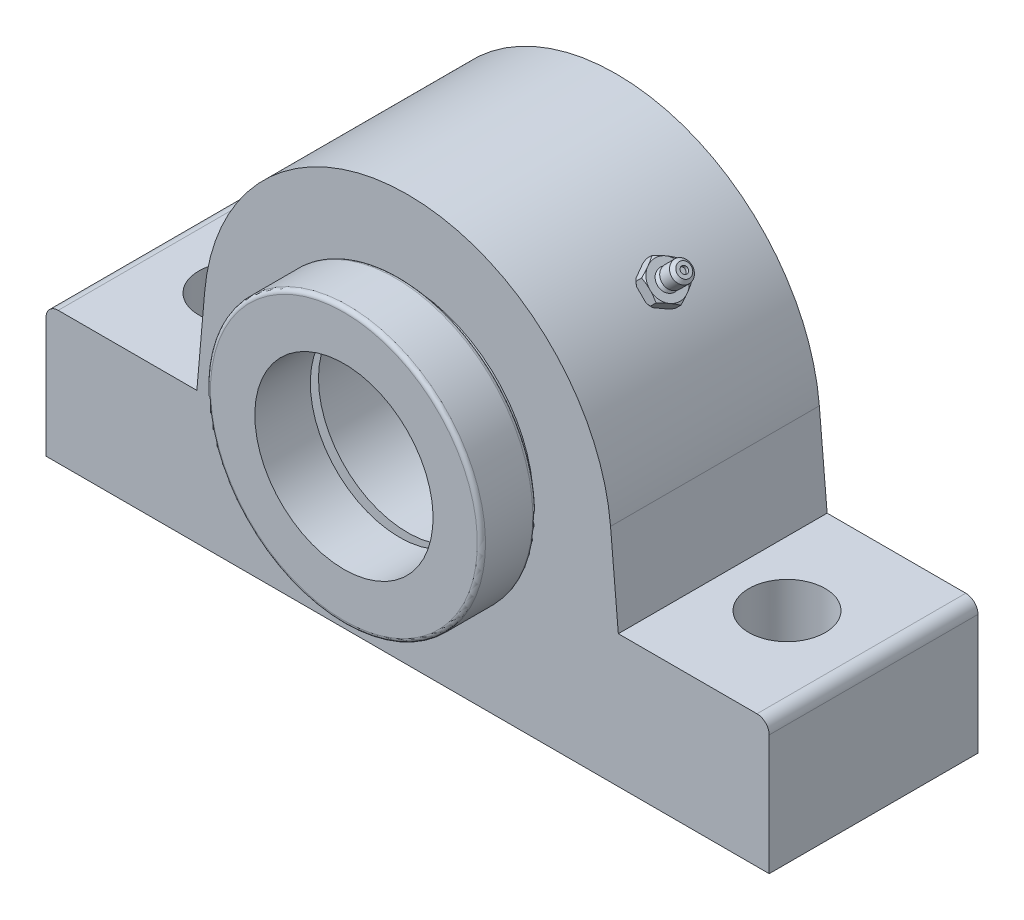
ISO-10303-21;
HEADER;
FILE_DESCRIPTION(('STEP AP214'),'2;1');
FILE_NAME('part.step','',(''),(''),'','','');
FILE_SCHEMA(('AUTOMOTIVE_DESIGN { 1 0 10303 214 1 1 1 1 }'));
ENDSEC;
DATA;
#1=APPLICATION_CONTEXT('core data for automotive mechanical design processes');
#2=APPLICATION_PROTOCOL_DEFINITION('international standard','automotive_design',2000,#1);
#3=PRODUCT_CONTEXT('',#1,'mechanical');
#4=PRODUCT('Part','Part','',(#3));
#5=PRODUCT_RELATED_PRODUCT_CATEGORY('part','',(#4));
#6=PRODUCT_DEFINITION_FORMATION('','',#4);
#7=PRODUCT_DEFINITION_CONTEXT('part definition',#1,'design');
#8=PRODUCT_DEFINITION('design','',#6,#7);
#9=PRODUCT_DEFINITION_SHAPE('','',#8);
#10=(LENGTH_UNIT() NAMED_UNIT(*) SI_UNIT(.MILLI.,.METRE.));
#11=(NAMED_UNIT(*) PLANE_ANGLE_UNIT() SI_UNIT($,.RADIAN.));
#12=(NAMED_UNIT(*) SI_UNIT($,.STERADIAN.) SOLID_ANGLE_UNIT());
#13=UNCERTAINTY_MEASURE_WITH_UNIT(LENGTH_MEASURE(1.E-05),#10,'distance_accuracy_value','');
#14=(GEOMETRIC_REPRESENTATION_CONTEXT(3) GLOBAL_UNCERTAINTY_ASSIGNED_CONTEXT((#13)) GLOBAL_UNIT_ASSIGNED_CONTEXT((#10,
#11,#12)) REPRESENTATION_CONTEXT('',''));
#15=CARTESIAN_POINT('',(0.,0.,0.));
#16=DIRECTION('',(0.,0.,1.));
#17=DIRECTION('',(1.,0.,0.));
#18=AXIS2_PLACEMENT_3D('',#15,#16,#17);
#19=CARTESIAN_POINT('',(0.,41.5925,35.08375));
#20=DIRECTION('',(0.,0.,0.999999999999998));
#21=DIRECTION('',(0.,-1.,0.));
#22=AXIS2_PLACEMENT_3D('',#19,#20,#21);
#23=PLANE('',#22);
#24=CARTESIAN_POINT('',(0.,0.,35.08375));
#25=DIRECTION('',(0.,0.,0.999999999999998));
#26=DIRECTION('',(0.,-1.,0.));
#27=AXIS2_PLACEMENT_3D('',#24,#25,#26);
#28=CIRCLE('',#27,41.5925);
#29=CARTESIAN_POINT('',(0.,-41.5925,35.08375));
#30=VERTEX_POINT('',#29);
#31=EDGE_CURVE('P0_E10',#30,#30,#28,.T.);
#32=ORIENTED_EDGE('',*,*,#31,.F.);
#33=EDGE_LOOP('',(#32));
#34=FACE_BOUND('',#33,.T.);
#35=CARTESIAN_POINT('',(0.,0.,35.08375));
#36=DIRECTION('',(0.,0.,0.999999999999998));
#37=DIRECTION('',(0.,-1.,0.));
#38=AXIS2_PLACEMENT_3D('',#35,#36,#37);
#39=CIRCLE('',#38,27.78125);
#40=CARTESIAN_POINT('',(0.,-27.78125,35.08375));
#41=VERTEX_POINT('',#40);
#42=EDGE_CURVE('P0_E37',#41,#41,#39,.T.);
#43=ORIENTED_EDGE('',*,*,#42,.T.);
#44=EDGE_LOOP('',(#43));
#45=FACE_BOUND('',#44,.T.);
#46=ADVANCED_FACE('P0_F15',(#34,#45),#23,.F.);
#47=CARTESIAN_POINT('',(0.,0.,36.35375));
#48=DIRECTION('',(0.,0.,0.999999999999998));
#49=DIRECTION('',(0.,-1.,0.));
#50=AXIS2_PLACEMENT_3D('',#47,#48,#49);
#51=TOROIDAL_SURFACE('',#50,41.5925,1.27);
#52=CARTESIAN_POINT('',(0.,0.,36.35375));
#53=DIRECTION('',(0.,0.,0.999999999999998));
#54=DIRECTION('',(0.,-1.,0.));
#55=AXIS2_PLACEMENT_3D('',#52,#53,#54);
#56=CIRCLE('',#55,42.8625);
#57=CARTESIAN_POINT('',(0.,-42.8625,36.3537499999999));
#58=VERTEX_POINT('',#57);
#59=EDGE_CURVE('P0_E21',#58,#58,#56,.T.);
#60=ORIENTED_EDGE('',*,*,#59,.F.);
#61=EDGE_LOOP('',(#60));
#62=FACE_BOUND('',#61,.T.);
#63=ORIENTED_EDGE('',*,*,#31,.T.);
#64=EDGE_LOOP('',(#63));
#65=FACE_BOUND('',#64,.T.);
#66=ADVANCED_FACE('P0_F62',(#62,#65),#51,.T.);
#67=CARTESIAN_POINT('',(0.,0.,52.3875));
#68=DIRECTION('',(0.,0.,0.999999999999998));
#69=DIRECTION('',(0.,-1.,0.));
#70=AXIS2_PLACEMENT_3D('',#67,#68,#69);
#71=CYLINDRICAL_SURFACE('',#70,42.8625);
#72=CARTESIAN_POINT('',(0.,0.,51.1175));
#73=DIRECTION('',(0.,0.,0.999999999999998));
#74=DIRECTION('',(0.,-1.,0.));
#75=AXIS2_PLACEMENT_3D('',#72,#73,#74);
#76=CIRCLE('',#75,42.8625);
#77=CARTESIAN_POINT('',(0.,-42.8625,51.1175));
#78=VERTEX_POINT('',#77);
#79=EDGE_CURVE('P0_E25',#78,#78,#76,.T.);
#80=CARTESIAN_POINT('',(0.,-42.8625,51.1175));
#81=CARTESIAN_POINT('',(0.,-42.8625,50.9637109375));
#82=CARTESIAN_POINT('',(0.,-42.8625,50.809921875));
#83=CARTESIAN_POINT('',(0.,-42.8625,50.50234375));
#84=CARTESIAN_POINT('',(0.,-42.8625,50.3485546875));
#85=CARTESIAN_POINT('',(0.,-42.8625,50.0409765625));
#86=CARTESIAN_POINT('',(0.,-42.8625,49.8871875));
#87=CARTESIAN_POINT('',(0.,-42.8625,49.579609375));
#88=CARTESIAN_POINT('',(0.,-42.8625,49.4258203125));
#89=CARTESIAN_POINT('',(0.,-42.8625,49.1182421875));
#90=CARTESIAN_POINT('',(0.,-42.8625,48.964453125));
#91=CARTESIAN_POINT('',(0.,-42.8625,48.656875));
#92=CARTESIAN_POINT('',(0.,-42.8625,48.5030859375));
#93=CARTESIAN_POINT('',(0.,-42.8625,48.1955078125));
#94=CARTESIAN_POINT('',(0.,-42.8625,48.04171875));
#95=CARTESIAN_POINT('',(0.,-42.8625,47.734140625));
#96=CARTESIAN_POINT('',(0.,-42.8625,47.5803515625));
#97=CARTESIAN_POINT('',(0.,-42.8625,47.2727734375));
#98=CARTESIAN_POINT('',(0.,-42.8625,47.118984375));
#99=CARTESIAN_POINT('',(0.,-42.8625,46.81140625));
#100=CARTESIAN_POINT('',(0.,-42.8625,46.6576171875));
#101=CARTESIAN_POINT('',(0.,-42.8625,46.3500390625));
#102=CARTESIAN_POINT('',(0.,-42.8625,46.19625));
#103=CARTESIAN_POINT('',(0.,-42.8625,45.888671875));
#104=CARTESIAN_POINT('',(0.,-42.8625,45.7348828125));
#105=CARTESIAN_POINT('',(0.,-42.8625,45.4273046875));
#106=CARTESIAN_POINT('',(0.,-42.8625,45.273515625));
#107=CARTESIAN_POINT('',(0.,-42.8625,44.9659375));
#108=CARTESIAN_POINT('',(0.,-42.8625,44.8121484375));
#109=CARTESIAN_POINT('',(0.,-42.8625,44.5045703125));
#110=CARTESIAN_POINT('',(0.,-42.8625,44.35078125));
#111=CARTESIAN_POINT('',(0.,-42.8625,44.043203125));
#112=CARTESIAN_POINT('',(0.,-42.8625,43.8894140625));
#113=CARTESIAN_POINT('',(0.,-42.8625,43.5818359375));
#114=CARTESIAN_POINT('',(0.,-42.8625,43.428046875));
#115=CARTESIAN_POINT('',(0.,-42.8625,43.12046875));
#116=CARTESIAN_POINT('',(0.,-42.8625,42.9666796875));
#117=CARTESIAN_POINT('',(0.,-42.8625,42.6591015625));
#118=CARTESIAN_POINT('',(0.,-42.8625,42.5053125));
#119=CARTESIAN_POINT('',(0.,-42.8625,42.197734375));
#120=CARTESIAN_POINT('',(0.,-42.8625,42.0439453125));
#121=CARTESIAN_POINT('',(0.,-42.8625,41.7363671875));
#122=CARTESIAN_POINT('',(0.,-42.8625,41.582578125));
#123=CARTESIAN_POINT('',(0.,-42.8625,41.275));
#124=CARTESIAN_POINT('',(0.,-42.8625,41.1212109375));
#125=CARTESIAN_POINT('',(0.,-42.8625,40.8136328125));
#126=CARTESIAN_POINT('',(0.,-42.8625,40.65984375));
#127=CARTESIAN_POINT('',(0.,-42.8625,40.352265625));
#128=CARTESIAN_POINT('',(0.,-42.8625,40.1984765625));
#129=CARTESIAN_POINT('',(0.,-42.8625,39.8908984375));
#130=CARTESIAN_POINT('',(0.,-42.8625,39.737109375));
#131=CARTESIAN_POINT('',(0.,-42.8625,39.42953125));
#132=CARTESIAN_POINT('',(0.,-42.8625,39.2757421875));
#133=CARTESIAN_POINT('',(0.,-42.8625,38.9681640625));
#134=CARTESIAN_POINT('',(0.,-42.8625,38.814375));
#135=CARTESIAN_POINT('',(0.,-42.8625,38.506796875));
#136=CARTESIAN_POINT('',(0.,-42.8625,38.3530078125));
#137=CARTESIAN_POINT('',(0.,-42.8625,38.0454296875));
#138=CARTESIAN_POINT('',(0.,-42.8625,37.891640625));
#139=CARTESIAN_POINT('',(0.,-42.8625,37.5840625));
#140=CARTESIAN_POINT('',(0.,-42.8625,37.4302734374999));
#141=CARTESIAN_POINT('',(0.,-42.8625,37.1226953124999));
#142=CARTESIAN_POINT('',(0.,-42.8625,36.9689062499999));
#143=CARTESIAN_POINT('',(0.,-42.8625,36.6613281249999));
#144=CARTESIAN_POINT('',(0.,-42.8625,36.5075390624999));
#145=CARTESIAN_POINT('',(0.,-42.8625,36.3537499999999));
#146=B_SPLINE_CURVE_WITH_KNOTS('',3,(#80,#81,#82,#83,#84,#85,#86,#87,#88,#89,#90,#91,#92,#93,
#94,#95,#96,#97,#98,#99,#100,#101,#102,#103,#104,#105,#106,#107,#108,#109,#110,#111,#112,#113,
#114,#115,#116,#117,#118,#119,#120,#121,#122,#123,#124,#125,#126,#127,#128,#129,#130,#131,#132,
#133,#134,#135,#136,#137,#138,#139,#140,#141,#142,#143,#144,#145),.UNSPECIFIED.,.F.,.F.,(4,2,2,
2,2,2,2,2,2,2,2,2,2,2,2,2,2,2,2,2,2,2,2,2,2,2,2,2,2,2,2,2,4),(0.,0.461367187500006,
0.922734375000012,1.38410156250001,1.84546875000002,2.30683593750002,2.76820312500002,
3.22957031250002,3.69093750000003,4.15230468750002,4.61367187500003,5.07503906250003,
5.53640625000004,5.99777343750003,6.45914062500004,6.92050781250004,7.38187500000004,
7.84324218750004,8.30460937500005,8.76597656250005,9.22734375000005,9.68871093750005,
10.1500781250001,10.6114453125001,11.0728125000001,11.5341796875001,11.9955468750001,
12.4569140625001,12.9182812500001,13.3796484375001,13.8410156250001,14.3023828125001,
14.7637500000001),.UNSPECIFIED.);
#147=EDGE_CURVE('P0_BSEAM57',#78,#58,#146,.T.);
#148=ORIENTED_EDGE('',*,*,#79,.F.);
#149=ORIENTED_EDGE('',*,*,#59,.T.);
#150=ORIENTED_EDGE('',*,*,#147,.T.);
#151=ORIENTED_EDGE('',*,*,#147,.F.);
#152=EDGE_LOOP('',(#148,#150,#149,#151));
#153=FACE_BOUND('',#152,.T.);
#154=ADVANCED_FACE('P0_F57',(#153),#71,.T.);
#155=CARTESIAN_POINT('',(0.,0.,51.1175));
#156=DIRECTION('',(0.,0.,0.999999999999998));
#157=DIRECTION('',(0.,-1.,0.));
#158=AXIS2_PLACEMENT_3D('',#155,#156,#157);
#159=TOROIDAL_SURFACE('',#158,41.5925,1.27);
#160=CARTESIAN_POINT('',(0.,0.,52.3875));
#161=DIRECTION('',(0.,0.,0.999999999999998));
#162=DIRECTION('',(0.,-1.,0.));
#163=AXIS2_PLACEMENT_3D('',#160,#161,#162);
#164=CIRCLE('',#163,41.5925);
#165=CARTESIAN_POINT('',(0.,-41.5925,52.3875));
#166=VERTEX_POINT('',#165);
#167=EDGE_CURVE('P0_E29',#166,#166,#164,.T.);
#168=ORIENTED_EDGE('',*,*,#167,.F.);
#169=EDGE_LOOP('',(#168));
#170=FACE_BOUND('',#169,.T.);
#171=ORIENTED_EDGE('',*,*,#79,.T.);
#172=EDGE_LOOP('',(#171));
#173=FACE_BOUND('',#172,.T.);
#174=ADVANCED_FACE('P0_F51',(#170,#173),#159,.T.);
#175=CARTESIAN_POINT('',(0.,41.5925,52.3875));
#176=DIRECTION('',(0.,0.,-0.999999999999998));
#177=DIRECTION('',(0.,1.,0.));
#178=AXIS2_PLACEMENT_3D('',#175,#176,#177);
#179=PLANE('',#178);
#180=CARTESIAN_POINT('',(0.,0.,52.3875));
#181=DIRECTION('',(0.,0.,0.999999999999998));
#182=DIRECTION('',(0.,-1.,0.));
#183=AXIS2_PLACEMENT_3D('',#180,#181,#182);
#184=CIRCLE('',#183,27.78125);
#185=CARTESIAN_POINT('',(0.,-27.78125,52.3875));
#186=VERTEX_POINT('',#185);
#187=EDGE_CURVE('P0_E34',#186,#186,#184,.T.);
#188=ORIENTED_EDGE('',*,*,#187,.F.);
#189=EDGE_LOOP('',(#188));
#190=FACE_BOUND('',#189,.T.);
#191=ORIENTED_EDGE('',*,*,#167,.T.);
#192=EDGE_LOOP('',(#191));
#193=FACE_BOUND('',#192,.T.);
#194=ADVANCED_FACE('P0_F45',(#190,#193),#179,.F.);
#195=CARTESIAN_POINT('',(0.,0.,52.3875));
#196=DIRECTION('',(0.,0.,0.999999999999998));
#197=DIRECTION('',(0.,-1.,0.));
#198=AXIS2_PLACEMENT_3D('',#195,#196,#197);
#199=CYLINDRICAL_SURFACE('',#198,27.78125);
#200=CARTESIAN_POINT('',(0.,-27.78125,35.08375));
#201=CARTESIAN_POINT('',(0.,-27.78125,35.2639973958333));
#202=CARTESIAN_POINT('',(0.,-27.78125,35.4442447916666));
#203=CARTESIAN_POINT('',(0.,-27.78125,35.8047395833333));
#204=CARTESIAN_POINT('',(0.,-27.78125,35.9849869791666));
#205=CARTESIAN_POINT('',(0.,-27.78125,36.3454817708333));
#206=CARTESIAN_POINT('',(0.,-27.78125,36.5257291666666));
#207=CARTESIAN_POINT('',(0.,-27.78125,36.8862239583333));
#208=CARTESIAN_POINT('',(0.,-27.78125,37.0664713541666));
#209=CARTESIAN_POINT('',(0.,-27.78125,37.4269661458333));
#210=CARTESIAN_POINT('',(0.,-27.78125,37.6072135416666));
#211=CARTESIAN_POINT('',(0.,-27.78125,37.9677083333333));
#212=CARTESIAN_POINT('',(0.,-27.78125,38.1479557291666));
#213=CARTESIAN_POINT('',(0.,-27.78125,38.5084505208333));
#214=CARTESIAN_POINT('',(0.,-27.78125,38.6886979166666));
#215=CARTESIAN_POINT('',(0.,-27.78125,39.0491927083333));
#216=CARTESIAN_POINT('',(0.,-27.78125,39.2294401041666));
#217=CARTESIAN_POINT('',(0.,-27.78125,39.5899348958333));
#218=CARTESIAN_POINT('',(0.,-27.78125,39.7701822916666));
#219=CARTESIAN_POINT('',(0.,-27.78125,40.1306770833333));
#220=CARTESIAN_POINT('',(0.,-27.78125,40.3109244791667));
#221=CARTESIAN_POINT('',(0.,-27.78125,40.6714192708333));
#222=CARTESIAN_POINT('',(0.,-27.78125,40.8516666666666));
#223=CARTESIAN_POINT('',(0.,-27.78125,41.2121614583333));
#224=CARTESIAN_POINT('',(0.,-27.78125,41.3924088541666));
#225=CARTESIAN_POINT('',(0.,-27.78125,41.7529036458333));
#226=CARTESIAN_POINT('',(0.,-27.78125,41.9331510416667));
#227=CARTESIAN_POINT('',(0.,-27.78125,42.2936458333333));
#228=CARTESIAN_POINT('',(0.,-27.78125,42.4738932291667));
#229=CARTESIAN_POINT('',(0.,-27.78125,42.8343880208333));
#230=CARTESIAN_POINT('',(0.,-27.78125,43.0146354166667));
#231=CARTESIAN_POINT('',(0.,-27.78125,43.3751302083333));
#232=CARTESIAN_POINT('',(0.,-27.78125,43.5553776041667));
#233=CARTESIAN_POINT('',(0.,-27.78125,43.9158723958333));
#234=CARTESIAN_POINT('',(0.,-27.78125,44.0961197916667));
#235=CARTESIAN_POINT('',(0.,-27.78125,44.4566145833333));
#236=CARTESIAN_POINT('',(0.,-27.78125,44.6368619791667));
#237=CARTESIAN_POINT('',(0.,-27.78125,44.9973567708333));
#238=CARTESIAN_POINT('',(0.,-27.78125,45.1776041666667));
#239=CARTESIAN_POINT('',(0.,-27.78125,45.5380989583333));
#240=CARTESIAN_POINT('',(0.,-27.78125,45.7183463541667));
#241=CARTESIAN_POINT('',(0.,-27.78125,46.0788411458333));
#242=CARTESIAN_POINT('',(0.,-27.78125,46.2590885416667));
#243=CARTESIAN_POINT('',(0.,-27.78125,46.6195833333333));
#244=CARTESIAN_POINT('',(0.,-27.78125,46.7998307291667));
#245=CARTESIAN_POINT('',(0.,-27.78125,47.1603255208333));
#246=CARTESIAN_POINT('',(0.,-27.78125,47.3405729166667));
#247=CARTESIAN_POINT('',(0.,-27.78125,47.7010677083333));
#248=CARTESIAN_POINT('',(0.,-27.78125,47.8813151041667));
#249=CARTESIAN_POINT('',(0.,-27.78125,48.2418098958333));
#250=CARTESIAN_POINT('',(0.,-27.78125,48.4220572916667));
#251=CARTESIAN_POINT('',(0.,-27.78125,48.7825520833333));
#252=CARTESIAN_POINT('',(0.,-27.78125,48.9627994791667));
#253=CARTESIAN_POINT('',(0.,-27.78125,49.3232942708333));
#254=CARTESIAN_POINT('',(0.,-27.78125,49.5035416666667));
#255=CARTESIAN_POINT('',(0.,-27.78125,49.8640364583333));
#256=CARTESIAN_POINT('',(0.,-27.78125,50.0442838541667));
#257=CARTESIAN_POINT('',(0.,-27.78125,50.4047786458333));
#258=CARTESIAN_POINT('',(0.,-27.78125,50.5850260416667));
#259=CARTESIAN_POINT('',(0.,-27.78125,50.9455208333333));
#260=CARTESIAN_POINT('',(0.,-27.78125,51.1257682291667));
#261=CARTESIAN_POINT('',(0.,-27.78125,51.4862630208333));
#262=CARTESIAN_POINT('',(0.,-27.78125,51.6665104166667));
#263=CARTESIAN_POINT('',(0.,-27.78125,52.0270052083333));
#264=CARTESIAN_POINT('',(0.,-27.78125,52.2072526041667));
#265=CARTESIAN_POINT('',(0.,-27.78125,52.3875));
#266=B_SPLINE_CURVE_WITH_KNOTS('',3,(#200,#201,#202,#203,#204,#205,#206,#207,#208,#209,#210,
#211,#212,#213,#214,#215,#216,#217,#218,#219,#220,#221,#222,#223,#224,#225,#226,#227,#228,#229,
#230,#231,#232,#233,#234,#235,#236,#237,#238,#239,#240,#241,#242,#243,#244,#245,#246,#247,#248,
#249,#250,#251,#252,#253,#254,#255,#256,#257,#258,#259,#260,#261,#262,#263,#264,#265),
.UNSPECIFIED.,.F.,.F.,(4,2,2,2,2,2,2,2,2,2,2,2,2,2,2,2,2,2,2,2,2,2,2,2,2,2,2,2,2,2,2,2,4),(0.,
0.540742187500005,1.08148437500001,1.62222656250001,2.16296875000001,2.70371093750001,
3.24445312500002,3.78519531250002,4.32593750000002,4.86667968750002,5.40742187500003,
5.94816406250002,6.48890625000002,7.02964843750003,7.57039062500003,8.11113281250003,
8.65187500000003,9.19261718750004,9.73335937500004,10.2741015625,10.81484375,11.3555859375,
11.896328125,12.4370703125,12.9778125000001,13.5185546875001,14.0592968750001,14.6000390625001,
15.1407812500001,15.6815234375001,16.2222656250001,16.7630078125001,17.3037500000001),.UNSPECIFIED.);
#267=EDGE_CURVE('P0_BSEAM42',#41,#186,#266,.T.);
#268=ORIENTED_EDGE('',*,*,#42,.F.);
#269=ORIENTED_EDGE('',*,*,#187,.T.);
#270=ORIENTED_EDGE('',*,*,#267,.T.);
#271=ORIENTED_EDGE('',*,*,#267,.F.);
#272=EDGE_LOOP('',(#268,#270,#269,#271));
#273=FACE_BOUND('',#272,.T.);
#274=ADVANCED_FACE('P0_F42',(#273),#199,.F.);
#275=CLOSED_SHELL('',(#46,#66,#154,#174,#194,#274));
#276=MANIFOLD_SOLID_BREP('P0_B1',#275);
#277=CARTESIAN_POINT('',(41.3091781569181,50.2894342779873,0.));
#278=DIRECTION('',(0.707106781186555,0.70710678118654,0.));
#279=DIRECTION('',(-0.70710678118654,0.707106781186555,0.));
#280=AXIS2_PLACEMENT_3D('',#277,#278,#279);
#281=PLANE('',#280);
#282=CARTESIAN_POINT('',(45.7993062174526,45.7993062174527,0.));
#283=DIRECTION('',(-0.707106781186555,-0.70710678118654,0.));
#284=DIRECTION('',(0.70710678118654,-0.707106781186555,0.));
#285=AXIS2_PLACEMENT_3D('',#282,#283,#284);
#286=CIRCLE('',#285,3.17499999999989);
#287=CARTESIAN_POINT('',(48.0443702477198,43.5542421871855,0.));
#288=VERTEX_POINT('',#287);
#289=EDGE_CURVE('P1_E1237',#288,#288,#286,.T.);
#290=ORIENTED_EDGE('',*,*,#289,.F.);
#291=EDGE_LOOP('',(#290));
#292=FACE_BOUND('',#291,.T.);
#293=DIRECTION('',(-0.353553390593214,0.353553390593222,-0.866025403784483));
#294=VECTOR('',#293,1.);
#295=CARTESIAN_POINT('',(41.3091781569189,50.2894342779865,-4.44089209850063E-13));
#296=LINE('',#295,#294);
#297=CARTESIAN_POINT('',(43.1535865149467,48.4450259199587,4.51785935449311));
#298=VERTEX_POINT('',#297);
#299=CARTESIAN_POINT('',(41.7098338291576,49.8887786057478,0.981401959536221));
#300=VERTEX_POINT('',#299);
#301=EDGE_CURVE('P1_E1181',#298,#300,#296,.T.);
#302=ORIENTED_EDGE('',*,*,#301,.T.);
#303=CARTESIAN_POINT('',(45.7993062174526,45.7993062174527,0.));
#304=DIRECTION('',(0.707106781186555,0.70710678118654,0.));
#305=DIRECTION('',(-0.70710678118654,0.707106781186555,0.));
#306=AXIS2_PLACEMENT_3D('',#303,#304,#305);
#307=CIRCLE('',#306,5.86606500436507);
#308=CARTESIAN_POINT('',(41.7098338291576,49.8887786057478,-0.981401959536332));
#309=VERTEX_POINT('',#308);
#310=EDGE_CURVE('P1_E271',#300,#309,#307,.F.);
#311=ORIENTED_EDGE('',*,*,#310,.T.);
#312=DIRECTION('',(0.353553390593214,-0.353553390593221,-0.866025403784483));
#313=VECTOR('',#312,1.);
#314=CARTESIAN_POINT('',(43.5542421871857,48.0443702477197,-5.49926131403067));
#315=LINE('',#314,#313);
#316=CARTESIAN_POINT('',(43.1535865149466,48.4450259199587,-4.517859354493));
#317=VERTEX_POINT('',#316);
#318=EDGE_CURVE('P1_E252',#309,#317,#315,.T.);
#319=ORIENTED_EDGE('',*,*,#318,.T.);
#320=CARTESIAN_POINT('',(44.3555535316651,47.2430589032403,-5.49926131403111));
#321=VERTEX_POINT('',#320);
#322=EDGE_CURVE('P1_E396',#317,#321,#307,.F.);
#323=ORIENTED_EDGE('',*,*,#322,.T.);
#324=DIRECTION('',(0.70710678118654,-0.707106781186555,0.));
#325=VECTOR('',#324,1.);
#326=CARTESIAN_POINT('',(48.0443702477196,43.5542421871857,-5.49926131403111));
#327=LINE('',#326,#325);
#328=CARTESIAN_POINT('',(47.2430589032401,44.3555535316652,-5.49926131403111));
#329=VERTEX_POINT('',#328);
#330=EDGE_CURVE('P1_E1178',#321,#329,#327,.T.);
#331=ORIENTED_EDGE('',*,*,#330,.T.);
#332=CARTESIAN_POINT('',(48.4450259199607,43.1535865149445,-4.51785935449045));
#333=VERTEX_POINT('',#332);
#334=EDGE_CURVE('P1_E401',#329,#333,#307,.F.);
#335=ORIENTED_EDGE('',*,*,#334,.T.);
#336=DIRECTION('',(0.353553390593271,-0.353553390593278,0.866025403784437));
#337=VECTOR('',#336,1.);
#338=CARTESIAN_POINT('',(50.2894342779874,41.3091781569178,-4.44089209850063E-13));
#339=LINE('',#338,#337);
#340=CARTESIAN_POINT('',(49.8887786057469,41.7098338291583,-0.981401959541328));
#341=VERTEX_POINT('',#340);
#342=EDGE_CURVE('P1_E1173',#333,#341,#339,.T.);
#343=ORIENTED_EDGE('',*,*,#342,.T.);
#344=CARTESIAN_POINT('',(49.8887786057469,41.7098338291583,0.981401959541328));
#345=VERTEX_POINT('',#344);
#346=EDGE_CURVE('P1_E406',#341,#345,#307,.F.);
#347=ORIENTED_EDGE('',*,*,#346,.T.);
#348=DIRECTION('',(-0.35355339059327,0.353553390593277,0.866025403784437));
#349=VECTOR('',#348,1.);
#350=CARTESIAN_POINT('',(48.0443702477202,43.5542421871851,5.49926131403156));
#351=LINE('',#350,#349);
#352=CARTESIAN_POINT('',(48.4450259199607,43.1535865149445,4.51785935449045));
#353=VERTEX_POINT('',#352);
#354=EDGE_CURVE('P1_E1168',#345,#353,#351,.T.);
#355=ORIENTED_EDGE('',*,*,#354,.T.);
#356=CARTESIAN_POINT('',(47.2430589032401,44.3555535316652,5.49926131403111));
#357=VERTEX_POINT('',#356);
#358=EDGE_CURVE('P1_E411',#353,#357,#307,.F.);
#359=ORIENTED_EDGE('',*,*,#358,.T.);
#360=DIRECTION('',(-0.70710678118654,0.707106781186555,0.));
#361=VECTOR('',#360,1.);
#362=CARTESIAN_POINT('',(43.5542421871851,48.0443702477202,5.49926131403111));
#363=LINE('',#362,#361);
#364=CARTESIAN_POINT('',(44.3555535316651,47.2430589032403,5.49926131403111));
#365=VERTEX_POINT('',#364);
#366=EDGE_CURVE('P1_E1166',#357,#365,#363,.T.);
#367=ORIENTED_EDGE('',*,*,#366,.T.);
#368=EDGE_CURVE('P1_E408',#365,#298,#307,.F.);
#369=ORIENTED_EDGE('',*,*,#368,.T.);
#370=EDGE_LOOP('',(#302,#311,#319,#323,#331,#335,#343,#347,#355,#359,#367,#369));
#371=FACE_BOUND('',#370,.T.);
#372=ADVANCED_FACE('P1_F17',(#292,#371),#281,.F.);
#373=CARTESIAN_POINT('',(45.7993062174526,45.7993062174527,0.));
#374=DIRECTION('',(0.707106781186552,0.707106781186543,0.));
#375=DIRECTION('',(-0.707106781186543,0.707106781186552,0.));
#376=AXIS2_PLACEMENT_3D('',#373,#374,#375);
#377=CONICAL_SURFACE('',#376,5.86606500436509,0.523598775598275);
#378=CARTESIAN_POINT('',(54.3627715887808,44.5516542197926,5.49926131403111));
#379=CARTESIAN_POINT('',(54.2157782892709,44.5293743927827,5.49926131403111));
#380=CARTESIAN_POINT('',(54.0687073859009,44.5076068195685,5.49926131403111));
#381=CARTESIAN_POINT('',(53.7743975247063,44.4652162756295,5.49926131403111));
#382=CARTESIAN_POINT('',(53.6271585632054,44.4445933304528,5.49926131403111));
#383=CARTESIAN_POINT('',(53.1849968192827,44.384598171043,5.49926131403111));
#384=CARTESIAN_POINT('',(52.8898120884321,44.3471276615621,5.49926131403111));
#385=CARTESIAN_POINT('',(52.2906105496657,44.2775846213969,5.49926131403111));
#386=CARTESIAN_POINT('',(51.986573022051,44.2456877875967,5.49926131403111));
#387=CARTESIAN_POINT('',(51.3778117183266,44.1905118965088,5.49926131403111));
#388=CARTESIAN_POINT('',(51.0730882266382,44.1672297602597,5.49926131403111));
#389=CARTESIAN_POINT('',(50.4623771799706,44.1319590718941,5.49926131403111));
#390=CARTESIAN_POINT('',(50.156388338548,44.1199908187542,5.49926131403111));
#391=CARTESIAN_POINT('',(49.6970540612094,44.1136838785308,5.49926131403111));
#392=CARTESIAN_POINT('',(49.5437880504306,44.1135260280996,5.49926131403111));
#393=CARTESIAN_POINT('',(49.2373266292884,44.117836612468,5.49926131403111));
#394=CARTESIAN_POINT('',(49.0841312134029,44.1223045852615,5.49926131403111));
#395=CARTESIAN_POINT('',(48.779548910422,44.1366722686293,5.49926131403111));
#396=CARTESIAN_POINT('',(48.6281594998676,44.1465161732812,5.49926131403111));
#397=CARTESIAN_POINT('',(48.3258957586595,44.1726769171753,5.49926131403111));
#398=CARTESIAN_POINT('',(48.1750215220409,44.1889948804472,5.49926131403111));
#399=CARTESIAN_POINT('',(47.8746247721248,44.2294001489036,5.49926131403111));
#400=CARTESIAN_POINT('',(47.7251000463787,44.2534706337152,5.49926131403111));
#401=CARTESIAN_POINT('',(47.427898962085,44.3110194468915,5.49926131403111));
#402=CARTESIAN_POINT('',(47.2802216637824,44.3444927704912,5.49926131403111));
#403=CARTESIAN_POINT('',(47.0273747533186,44.4122164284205,5.49926131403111));
#404=CARTESIAN_POINT('',(46.9214977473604,44.4438147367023,5.49926131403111));
#405=CARTESIAN_POINT('',(46.7120021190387,44.5139014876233,5.49926131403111));
#406=CARTESIAN_POINT('',(46.6083838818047,44.5523910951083,5.49926131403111));
#407=CARTESIAN_POINT('',(46.4046013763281,44.6369620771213,5.49926131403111));
#408=CARTESIAN_POINT('',(46.3044282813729,44.6830219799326,5.49926131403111));
#409=CARTESIAN_POINT('',(46.1083710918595,44.783495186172,5.49926131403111));
#410=CARTESIAN_POINT('',(46.012485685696,44.8379059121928,5.49926131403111));
#411=CARTESIAN_POINT('',(45.8166142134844,44.9616202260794,5.49926131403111));
#412=CARTESIAN_POINT('',(45.7172272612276,45.0318815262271,5.49926131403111));
#413=CARTESIAN_POINT('',(45.5269252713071,45.1831323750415,5.49926131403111));
#414=CARTESIAN_POINT('',(45.4360111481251,45.2641230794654,5.49926131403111));
#415=CARTESIAN_POINT('',(45.2738641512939,45.4262631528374,5.49926131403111));
#416=CARTESIAN_POINT('',(45.2015685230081,45.5063533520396,5.49926131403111));
#417=CARTESIAN_POINT('',(45.065315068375,45.6733802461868,5.49926131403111));
#418=CARTESIAN_POINT('',(45.0013607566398,45.7603198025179,5.49926131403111));
#419=CARTESIAN_POINT('',(44.8818288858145,45.9399677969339,5.49926131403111));
#420=CARTESIAN_POINT('',(44.8262660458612,46.032685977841,5.49926131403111));
#421=CARTESIAN_POINT('',(44.723305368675,46.2225663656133,5.49926131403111));
#422=CARTESIAN_POINT('',(44.6759112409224,46.3197305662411,5.49926131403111));
#423=CARTESIAN_POINT('',(44.5706186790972,46.5583734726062,5.49926131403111));
#424=CARTESIAN_POINT('',(44.5165119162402,46.7015230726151,5.49926131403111));
#425=CARTESIAN_POINT('',(44.4213080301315,46.9920715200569,5.49926131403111));
#426=CARTESIAN_POINT('',(44.3802190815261,47.13947297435,5.49926131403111));
#427=CARTESIAN_POINT('',(44.3085388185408,47.4383467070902,5.49926131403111));
#428=CARTESIAN_POINT('',(44.2780586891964,47.5898451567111,5.49926131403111));
#429=CARTESIAN_POINT('',(44.2262495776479,47.8942913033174,5.49926131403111));
#430=CARTESIAN_POINT('',(44.2049169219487,48.0472383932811,5.49926131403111));
#431=CARTESIAN_POINT('',(44.1567751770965,48.4669248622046,5.49926131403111));
#432=CARTESIAN_POINT('',(44.1375018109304,48.7345191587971,5.49926131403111));
#433=CARTESIAN_POINT('',(44.1152087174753,49.2704408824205,5.49926131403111));
#434=CARTESIAN_POINT('',(44.1122017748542,49.5387687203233,5.49926131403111));
#435=CARTESIAN_POINT('',(44.1182993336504,50.0763028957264,5.49926131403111));
#436=CARTESIAN_POINT('',(44.1274514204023,50.3455085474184,5.49926131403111));
#437=CARTESIAN_POINT('',(44.1550225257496,50.8833297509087,5.49926131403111));
#438=CARTESIAN_POINT('',(44.1734386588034,51.1519454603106,5.49926131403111));
#439=CARTESIAN_POINT('',(44.2157686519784,51.6675812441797,5.49926131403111));
#440=CARTESIAN_POINT('',(44.2391398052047,51.9146470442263,5.49926131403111));
#441=CARTESIAN_POINT('',(44.2908530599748,52.4082766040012,5.49926131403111));
#442=CARTESIAN_POINT('',(44.3191956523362,52.6548403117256,5.49926131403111));
#443=CARTESIAN_POINT('',(44.3796820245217,53.1452570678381,5.49926131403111));
#444=CARTESIAN_POINT('',(44.4117895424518,53.3891146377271,5.49926131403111));
#445=CARTESIAN_POINT('',(44.4793619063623,53.8763105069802,5.49926131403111));
#446=CARTESIAN_POINT('',(44.5148260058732,54.1196489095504,5.49926131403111));
#447=CARTESIAN_POINT('',(44.551654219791,54.3627715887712,5.49926131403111));
#448=B_SPLINE_CURVE_WITH_KNOTS('',3,(#378,#379,#380,#381,#382,#383,#384,#385,#386,#387,#388,
#389,#390,#391,#392,#393,#394,#395,#396,#397,#398,#399,#400,#401,#402,#403,#404,#405,#406,#407,
#408,#409,#410,#411,#412,#413,#414,#415,#416,#417,#418,#419,#420,#421,#422,#423,#424,#425,#426,
#427,#428,#429,#430,#431,#432,#433,#434,#435,#436,#437,#438,#439,#440,#441,#442,#443,#444,#445,
#446,#447),.UNSPECIFIED.,.F.,.F.,(4,2,2,2,2,2,2,2,2,2,2,2,2,2,2,2,2,2,2,2,2,2,2,2,2,2,2,2,2,2,2,
2,2,2,4),(0.,0.446015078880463,0.892040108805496,1.7846452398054,2.70166712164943,
3.6183609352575,4.53669634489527,4.99644017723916,5.45613809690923,5.91115231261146,
6.36624556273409,6.82035799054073,7.2742291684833,7.60550631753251,7.93683951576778,
8.26724867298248,8.59755605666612,8.96197429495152,9.32643181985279,9.6495663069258,
9.97283650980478,10.296667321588,10.6206448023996,11.078943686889,11.5375297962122,
12.000786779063,12.4638575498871,13.2679370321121,14.0726483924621,14.8805183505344,
15.6881368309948,16.4325835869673,17.177103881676,17.914965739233,18.6526638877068),.UNSPECIFIED.);
#449=CARTESIAN_POINT('',(44.1469390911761,48.6370671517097,5.49926131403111));
#450=VERTEX_POINT('',#449);
#451=EDGE_CURVE('P1_E278',#365,#450,#448,.T.);
#452=ORIENTED_EDGE('',*,*,#451,.T.);
#453=CARTESIAN_POINT('',(44.1471621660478,48.6371269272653,5.49946131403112));
#454=CARTESIAN_POINT('',(44.0830112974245,48.619939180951,5.44194347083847));
#455=CARTESIAN_POINT('',(44.0191685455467,48.6035281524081,5.38385171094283));
#456=CARTESIAN_POINT('',(43.8921989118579,48.5724623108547,5.26639403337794));
#457=CARTESIAN_POINT('',(43.829072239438,48.5578080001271,5.20702775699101));
#458=CARTESIAN_POINT('',(43.6403319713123,48.5166593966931,5.02626562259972));
#459=CARTESIAN_POINT('',(43.5160141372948,48.4931588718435,4.90279014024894));
#460=CARTESIAN_POINT('',(43.2692049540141,48.4558325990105,4.6462270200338));
#461=CARTESIAN_POINT('',(43.1468437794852,48.4422724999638,4.51297346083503));
#462=CARTESIAN_POINT('',(42.9100064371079,48.4289313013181,4.23924770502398));
#463=CARTESIAN_POINT('',(42.7955132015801,48.4291193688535,4.09879236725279));
#464=CARTESIAN_POINT('',(42.6274113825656,48.4427797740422,3.87618001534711));
#465=CARTESIAN_POINT('',(42.5698368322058,48.4501584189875,3.7966289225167));
#466=CARTESIAN_POINT('',(42.458701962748,48.4706311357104,3.63544320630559));
#467=CARTESIAN_POINT('',(42.4051419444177,48.4837256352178,3.5538084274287));
#468=CARTESIAN_POINT('',(42.3032072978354,48.5160058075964,3.38942951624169));
#469=CARTESIAN_POINT('',(42.2547949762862,48.5351424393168,3.30669928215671));
#470=CARTESIAN_POINT('',(42.1634039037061,48.5798658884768,3.13999371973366));
#471=CARTESIAN_POINT('',(42.120424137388,48.6054514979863,3.05601862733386));
#472=CARTESIAN_POINT('',(42.0401282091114,48.6634344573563,2.88666226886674));
#473=CARTESIAN_POINT('',(42.0028678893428,48.6958924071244,2.80127517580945));
#474=CARTESIAN_POINT('',(41.9348976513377,48.7672773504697,2.63060063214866));
#475=CARTESIAN_POINT('',(41.9041877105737,48.8062043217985,2.54531318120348));
#476=CARTESIAN_POINT('',(41.8493771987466,48.89014715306,2.37537573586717));
#477=CARTESIAN_POINT('',(41.8252911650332,48.9351760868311,2.2907275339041));
#478=CARTESIAN_POINT('',(41.7836342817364,49.0306098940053,2.12282641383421));
#479=CARTESIAN_POINT('',(41.7660673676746,49.0810179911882,2.03957436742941));
#480=CARTESIAN_POINT('',(41.7328857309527,49.2016489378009,1.85119319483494));
#481=CARTESIAN_POINT('',(41.719296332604,49.2733927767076,1.74668175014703));
#482=CARTESIAN_POINT('',(41.7011246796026,49.4229458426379,1.54126176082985));
#483=CARTESIAN_POINT('',(41.6965480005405,49.5007587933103,1.44035548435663));
#484=CARTESIAN_POINT('',(41.6951138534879,49.6613626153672,1.24190031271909));
#485=CARTESIAN_POINT('',(41.698287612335,49.7441723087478,1.14436661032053));
#486=CARTESIAN_POINT('',(41.7111927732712,49.9133536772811,0.952968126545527));
#487=CARTESIAN_POINT('',(41.7209230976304,49.9997247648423,0.859102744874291));
#488=CARTESIAN_POINT('',(41.751669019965,50.2160637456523,0.631798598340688));
#489=CARTESIAN_POINT('',(41.7758297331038,50.3476054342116,0.500284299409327));
#490=CARTESIAN_POINT('',(41.8187033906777,50.5471161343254,0.308443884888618));
#491=CARTESIAN_POINT('',(41.8339952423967,50.6136040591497,0.245741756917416));
#492=CARTESIAN_POINT('',(41.8665466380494,50.7473902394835,0.121754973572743));
#493=CARTESIAN_POINT('',(41.8838057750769,50.8146883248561,0.0604700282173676));
#494=CARTESIAN_POINT('',(41.9019286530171,50.8823311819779,-0.000179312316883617));
#495=B_SPLINE_CURVE_WITH_KNOTS('',3,(#453,#454,#455,#456,#457,#458,#459,#460,#461,#462,#463,
#464,#465,#466,#467,#468,#469,#470,#471,#472,#473,#474,#475,#476,#477,#478,#479,#480,#481,#482,
#483,#484,#485,#486,#487,#488,#489,#490,#491,#492,#493,#494),.UNSPECIFIED.,.F.,.F.,(4,2,2,2,2,2,
2,2,2,2,2,2,2,2,2,2,2,2,2,2,4),(0.,0.263562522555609,0.527200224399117,1.05716079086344,
1.60081365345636,2.14324730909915,2.43845378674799,2.73368235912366,3.0265737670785,
3.31941035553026,3.6149455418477,3.91047971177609,4.2066574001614,4.50301359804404,
4.88486814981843,5.2669588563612,5.65059156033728,6.03416122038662,6.59633198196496,
6.87429145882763,7.15219354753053),.UNSPECIFIED.);
#496=EDGE_CURVE('P1_E272',#450,#298,#495,.T.);
#497=ORIENTED_EDGE('',*,*,#496,.T.);
#498=ORIENTED_EDGE('',*,*,#368,.F.);
#499=EDGE_LOOP('',(#452,#497,#498));
#500=FACE_BOUND('',#499,.T.);
#501=ADVANCED_FACE('P1_F290',(#500),#377,.T.);
#502=CARTESIAN_POINT('',(50.8823311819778,41.9019286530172,-0.000179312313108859));
#503=CARTESIAN_POINT('',(50.8181804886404,41.8847411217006,0.0573385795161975));
#504=CARTESIAN_POINT('',(50.7543379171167,41.8683303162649,0.11543039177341));
#505=CARTESIAN_POINT('',(50.6273686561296,41.8372649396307,0.232888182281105));
#506=CARTESIAN_POINT('',(50.564242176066,41.8226108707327,0.292254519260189));
#507=CARTESIAN_POINT('',(50.3755024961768,41.7814630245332,0.473016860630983));
#508=CARTESIAN_POINT('',(50.2511850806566,41.7579630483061,0.596492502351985));
#509=CARTESIAN_POINT('',(50.0043768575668,41.7206380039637,0.853055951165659));
#510=CARTESIAN_POINT('',(49.882016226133,41.7070785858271,0.986309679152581));
#511=CARTESIAN_POINT('',(49.6451801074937,41.693738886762,1.26003577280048));
#512=CARTESIAN_POINT('',(49.530687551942,41.6939277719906,1.40049127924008));
#513=CARTESIAN_POINT('',(49.3625869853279,41.707589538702,1.6231037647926));
#514=CARTESIAN_POINT('',(49.3050129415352,41.7149686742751,1.70265483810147));
#515=CARTESIAN_POINT('',(49.1938791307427,41.7354423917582,1.86384048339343));
#516=CARTESIAN_POINT('',(49.1403196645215,41.74853740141,1.94547521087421));
#517=CARTESIAN_POINT('',(49.0383861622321,41.7808185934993,2.10985396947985));
#518=CARTESIAN_POINT('',(48.9899744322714,41.7999557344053,2.19258410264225));
#519=CARTESIAN_POINT('',(48.8985845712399,41.8446801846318,2.35928940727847));
#520=CARTESIAN_POINT('',(48.8556054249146,41.8702662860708,2.44326434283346));
#521=CARTESIAN_POINT('',(48.7753107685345,41.9282501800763,2.61262028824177));
#522=CARTESIAN_POINT('',(48.7380510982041,41.9607085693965,2.69800712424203));
#523=CARTESIAN_POINT('',(48.6700821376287,42.0320943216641,2.86868109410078));
#524=CARTESIAN_POINT('',(48.6393728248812,42.0710216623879,2.95396822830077));
#525=CARTESIAN_POINT('',(48.5845635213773,42.1549651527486,3.12390500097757));
#526=CARTESIAN_POINT('',(48.5604780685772,42.1999943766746,3.20855284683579));
#527=CARTESIAN_POINT('',(48.5188222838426,42.2954286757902,3.37645322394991));
#528=CARTESIAN_POINT('',(48.5012558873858,42.3458369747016,3.45970488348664));
#529=CARTESIAN_POINT('',(48.4680751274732,42.4664691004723,3.64808642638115));
#530=CARTESIAN_POINT('',(48.4544861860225,42.538213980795,3.75259858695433));
#531=CARTESIAN_POINT('',(48.4363155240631,42.6877691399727,3.95801992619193));
#532=CARTESIAN_POINT('',(48.431739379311,42.7655831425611,4.0589268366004));
#533=CARTESIAN_POINT('',(48.4303063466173,42.9261890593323,4.25738320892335));
#534=CARTESIAN_POINT('',(48.4334806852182,43.0089997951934,4.35491747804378));
#535=CARTESIAN_POINT('',(48.4463870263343,43.1781832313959,4.5463170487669));
#536=CARTESIAN_POINT('',(48.4561179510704,43.2645553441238,4.64018295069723));
#537=CARTESIAN_POINT('',(48.4868651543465,43.4808953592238,4.86748679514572));
#538=CARTESIAN_POINT('',(48.5110264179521,43.6124369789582,4.99900033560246));
#539=CARTESIAN_POINT('',(48.5539007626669,43.8119475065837,5.19083969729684));
#540=CARTESIAN_POINT('',(48.5691928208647,43.8784353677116,5.25354149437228));
#541=CARTESIAN_POINT('',(48.6017445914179,44.0122214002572,5.37752763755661));
#542=CARTESIAN_POINT('',(48.6190038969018,44.0795194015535,5.43881227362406));
#543=CARTESIAN_POINT('',(48.6371269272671,44.1471621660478,5.49946131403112));
#544=B_SPLINE_CURVE_WITH_KNOTS('',3,(#502,#503,#504,#505,#506,#507,#508,#509,#510,#511,#512,
#513,#514,#515,#516,#517,#518,#519,#520,#521,#522,#523,#524,#525,#526,#527,#528,#529,#530,#531,
#532,#533,#534,#535,#536,#537,#538,#539,#540,#541,#542,#543),.UNSPECIFIED.,.F.,.F.,(4,2,2,2,2,2,
2,2,2,2,2,2,2,2,2,2,2,2,2,2,4),(0.,0.263562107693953,0.527199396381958,1.05715918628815,
1.60081115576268,2.14324389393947,2.43844954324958,2.73367728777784,3.02656785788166,
3.31940361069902,3.61493783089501,3.91047103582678,4.20664778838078,4.50300304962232,
4.88486096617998,5.26695504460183,5.65059111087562,6.03416413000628,6.59633338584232,
6.87429215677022,7.15219354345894),.UNSPECIFIED.);
#545=CARTESIAN_POINT('',(48.6370671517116,44.1469390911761,5.49926131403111));
#546=VERTEX_POINT('',#545);
#547=EDGE_CURVE('P1_E351',#353,#546,#544,.T.);
#548=ORIENTED_EDGE('',*,*,#547,.T.);
#549=EDGE_CURVE('P1_E273',#546,#357,#448,.T.);
#550=ORIENTED_EDGE('',*,*,#549,.T.);
#551=ORIENTED_EDGE('',*,*,#358,.F.);
#552=EDGE_LOOP('',(#548,#550,#551));
#553=FACE_BOUND('',#552,.T.);
#554=ADVANCED_FACE('P1_F1087',(#553),#377,.T.);
#555=CARTESIAN_POINT('',(48.6371269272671,44.1471621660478,-5.49946131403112));
#556=CARTESIAN_POINT('',(48.6199391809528,44.0830112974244,-5.44194347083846));
#557=CARTESIAN_POINT('',(48.60352815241,44.0191685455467,-5.3838517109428));
#558=CARTESIAN_POINT('',(48.5724623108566,43.8921989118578,-5.26639403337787));
#559=CARTESIAN_POINT('',(48.5578080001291,43.8290722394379,-5.20702775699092));
#560=CARTESIAN_POINT('',(48.5166593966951,43.6403319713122,-5.02626562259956));
#561=CARTESIAN_POINT('',(48.4931588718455,43.5160141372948,-4.90279014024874));
#562=CARTESIAN_POINT('',(48.4558325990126,43.269204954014,-4.6462270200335));
#563=CARTESIAN_POINT('',(48.442272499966,43.1468437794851,-4.51297346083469));
#564=CARTESIAN_POINT('',(48.4289313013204,42.9100064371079,-4.23924770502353));
#565=CARTESIAN_POINT('',(48.4291193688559,42.7955132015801,-4.09879236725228));
#566=CARTESIAN_POINT('',(48.4427797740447,42.6274113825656,-3.87618001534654));
#567=CARTESIAN_POINT('',(48.4501584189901,42.5698368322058,-3.79662892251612));
#568=CARTESIAN_POINT('',(48.4706311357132,42.4587019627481,-3.635443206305));
#569=CARTESIAN_POINT('',(48.4837256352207,42.4051419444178,-3.55380842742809));
#570=CARTESIAN_POINT('',(48.5160058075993,42.3032072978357,-3.38942951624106));
#571=CARTESIAN_POINT('',(48.5351424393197,42.2547949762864,-3.30669928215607));
#572=CARTESIAN_POINT('',(48.5798658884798,42.1634039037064,-3.139993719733));
#573=CARTESIAN_POINT('',(48.6054514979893,42.1204241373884,-3.05601862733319));
#574=CARTESIAN_POINT('',(48.6634344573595,42.0401282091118,-2.88666226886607));
#575=CARTESIAN_POINT('',(48.6958924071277,42.0028678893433,-2.80127517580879));
#576=CARTESIAN_POINT('',(48.767277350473,41.9348976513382,-2.63060063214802));
#577=CARTESIAN_POINT('',(48.8062043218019,41.9041877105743,-2.54531318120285));
#578=CARTESIAN_POINT('',(48.8901471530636,41.8493771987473,-2.37537573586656));
#579=CARTESIAN_POINT('',(48.9351760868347,41.8252911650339,-2.29072753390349));
#580=CARTESIAN_POINT('',(49.0306098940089,41.7836342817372,-2.12282641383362));
#581=CARTESIAN_POINT('',(49.0810179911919,41.7660673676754,-2.03957436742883));
#582=CARTESIAN_POINT('',(49.2016489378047,41.7328857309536,-1.85119319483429));
#583=CARTESIAN_POINT('',(49.2733927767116,41.7192963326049,-1.74668175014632));
#584=CARTESIAN_POINT('',(49.4229458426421,41.7011246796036,-1.54126176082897));
#585=CARTESIAN_POINT('',(49.5007587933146,41.6965480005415,-1.44035548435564));
#586=CARTESIAN_POINT('',(49.6613626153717,41.695113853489,-1.24190031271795));
#587=CARTESIAN_POINT('',(49.7441723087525,41.6982876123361,-1.14436661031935));
#588=CARTESIAN_POINT('',(49.913353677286,41.7111927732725,-0.952968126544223));
#589=CARTESIAN_POINT('',(49.9997247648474,41.7209230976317,-0.859102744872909));
#590=CARTESIAN_POINT('',(50.2160637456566,41.7516690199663,-0.631798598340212));
#591=CARTESIAN_POINT('',(50.347605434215,41.775829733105,-0.500284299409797));
#592=CARTESIAN_POINT('',(50.5471161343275,41.8187033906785,-0.308443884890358));
#593=CARTESIAN_POINT('',(50.6136040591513,41.8339952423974,-0.245741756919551));
#594=CARTESIAN_POINT('',(50.7473902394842,41.8665466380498,-0.121754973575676));
#595=CARTESIAN_POINT('',(50.8146883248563,41.8838057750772,-0.0604700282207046));
#596=CARTESIAN_POINT('',(50.8823311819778,41.9019286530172,0.000179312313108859));
#597=B_SPLINE_CURVE_WITH_KNOTS('',3,(#555,#556,#557,#558,#559,#560,#561,#562,#563,#564,#565,
#566,#567,#568,#569,#570,#571,#572,#573,#574,#575,#576,#577,#578,#579,#580,#581,#582,#583,#584,
#585,#586,#587,#588,#589,#590,#591,#592,#593,#594,#595,#596),.UNSPECIFIED.,.F.,.F.,(4,2,2,2,2,2,
2,2,2,2,2,2,2,2,2,2,2,2,2,2,4),(0.,0.263562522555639,0.527200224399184,1.05716079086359,
1.60081365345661,2.14324730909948,2.43845378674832,2.73368235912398,3.02657376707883,
3.31941035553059,3.61494554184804,3.91047971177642,4.20665740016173,4.50301359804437,
4.88486814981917,5.26695885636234,5.65059156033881,6.03416122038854,6.59633198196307,
6.87429145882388,7.15219354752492),.UNSPECIFIED.);
#598=CARTESIAN_POINT('',(50.8821311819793,41.9018750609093,0.));
#599=VERTEX_POINT('',#598);
#600=EDGE_CURVE('P1_E345',#341,#599,#597,.T.);
#601=ORIENTED_EDGE('',*,*,#600,.T.);
#602=EDGE_CURVE('P1_E356',#599,#345,#544,.T.);
#603=ORIENTED_EDGE('',*,*,#602,.T.);
#604=ORIENTED_EDGE('',*,*,#346,.F.);
#605=EDGE_LOOP('',(#601,#603,#604));
#606=FACE_BOUND('',#605,.T.);
#607=ADVANCED_FACE('P1_F1097',(#606),#377,.T.);
#608=CARTESIAN_POINT('',(44.551654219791,54.3627715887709,-5.49926131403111));
#609=CARTESIAN_POINT('',(44.5293743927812,54.2157782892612,-5.49926131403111));
#610=CARTESIAN_POINT('',(44.507606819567,54.0687073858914,-5.49926131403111));
#611=CARTESIAN_POINT('',(44.4652162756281,53.7743975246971,-5.49926131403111));
#612=CARTESIAN_POINT('',(44.4445933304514,53.6271585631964,-5.49926131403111));
#613=CARTESIAN_POINT('',(44.3845981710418,53.1849968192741,-5.49926131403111));
#614=CARTESIAN_POINT('',(44.3471276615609,52.8898120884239,-5.49926131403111));
#615=CARTESIAN_POINT('',(44.277584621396,52.2906105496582,-5.49926131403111));
#616=CARTESIAN_POINT('',(44.2456877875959,51.9865730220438,-5.49926131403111));
#617=CARTESIAN_POINT('',(44.1905118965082,51.3778117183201,-5.49926131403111));
#618=CARTESIAN_POINT('',(44.1672297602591,51.073088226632,-5.49926131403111));
#619=CARTESIAN_POINT('',(44.1319590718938,50.4623771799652,-5.49926131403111));
#620=CARTESIAN_POINT('',(44.119990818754,50.1563883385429,-5.49926131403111));
#621=CARTESIAN_POINT('',(44.1136838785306,49.6970540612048,-5.49926131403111));
#622=CARTESIAN_POINT('',(44.1135260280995,49.5437880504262,-5.49926131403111));
#623=CARTESIAN_POINT('',(44.117836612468,49.2373266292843,-5.49926131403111));
#624=CARTESIAN_POINT('',(44.1223045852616,49.084131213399,-5.49926131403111));
#625=CARTESIAN_POINT('',(44.1366722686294,48.7795489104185,-5.49926131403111));
#626=CARTESIAN_POINT('',(44.1465161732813,48.6281594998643,-5.49926131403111));
#627=CARTESIAN_POINT('',(44.1726769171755,48.3258957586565,-5.49926131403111));
#628=CARTESIAN_POINT('',(44.1889948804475,48.1750215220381,-5.49926131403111));
#629=CARTESIAN_POINT('',(44.2294001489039,47.8746247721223,-5.49926131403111));
#630=CARTESIAN_POINT('',(44.2534706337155,47.7251000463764,-5.49926131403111));
#631=CARTESIAN_POINT('',(44.3110194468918,47.4278989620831,-5.49926131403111));
#632=CARTESIAN_POINT('',(44.3444927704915,47.2802216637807,-5.49926131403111));
#633=CARTESIAN_POINT('',(44.4122164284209,47.0273747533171,-5.49926131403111));
#634=CARTESIAN_POINT('',(44.4438147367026,46.9214977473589,-5.49926131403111));
#635=CARTESIAN_POINT('',(44.5139014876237,46.7120021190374,-5.49926131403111));
#636=CARTESIAN_POINT('',(44.5523910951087,46.6083838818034,-5.49926131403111));
#637=CARTESIAN_POINT('',(44.6369620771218,46.4046013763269,-5.49926131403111));
#638=CARTESIAN_POINT('',(44.683021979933,46.3044282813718,-5.49926131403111));
#639=CARTESIAN_POINT('',(44.7834951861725,46.1083710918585,-5.49926131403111));
#640=CARTESIAN_POINT('',(44.8379059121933,46.012485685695,-5.49926131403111));
#641=CARTESIAN_POINT('',(44.9616202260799,45.8166142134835,-5.49926131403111));
#642=CARTESIAN_POINT('',(45.0318815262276,45.7172272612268,-5.49926131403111));
#643=CARTESIAN_POINT('',(45.1831323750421,45.5269252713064,-5.49926131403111));
#644=CARTESIAN_POINT('',(45.264123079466,45.4360111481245,-5.49926131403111));
#645=CARTESIAN_POINT('',(45.4262631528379,45.2738641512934,-5.49926131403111));
#646=CARTESIAN_POINT('',(45.5063533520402,45.2015685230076,-5.49926131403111));
#647=CARTESIAN_POINT('',(45.6733802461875,45.0653150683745,-5.49926131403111));
#648=CARTESIAN_POINT('',(45.7603198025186,45.0013607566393,-5.49926131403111));
#649=CARTESIAN_POINT('',(45.9399677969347,44.881828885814,-5.49926131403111));
#650=CARTESIAN_POINT('',(46.0326859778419,44.8262660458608,-5.49926131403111));
#651=CARTESIAN_POINT('',(46.2225663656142,44.7233053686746,-5.49926131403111));
#652=CARTESIAN_POINT('',(46.3197305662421,44.675911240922,-5.49926131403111));
#653=CARTESIAN_POINT('',(46.5583734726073,44.5706186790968,-5.49926131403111));
#654=CARTESIAN_POINT('',(46.7015230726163,44.5165119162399,-5.49926131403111));
#655=CARTESIAN_POINT('',(46.9920715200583,44.4213080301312,-5.49926131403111));
#656=CARTESIAN_POINT('',(47.1394729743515,44.3802190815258,-5.49926131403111));
#657=CARTESIAN_POINT('',(47.438346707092,44.3085388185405,-5.49926131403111));
#658=CARTESIAN_POINT('',(47.589845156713,44.2780586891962,-5.49926131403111));
#659=CARTESIAN_POINT('',(47.8942913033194,44.2262495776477,-5.49926131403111));
#660=CARTESIAN_POINT('',(48.0472383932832,44.2049169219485,-5.49926131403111));
#661=CARTESIAN_POINT('',(48.4669248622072,44.1567751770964,-5.49926131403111));
#662=CARTESIAN_POINT('',(48.7345191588,44.1375018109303,-5.49926131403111));
#663=CARTESIAN_POINT('',(49.2704408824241,44.1152087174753,-5.49926131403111));
#664=CARTESIAN_POINT('',(49.5387687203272,44.1122017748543,-5.49926131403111));
#665=CARTESIAN_POINT('',(50.076302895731,44.1182993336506,-5.49926131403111));
#666=CARTESIAN_POINT('',(50.3455085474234,44.1274514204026,-5.49926131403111));
#667=CARTESIAN_POINT('',(50.8833297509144,44.15502252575,-5.49926131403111));
#668=CARTESIAN_POINT('',(51.1519454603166,44.1734386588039,-5.49926131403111));
#669=CARTESIAN_POINT('',(51.6675812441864,44.2157686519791,-5.49926131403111));
#670=CARTESIAN_POINT('',(51.9146470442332,44.2391398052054,-5.49926131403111));
#671=CARTESIAN_POINT('',(52.4082766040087,44.2908530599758,-5.49926131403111));
#672=CARTESIAN_POINT('',(52.6548403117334,44.3191956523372,-5.49926131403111));
#673=CARTESIAN_POINT('',(53.1452570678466,44.3796820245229,-5.49926131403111));
#674=CARTESIAN_POINT('',(53.3891146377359,44.4117895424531,-5.49926131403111));
#675=CARTESIAN_POINT('',(53.8763105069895,44.4793619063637,-5.49926131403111));
#676=CARTESIAN_POINT('',(54.11964890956,44.5148260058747,-5.49926131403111));
#677=CARTESIAN_POINT('',(54.3627715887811,44.5516542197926,-5.49926131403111));
#678=B_SPLINE_CURVE_WITH_KNOTS('',3,(#608,#609,#610,#611,#612,#613,#614,#615,#616,#617,#618,
#619,#620,#621,#622,#623,#624,#625,#626,#627,#628,#629,#630,#631,#632,#633,#634,#635,#636,#637,
#638,#639,#640,#641,#642,#643,#644,#645,#646,#647,#648,#649,#650,#651,#652,#653,#654,#655,#656,
#657,#658,#659,#660,#661,#662,#663,#664,#665,#666,#667,#668,#669,#670,#671,#672,#673,#674,#675,
#676,#677),.UNSPECIFIED.,.F.,.F.,(4,2,2,2,2,2,2,2,2,2,2,2,2,2,2,2,2,2,2,2,2,2,2,2,2,2,2,2,2,2,2,
2,2,2,4),(0.,0.44601507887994,0.892040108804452,1.78464523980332,2.70166712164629,
3.61836093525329,4.53669634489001,4.99644017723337,5.45613809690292,5.91115231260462,
6.36624556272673,6.82035799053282,7.27422916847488,7.60550631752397,7.9368395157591,
8.26724867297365,8.59755605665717,8.96197429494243,9.32643181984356,9.64956630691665,
9.97283650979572,10.296667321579,10.6206448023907,11.0789436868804,11.5375297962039,
12.0007867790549,12.4638575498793,13.2679370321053,14.0726483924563,14.8805183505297,
15.6881368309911,16.4325835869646,17.1771038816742,17.9149657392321,18.6526638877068),.UNSPECIFIED.);
#679=CARTESIAN_POINT('',(48.6370671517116,44.1469390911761,-5.49926131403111));
#680=VERTEX_POINT('',#679);
#681=EDGE_CURVE('P1_E257',#329,#680,#678,.T.);
#682=ORIENTED_EDGE('',*,*,#681,.T.);
#683=EDGE_CURVE('P1_E350',#680,#333,#597,.T.);
#684=ORIENTED_EDGE('',*,*,#683,.T.);
#685=ORIENTED_EDGE('',*,*,#334,.F.);
#686=EDGE_LOOP('',(#682,#684,#685));
#687=FACE_BOUND('',#686,.T.);
#688=ADVANCED_FACE('P1_F1106',(#687),#377,.T.);
#689=ORIENTED_EDGE('',*,*,#310,.F.);
#690=CARTESIAN_POINT('',(41.901875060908,50.8821311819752,0.));
#691=VERTEX_POINT('',#690);
#692=EDGE_CURVE('P1_E263',#300,#691,#495,.T.);
#693=ORIENTED_EDGE('',*,*,#692,.T.);
#694=CARTESIAN_POINT('',(41.9019286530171,50.882331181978,0.000179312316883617));
#695=CARTESIAN_POINT('',(41.8847411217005,50.8181804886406,-0.0573385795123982));
#696=CARTESIAN_POINT('',(41.8683303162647,50.7543379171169,-0.11543039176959));
#697=CARTESIAN_POINT('',(41.8372649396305,50.6273686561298,-0.232888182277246));
#698=CARTESIAN_POINT('',(41.8226108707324,50.5642421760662,-0.292254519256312));
#699=CARTESIAN_POINT('',(41.7814630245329,50.375502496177,-0.473016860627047));
#700=CARTESIAN_POINT('',(41.7579630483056,50.2511850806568,-0.596492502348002));
#701=CARTESIAN_POINT('',(41.720638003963,50.0043768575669,-0.853055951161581));
#702=CARTESIAN_POINT('',(41.7070785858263,49.8820162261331,-0.986309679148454));
#703=CARTESIAN_POINT('',(41.693738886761,49.6451801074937,-1.2600357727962));
#704=CARTESIAN_POINT('',(41.6939277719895,49.5306875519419,-1.4004912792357));
#705=CARTESIAN_POINT('',(41.7075895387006,49.3625869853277,-1.62310376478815));
#706=CARTESIAN_POINT('',(41.7149686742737,49.3050129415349,-1.70265483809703));
#707=CARTESIAN_POINT('',(41.7354423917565,49.1938791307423,-1.86384048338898));
#708=CARTESIAN_POINT('',(41.7485374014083,49.1403196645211,-1.94547521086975));
#709=CARTESIAN_POINT('',(41.7808185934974,49.0383861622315,-2.10985396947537));
#710=CARTESIAN_POINT('',(41.7999557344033,48.9899744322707,-2.19258410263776));
#711=CARTESIAN_POINT('',(41.8446801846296,48.898584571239,-2.35928940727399));
#712=CARTESIAN_POINT('',(41.8702662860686,48.8556054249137,-2.443264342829));
#713=CARTESIAN_POINT('',(41.9282501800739,48.7753107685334,-2.61262028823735));
#714=CARTESIAN_POINT('',(41.960708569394,48.738051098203,-2.69800712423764));
#715=CARTESIAN_POINT('',(42.0320943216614,48.6700821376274,-2.86868109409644));
#716=CARTESIAN_POINT('',(42.0710216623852,48.6393728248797,-2.95396822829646));
#717=CARTESIAN_POINT('',(42.1549651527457,48.5845635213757,-3.12390500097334));
#718=CARTESIAN_POINT('',(42.1999943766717,48.5604780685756,-3.20855284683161));
#719=CARTESIAN_POINT('',(42.2954286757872,48.5188222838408,-3.37645322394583));
#720=CARTESIAN_POINT('',(42.3458369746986,48.5012558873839,-3.4597048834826));
#721=CARTESIAN_POINT('',(42.466469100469,48.4680751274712,-3.64808642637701));
#722=CARTESIAN_POINT('',(42.5382139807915,48.4544861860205,-3.75259858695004));
#723=CARTESIAN_POINT('',(42.6877691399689,48.436315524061,-3.95801992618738));
#724=CARTESIAN_POINT('',(42.7655831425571,48.4317393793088,-4.05892683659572));
#725=CARTESIAN_POINT('',(42.9261890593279,48.4303063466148,-4.25738320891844));
#726=CARTESIAN_POINT('',(43.0089997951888,48.4334806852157,-4.35491747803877));
#727=CARTESIAN_POINT('',(43.1781832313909,48.4463870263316,-4.54631704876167));
#728=CARTESIAN_POINT('',(43.2645553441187,48.4561179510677,-4.6401829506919));
#729=CARTESIAN_POINT('',(43.4808953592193,48.4868651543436,-4.86748679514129));
#730=CARTESIAN_POINT('',(43.6124369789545,48.5110264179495,-4.999000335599));
#731=CARTESIAN_POINT('',(43.8119475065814,48.5539007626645,-5.19083969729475));
#732=CARTESIAN_POINT('',(43.8784353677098,48.5691928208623,-5.25354149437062));
#733=CARTESIAN_POINT('',(44.0122214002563,48.6017445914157,-5.3775276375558));
#734=CARTESIAN_POINT('',(44.0795194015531,48.6190038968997,-5.43881227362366));
#735=CARTESIAN_POINT('',(44.1471621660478,48.6371269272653,-5.49946131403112));
#736=B_SPLINE_CURVE_WITH_KNOTS('',3,(#694,#695,#696,#697,#698,#699,#700,#701,#702,#703,#704,
#705,#706,#707,#708,#709,#710,#711,#712,#713,#714,#715,#716,#717,#718,#719,#720,#721,#722,#723,
#724,#725,#726,#727,#728,#729,#730,#731,#732,#733,#734,#735),.UNSPECIFIED.,.F.,.F.,(4,2,2,2,2,2,
2,2,2,2,2,2,2,2,2,2,2,2,2,2,4),(0.,0.263562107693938,0.527199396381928,1.05715918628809,
1.60081115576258,2.14324389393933,2.43844954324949,2.73367728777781,3.02656785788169,
3.31940361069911,3.6149378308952,3.91047103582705,4.20664778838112,4.50300304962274,
4.88486096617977,5.26695504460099,5.65059111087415,6.03416413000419,6.59633338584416,
6.87429215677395,7.15219354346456),.UNSPECIFIED.);
#737=EDGE_CURVE('P1_E249',#691,#309,#736,.T.);
#738=ORIENTED_EDGE('',*,*,#737,.T.);
#739=EDGE_LOOP('',(#689,#693,#738));
#740=FACE_BOUND('',#739,.T.);
#741=ADVANCED_FACE('P1_F270',(#740),#377,.T.);
#742=CARTESIAN_POINT('',(44.1469390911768,48.6370671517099,-5.49926131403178));
#743=VERTEX_POINT('',#742);
#744=EDGE_CURVE('P1_E258',#317,#743,#736,.T.);
#745=ORIENTED_EDGE('',*,*,#744,.T.);
#746=EDGE_CURVE('P1_E340',#743,#321,#678,.T.);
#747=ORIENTED_EDGE('',*,*,#746,.T.);
#748=ORIENTED_EDGE('',*,*,#322,.F.);
#749=EDGE_LOOP('',(#745,#747,#748));
#750=FACE_BOUND('',#749,.T.);
#751=ADVANCED_FACE('P1_F1089',(#750),#377,.T.);
#752=CARTESIAN_POINT('',(0.,0.,32.54375));
#753=DIRECTION('',(0.,0.,-0.999999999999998));
#754=DIRECTION('',(-1.,0.,0.));
#755=AXIS2_PLACEMENT_3D('',#752,#753,#754);
#756=CYLINDRICAL_SURFACE('',#755,63.5);
#757=DIRECTION('',(0.,0.,-0.999999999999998));
#758=VECTOR('',#757,1.);
#759=CARTESIAN_POINT('',(63.2583633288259,5.53438966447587,32.54375));
#760=LINE('',#759,#758);
#761=CARTESIAN_POINT('',(63.2583633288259,5.53438966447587,32.54375));
#762=VERTEX_POINT('',#761);
#763=CARTESIAN_POINT('',(63.2583633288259,5.53438966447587,-32.5437500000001));
#764=VERTEX_POINT('',#763);
#765=EDGE_CURVE('P1_E591',#762,#764,#760,.T.);
#766=ORIENTED_EDGE('',*,*,#765,.T.);
#767=CARTESIAN_POINT('',(0.,0.,-32.5437500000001));
#768=DIRECTION('',(0.,0.,0.999999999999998));
#769=DIRECTION('',(1.,0.,0.));
#770=AXIS2_PLACEMENT_3D('',#767,#768,#769);
#771=CIRCLE('',#770,63.5);
#772=CARTESIAN_POINT('',(-63.2583633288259,5.53438966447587,-32.5437500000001));
#773=VERTEX_POINT('',#772);
#774=EDGE_CURVE('P1_E574',#764,#773,#771,.T.);
#775=ORIENTED_EDGE('',*,*,#774,.T.);
#776=DIRECTION('',(0.,0.,-0.999999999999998));
#777=VECTOR('',#776,1.);
#778=CARTESIAN_POINT('',(-63.2583633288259,5.53438966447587,32.54375));
#779=LINE('',#778,#777);
#780=CARTESIAN_POINT('',(-63.2583633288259,5.53438966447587,32.54375));
#781=VERTEX_POINT('',#780);
#782=EDGE_CURVE('P1_E670',#781,#773,#779,.T.);
#783=ORIENTED_EDGE('',*,*,#782,.F.);
#784=CARTESIAN_POINT('',(0.,0.,32.54375));
#785=DIRECTION('',(0.,0.,0.999999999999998));
#786=DIRECTION('',(1.,0.,0.));
#787=AXIS2_PLACEMENT_3D('',#784,#785,#786);
#788=CIRCLE('',#787,63.5);
#789=EDGE_CURVE('P1_E589',#762,#781,#788,.T.);
#790=ORIENTED_EDGE('',*,*,#789,.F.);
#791=EDGE_LOOP('',(#766,#775,#783,#790));
#792=FACE_BOUND('',#791,.T.);
#793=CARTESIAN_POINT('',(47.0901829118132,42.600054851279,0.));
#794=CARTESIAN_POINT('',(47.0901781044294,42.6000611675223,-0.178221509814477));
#795=CARTESIAN_POINT('',(47.0800732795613,42.6112383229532,-0.356569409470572));
#796=CARTESIAN_POINT('',(47.0398622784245,42.6556235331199,-0.708345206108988));
#797=CARTESIAN_POINT('',(47.0097325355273,42.6888575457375,-0.88176705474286));
#798=CARTESIAN_POINT('',(46.9302048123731,42.7762708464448,-1.21854401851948));
#799=CARTESIAN_POINT('',(46.8808166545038,42.8304394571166,-1.38190421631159));
#800=CARTESIAN_POINT('',(46.7639877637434,42.9579665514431,-1.6939699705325));
#801=CARTESIAN_POINT('',(46.6965512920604,43.0313205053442,-1.84267897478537));
#802=CARTESIAN_POINT('',(46.5452146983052,43.1949694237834,-2.1214158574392));
#803=CARTESIAN_POINT('',(46.46130004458,43.2852793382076,-2.25142707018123));
#804=CARTESIAN_POINT('',(46.2791470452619,43.4799756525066,-2.48893575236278));
#805=CARTESIAN_POINT('',(46.180908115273,43.5843626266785,-2.59643230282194));
#806=CARTESIAN_POINT('',(45.9725761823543,43.8040538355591,-2.78590587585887));
#807=CARTESIAN_POINT('',(45.8624772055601,43.9193635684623,-2.86786995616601));
#808=CARTESIAN_POINT('',(45.6333691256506,44.15736493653,-3.00386885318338));
#809=CARTESIAN_POINT('',(45.5143600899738,44.2800565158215,-3.05790388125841));
#810=CARTESIAN_POINT('',(45.270761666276,44.5290740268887,-3.13646690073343));
#811=CARTESIAN_POINT('',(45.1461770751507,44.6553968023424,-3.16101976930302));
#812=CARTESIAN_POINT('',(44.8948032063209,44.9081106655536,-3.17999827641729));
#813=CARTESIAN_POINT('',(44.7680139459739,45.0345017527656,-3.17442415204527));
#814=CARTESIAN_POINT('',(44.515966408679,45.2836628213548,-3.13332754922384));
#815=CARTESIAN_POINT('',(44.3907068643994,45.4064359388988,-3.09783184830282));
#816=CARTESIAN_POINT('',(44.1452596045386,45.6451024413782,-2.99794119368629));
#817=CARTESIAN_POINT('',(44.0250719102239,45.7609957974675,-2.93354611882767));
#818=CARTESIAN_POINT('',(43.7932983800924,45.9828532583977,-2.77765412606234));
#819=CARTESIAN_POINT('',(43.6817164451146,46.0888128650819,-2.68614500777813));
#820=CARTESIAN_POINT('',(43.4706045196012,46.2879859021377,-2.47863144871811));
#821=CARTESIAN_POINT('',(43.3710746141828,46.3811992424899,-2.36262683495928));
#822=CARTESIAN_POINT('',(43.1870435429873,46.55260613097,-2.10926384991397));
#823=CARTESIAN_POINT('',(43.1025589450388,46.6307831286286,-1.97188224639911));
#824=CARTESIAN_POINT('',(42.9514137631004,46.7700401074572,-1.67974665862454));
#825=CARTESIAN_POINT('',(42.8847531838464,46.8311200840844,-1.52499266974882));
#826=CARTESIAN_POINT('',(42.7713854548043,46.9346834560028,-1.20249107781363));
#827=CARTESIAN_POINT('',(42.7246789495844,46.9771662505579,-1.03474305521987));
#828=CARTESIAN_POINT('',(42.6527352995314,47.0424973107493,-0.691021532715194));
#829=CARTESIAN_POINT('',(42.6274979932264,47.0653457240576,-0.515048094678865));
#830=CARTESIAN_POINT('',(42.5993316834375,47.0908410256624,-0.160074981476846));
#831=CARTESIAN_POINT('',(42.5963785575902,47.0935097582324,0.0189212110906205));
#832=CARTESIAN_POINT('',(42.6128134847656,47.0786389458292,0.375038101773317));
#833=CARTESIAN_POINT('',(42.6322014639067,47.0610994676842,0.552158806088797));
#834=CARTESIAN_POINT('',(42.6926702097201,47.0062502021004,0.899405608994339));
#835=CARTESIAN_POINT('',(42.7337399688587,46.9689504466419,1.06953520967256));
#836=CARTESIAN_POINT('',(42.8362364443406,46.8754907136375,1.39807832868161));
#837=CARTESIAN_POINT('',(42.8976632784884,46.8193306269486,1.55649177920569));
#838=CARTESIAN_POINT('',(43.0389699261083,46.6894661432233,1.85725535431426));
#839=CARTESIAN_POINT('',(43.118865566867,46.6157466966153,1.9995915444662));
#840=CARTESIAN_POINT('',(43.294557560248,46.4526169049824,2.26402002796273));
#841=CARTESIAN_POINT('',(43.3903540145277,46.3632064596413,2.38611219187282));
#842=CARTESIAN_POINT('',(43.5949611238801,46.1708680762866,2.60669609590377));
#843=CARTESIAN_POINT('',(43.7037832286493,46.0679282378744,2.70516684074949));
#844=CARTESIAN_POINT('',(43.9310423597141,45.8512609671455,2.87556915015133));
#845=CARTESIAN_POINT('',(44.0494793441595,45.7375335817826,2.94750083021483));
#846=CARTESIAN_POINT('',(44.2923513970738,45.5023751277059,3.06274642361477));
#847=CARTESIAN_POINT('',(44.4167836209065,45.3809477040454,3.10607376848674));
#848=CARTESIAN_POINT('',(44.6680343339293,45.1336655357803,3.16292477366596));
#849=CARTESIAN_POINT('',(44.7948528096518,45.0078108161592,3.17644860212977));
#850=CARTESIAN_POINT('',(45.0470881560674,44.7553533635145,3.1733070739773));
#851=CARTESIAN_POINT('',(45.1725064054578,44.6287515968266,3.15667465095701));
#852=CARTESIAN_POINT('',(45.4185711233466,44.3783080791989,3.0937608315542));
#853=CARTESIAN_POINT('',(45.5392175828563,44.2544663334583,3.04747937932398));
#854=CARTESIAN_POINT('',(45.7724532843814,44.0131877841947,2.92658799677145));
#855=CARTESIAN_POINT('',(45.8850424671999,43.8957510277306,2.85197785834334));
#856=CARTESIAN_POINT('',(46.0991787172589,43.6708125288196,2.67655273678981));
#857=CARTESIAN_POINT('',(46.2007261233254,43.5633104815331,2.57573855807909));
#858=CARTESIAN_POINT('',(46.3902594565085,43.361423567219,2.35064924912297));
#859=CARTESIAN_POINT('',(46.4782319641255,43.2670516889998,2.22635117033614));
#860=CARTESIAN_POINT('',(46.6382962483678,43.0944685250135,1.95783733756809));
#861=CARTESIAN_POINT('',(46.7103841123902,43.0162612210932,1.81361669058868));
#862=CARTESIAN_POINT('',(46.8369242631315,42.8784481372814,1.50923813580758));
#863=CARTESIAN_POINT('',(46.8913595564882,42.8188602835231,1.34906506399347));
#864=CARTESIAN_POINT('',(46.9811179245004,42.7203586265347,1.01755719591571));
#865=CARTESIAN_POINT('',(47.0164635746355,42.6814204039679,0.84623585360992));
#866=CARTESIAN_POINT('',(47.0579240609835,42.6356929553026,0.561541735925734));
#867=CARTESIAN_POINT('',(47.0700076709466,42.6223477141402,0.450012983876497));
#868=CARTESIAN_POINT('',(47.086138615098,42.604526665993,0.225673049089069));
#869=CARTESIAN_POINT('',(47.0901859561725,42.6000508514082,0.112861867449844));
#870=CARTESIAN_POINT('',(47.0901829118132,42.600054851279,0.));
#871=B_SPLINE_CURVE_WITH_KNOTS('',3,(#793,#794,#795,#796,#797,#798,#799,#800,#801,#802,#803,
#804,#805,#806,#807,#808,#809,#810,#811,#812,#813,#814,#815,#816,#817,#818,#819,#820,#821,#822,
#823,#824,#825,#826,#827,#828,#829,#830,#831,#832,#833,#834,#835,#836,#837,#838,#839,#840,#841,
#842,#843,#844,#845,#846,#847,#848,#849,#850,#851,#852,#853,#854,#855,#856,#857,#858,#859,#860,
#861,#862,#863,#864,#865,#866,#867,#868,#869,#870),.UNSPECIFIED.,.T.,.F.,(4,2,2,2,2,2,2,2,2,2,2,
2,2,2,2,2,2,2,2,2,2,2,2,2,2,2,2,2,2,2,2,2,2,2,2,2,2,2,4),(0.,0.534252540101,1.06913493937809,
1.60374488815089,2.1382287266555,2.67318604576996,3.20816519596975,3.74341508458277,
4.27866092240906,4.81345479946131,5.34824446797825,5.88255604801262,6.41686986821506,
6.95142447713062,7.48598286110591,8.02112630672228,8.55626989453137,9.09143076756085,
9.62658761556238,10.1611650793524,10.6957407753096,11.2300453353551,11.7643529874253,
12.2991202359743,12.8338909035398,13.3691351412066,13.9043770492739,14.4393674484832,
14.9743548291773,15.508758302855,16.0431627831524,16.577571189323,17.1119631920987,
17.6468801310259,18.1819286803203,18.7174907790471,19.252418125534,19.590743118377,
19.9290678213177),.UNSPECIFIED.);
#872=CARTESIAN_POINT('',(47.0901829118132,42.600054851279,0.));
#873=VERTEX_POINT('',#872);
#874=EDGE_CURVE('P1_E409',#873,#873,#871,.T.);
#875=ORIENTED_EDGE('',*,*,#874,.F.);
#876=EDGE_LOOP('',(#875));
#877=FACE_BOUND('',#876,.T.);
#878=ADVANCED_FACE('P1_F424',(#792,#877),#756,.T.);
#879=CARTESIAN_POINT('',(0.,0.,-32.5437500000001));
#880=DIRECTION('',(0.,0.,0.999999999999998));
#881=DIRECTION('',(1.,0.,0.));
#882=AXIS2_PLACEMENT_3D('',#879,#880,#881);
#883=PLANE('',#882);
#884=DIRECTION('',(1.,0.,0.));
#885=VECTOR('',#884,1.);
#886=CARTESIAN_POINT('',(112.7125,-63.5,-32.5437500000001));
#887=LINE('',#886,#885);
#888=CARTESIAN_POINT('',(-112.7125,-63.5,-32.5437500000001));
#889=VERTEX_POINT('',#888);
#890=CARTESIAN_POINT('',(112.7125,-63.5,-32.5437500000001));
#891=VERTEX_POINT('',#890);
#892=EDGE_CURVE('P1_E619',#889,#891,#887,.T.);
#893=ORIENTED_EDGE('',*,*,#892,.F.);
#894=DIRECTION('',(0.,1.,0.));
#895=VECTOR('',#894,1.);
#896=CARTESIAN_POINT('',(-112.7125,-26.035,-32.5437500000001));
#897=LINE('',#896,#895);
#898=CARTESIAN_POINT('',(-112.7125,-26.035,-32.5437500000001));
#899=VERTEX_POINT('',#898);
#900=EDGE_CURVE('P1_E643',#889,#899,#897,.T.);
#901=ORIENTED_EDGE('',*,*,#900,.T.);
#902=CARTESIAN_POINT('',(-108.9025,-26.035,-32.5437500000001));
#903=DIRECTION('',(0.,0.,-0.999999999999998));
#904=DIRECTION('',(1.,0.,0.));
#905=AXIS2_PLACEMENT_3D('',#902,#903,#904);
#906=CIRCLE('',#905,3.81);
#907=CARTESIAN_POINT('',(-108.9025,-22.225,-32.5437500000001));
#908=VERTEX_POINT('',#907);
#909=EDGE_CURVE('P1_E646',#899,#908,#906,.T.);
#910=ORIENTED_EDGE('',*,*,#909,.T.);
#911=DIRECTION('',(1.,0.,0.));
#912=VECTOR('',#911,1.);
#913=CARTESIAN_POINT('',(-65.686995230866,-22.225,-32.5437500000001));
#914=LINE('',#913,#912);
#915=CARTESIAN_POINT('',(-65.686995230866,-22.225,-32.5437500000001));
#916=VERTEX_POINT('',#915);
#917=EDGE_CURVE('P1_E649',#908,#916,#914,.T.);
#918=ORIENTED_EDGE('',*,*,#917,.T.);
#919=DIRECTION('',(0.0871557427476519,0.996194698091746,0.));
#920=VECTOR('',#919,1.);
#921=CARTESIAN_POINT('',(-63.2583633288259,5.53438966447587,-32.5437500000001));
#922=LINE('',#921,#920);
#923=EDGE_CURVE('P1_E658',#916,#773,#922,.T.);
#924=ORIENTED_EDGE('',*,*,#923,.T.);
#925=ORIENTED_EDGE('',*,*,#774,.F.);
#926=DIRECTION('',(-0.0871557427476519,0.996194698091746,0.));
#927=VECTOR('',#926,1.);
#928=CARTESIAN_POINT('',(63.2583633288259,5.53438966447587,-32.5437500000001));
#929=LINE('',#928,#927);
#930=CARTESIAN_POINT('',(65.686995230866,-22.225,-32.5437500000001));
#931=VERTEX_POINT('',#930);
#932=EDGE_CURVE('P1_E578',#931,#764,#929,.T.);
#933=ORIENTED_EDGE('',*,*,#932,.F.);
#934=DIRECTION('',(-1.,0.,0.));
#935=VECTOR('',#934,1.);
#936=CARTESIAN_POINT('',(65.686995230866,-22.225,-32.5437500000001));
#937=LINE('',#936,#935);
#938=CARTESIAN_POINT('',(108.9025,-22.225,-32.5437500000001));
#939=VERTEX_POINT('',#938);
#940=EDGE_CURVE('P1_E615',#939,#931,#937,.T.);
#941=ORIENTED_EDGE('',*,*,#940,.F.);
#942=CARTESIAN_POINT('',(108.9025,-26.035,-32.5437500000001));
#943=DIRECTION('',(0.,0.,0.999999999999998));
#944=DIRECTION('',(-1.,0.,0.));
#945=AXIS2_PLACEMENT_3D('',#942,#943,#944);
#946=CIRCLE('',#945,3.81);
#947=CARTESIAN_POINT('',(112.7125,-26.035,-32.5437500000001));
#948=VERTEX_POINT('',#947);
#949=EDGE_CURVE('P1_E604',#948,#939,#946,.T.);
#950=ORIENTED_EDGE('',*,*,#949,.F.);
#951=DIRECTION('',(0.,1.,0.));
#952=VECTOR('',#951,1.);
#953=CARTESIAN_POINT('',(112.7125,-26.035,-32.5437500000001));
#954=LINE('',#953,#952);
#955=EDGE_CURVE('P1_E611',#891,#948,#954,.T.);
#956=ORIENTED_EDGE('',*,*,#955,.F.);
#957=EDGE_LOOP('',(#893,#901,#910,#918,#924,#925,#933,#941,#950,#956));
#958=FACE_BOUND('',#957,.T.);
#959=CARTESIAN_POINT('',(0.,0.,-32.5437500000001));
#960=DIRECTION('',(0.,0.,-0.999999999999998));
#961=DIRECTION('',(-1.,0.,0.));
#962=AXIS2_PLACEMENT_3D('',#959,#960,#961);
#963=CIRCLE('',#962,39.21125);
#964=CARTESIAN_POINT('',(-39.21125,0.,-32.5437500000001));
#965=VERTEX_POINT('',#964);
#966=EDGE_CURVE('P1_E679',#965,#965,#963,.T.);
#967=ORIENTED_EDGE('',*,*,#966,.F.);
#968=EDGE_LOOP('',(#967));
#969=FACE_BOUND('',#968,.T.);
#970=ADVANCED_FACE('P1_F541',(#958,#969),#883,.F.);
#971=CARTESIAN_POINT('',(0.,0.,32.54375));
#972=DIRECTION('',(0.,0.,0.999999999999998));
#973=DIRECTION('',(1.,0.,0.));
#974=AXIS2_PLACEMENT_3D('',#971,#972,#973);
#975=PLANE('',#974);
#976=CARTESIAN_POINT('',(0.,0.,32.54375));
#977=DIRECTION('',(0.,0.,-0.999999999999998));
#978=DIRECTION('',(-1.,0.,0.));
#979=AXIS2_PLACEMENT_3D('',#976,#977,#978);
#980=CIRCLE('',#979,36.67125);
#981=CARTESIAN_POINT('',(-36.67125,0.,32.54375));
#982=VERTEX_POINT('',#981);
#983=EDGE_CURVE('P1_E568',#982,#982,#980,.T.);
#984=ORIENTED_EDGE('',*,*,#983,.F.);
#985=EDGE_LOOP('',(#984));
#986=FACE_BOUND('',#985,.T.);
#987=CARTESIAN_POINT('',(0.,0.,32.54375));
#988=DIRECTION('',(0.,0.,-0.999999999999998));
#989=DIRECTION('',(1.,0.,0.));
#990=AXIS2_PLACEMENT_3D('',#987,#988,#989);
#991=CIRCLE('',#990,27.78125);
#992=CARTESIAN_POINT('',(-27.78125,0.,32.54375));
#993=VERTEX_POINT('',#992);
#994=EDGE_CURVE('P1_E571',#993,#993,#991,.T.);
#995=ORIENTED_EDGE('',*,*,#994,.T.);
#996=EDGE_LOOP('',(#995));
#997=FACE_BOUND('',#996,.T.);
#998=ADVANCED_FACE('P1_F545',(#986,#997),#975,.T.);
#999=CARTESIAN_POINT('',(112.7125,-63.5,32.54375));
#1000=DIRECTION('',(0.,1.,0.));
#1001=DIRECTION('',(-1.,0.,0.));
#1002=AXIS2_PLACEMENT_3D('',#999,#1000,#1001);
#1003=PLANE('',#1002);
#1004=DIRECTION('',(0.,0.,-0.999999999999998));
#1005=VECTOR('',#1004,1.);
#1006=CARTESIAN_POINT('',(-112.7125,-63.5,32.54375));
#1007=LINE('',#1006,#1005);
#1008=CARTESIAN_POINT('',(-112.7125,-63.5,32.54375));
#1009=VERTEX_POINT('',#1008);
#1010=EDGE_CURVE('P1_E639',#1009,#889,#1007,.T.);
#1011=ORIENTED_EDGE('',*,*,#1010,.T.);
#1012=ORIENTED_EDGE('',*,*,#892,.T.);
#1013=DIRECTION('',(0.,0.,-0.999999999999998));
#1014=VECTOR('',#1013,1.);
#1015=CARTESIAN_POINT('',(112.7125,-63.5,32.54375));
#1016=LINE('',#1015,#1014);
#1017=CARTESIAN_POINT('',(112.7125,-63.5,32.54375));
#1018=VERTEX_POINT('',#1017);
#1019=EDGE_CURVE('P1_E413',#1018,#891,#1016,.T.);
#1020=ORIENTED_EDGE('',*,*,#1019,.F.);
#1021=DIRECTION('',(1.,0.,0.));
#1022=VECTOR('',#1021,1.);
#1023=CARTESIAN_POINT('',(112.7125,-63.5,32.54375));
#1024=LINE('',#1023,#1022);
#1025=EDGE_CURVE('P1_E573',#1009,#1018,#1024,.T.);
#1026=ORIENTED_EDGE('',*,*,#1025,.F.);
#1027=EDGE_LOOP('',(#1011,#1012,#1020,#1026));
#1028=FACE_BOUND('',#1027,.T.);
#1029=CARTESIAN_POINT('',(85.725,-63.5,0.));
#1030=DIRECTION('',(0.,-1.,0.));
#1031=DIRECTION('',(0.,0.,-0.999999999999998));
#1032=AXIS2_PLACEMENT_3D('',#1029,#1030,#1031);
#1033=CIRCLE('',#1032,22.225);
#1034=CARTESIAN_POINT('',(85.725,-63.5,-22.2249999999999));
#1035=VERTEX_POINT('',#1034);
#1036=CARTESIAN_POINT('',(85.725,-63.5,22.2250000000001));
#1037=VERTEX_POINT('',#1036);
#1038=EDGE_CURVE('P1_E730',#1035,#1037,#1033,.T.);
#1039=ORIENTED_EDGE('',*,*,#1038,.F.);
#1040=DIRECTION('',(-1.,0.,0.));
#1041=VECTOR('',#1040,1.);
#1042=CARTESIAN_POINT('',(112.7125,-63.5,-22.2249999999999));
#1043=LINE('',#1042,#1041);
#1044=CARTESIAN_POINT('',(0.,-63.5,-22.2249999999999));
#1045=VERTEX_POINT('',#1044);
#1046=EDGE_CURVE('P1_E721',#1035,#1045,#1043,.T.);
#1047=ORIENTED_EDGE('',*,*,#1046,.T.);
#1048=DIRECTION('',(1.,0.,0.));
#1049=VECTOR('',#1048,1.);
#1050=CARTESIAN_POINT('',(-112.7125,-63.5,-22.2249999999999));
#1051=LINE('',#1050,#1049);
#1052=CARTESIAN_POINT('',(-85.725,-63.5,-22.2249999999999));
#1053=VERTEX_POINT('',#1052);
#1054=EDGE_CURVE('P1_E1265',#1053,#1045,#1051,.T.);
#1055=ORIENTED_EDGE('',*,*,#1054,.F.);
#1056=CARTESIAN_POINT('',(-85.725,-63.5,0.));
#1057=DIRECTION('',(0.,1.,0.));
#1058=DIRECTION('',(0.,0.,-0.999999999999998));
#1059=AXIS2_PLACEMENT_3D('',#1056,#1057,#1058);
#1060=CIRCLE('',#1059,22.225);
#1061=CARTESIAN_POINT('',(-85.725,-63.5,22.2250000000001));
#1062=VERTEX_POINT('',#1061);
#1063=EDGE_CURVE('P1_E652',#1053,#1062,#1060,.T.);
#1064=ORIENTED_EDGE('',*,*,#1063,.T.);
#1065=DIRECTION('',(1.,0.,0.));
#1066=VECTOR('',#1065,1.);
#1067=CARTESIAN_POINT('',(-112.7125,-63.5,22.2250000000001));
#1068=LINE('',#1067,#1066);
#1069=CARTESIAN_POINT('',(0.,-63.5,22.2250000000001));
#1070=VERTEX_POINT('',#1069);
#1071=EDGE_CURVE('P1_E1268',#1062,#1070,#1068,.T.);
#1072=ORIENTED_EDGE('',*,*,#1071,.T.);
#1073=DIRECTION('',(-1.,0.,0.));
#1074=VECTOR('',#1073,1.);
#1075=CARTESIAN_POINT('',(112.7125,-63.5,22.2250000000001));
#1076=LINE('',#1075,#1074);
#1077=EDGE_CURVE('P1_E723',#1037,#1070,#1076,.T.);
#1078=ORIENTED_EDGE('',*,*,#1077,.F.);
#1079=EDGE_LOOP('',(#1039,#1047,#1055,#1064,#1072,#1078));
#1080=FACE_BOUND('',#1079,.T.);
#1081=ADVANCED_FACE('P1_F536',(#1028,#1080),#1003,.F.);
#1082=CARTESIAN_POINT('',(85.725,-63.5,0.));
#1083=DIRECTION('',(0.,-1.,0.));
#1084=DIRECTION('',(0.,0.,-0.999999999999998));
#1085=AXIS2_PLACEMENT_3D('',#1082,#1083,#1084);
#1086=CYLINDRICAL_SURFACE('',#1085,22.225);
#1087=CARTESIAN_POINT('',(85.725,-42.8625,0.));
#1088=DIRECTION('',(0.,-1.,0.));
#1089=DIRECTION('',(0.,0.,-0.999999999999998));
#1090=AXIS2_PLACEMENT_3D('',#1087,#1088,#1089);
#1091=CIRCLE('',#1090,22.225);
#1092=CARTESIAN_POINT('',(85.725,-42.8625000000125,-22.2249999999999));
#1093=VERTEX_POINT('',#1092);
#1094=CARTESIAN_POINT('',(85.725,-42.8625,22.2250000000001));
#1095=VERTEX_POINT('',#1094);
#1096=EDGE_CURVE('P1_E728',#1093,#1095,#1091,.T.);
#1097=ORIENTED_EDGE('',*,*,#1096,.F.);
#1098=DIRECTION('',(0.,-1.,0.));
#1099=VECTOR('',#1098,1.);
#1100=CARTESIAN_POINT('',(85.724999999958,500000.,-22.2249999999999));
#1101=LINE('',#1100,#1099);
#1102=EDGE_CURVE('P1_E702',#1093,#1035,#1101,.T.);
#1103=ORIENTED_EDGE('',*,*,#1102,.T.);
#1104=ORIENTED_EDGE('',*,*,#1038,.T.);
#1105=DIRECTION('',(0.,-1.,0.));
#1106=VECTOR('',#1105,1.);
#1107=CARTESIAN_POINT('',(85.724999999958,500000.,22.2250000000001));
#1108=LINE('',#1107,#1106);
#1109=EDGE_CURVE('P1_E705',#1095,#1037,#1108,.T.);
#1110=ORIENTED_EDGE('',*,*,#1109,.F.);
#1111=EDGE_LOOP('',(#1097,#1103,#1104,#1110));
#1112=FACE_BOUND('',#1111,.T.);
#1113=ADVANCED_FACE('P1_F532',(#1112),#1086,.F.);
#1114=CARTESIAN_POINT('',(0.,0.,32.54375));
#1115=DIRECTION('',(0.,0.,-0.999999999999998));
#1116=DIRECTION('',(-1.,0.,0.));
#1117=AXIS2_PLACEMENT_3D('',#1114,#1115,#1116);
#1118=CYLINDRICAL_SURFACE('',#1117,27.78125);
#1119=CARTESIAN_POINT('',(0.,0.,-32.5437500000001));
#1120=DIRECTION('',(0.,0.,-0.999999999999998));
#1121=DIRECTION('',(1.,0.,0.));
#1122=AXIS2_PLACEMENT_3D('',#1119,#1120,#1121);
#1123=CIRCLE('',#1122,27.78125);
#1124=CARTESIAN_POINT('',(-27.78125,0.,-32.5437500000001));
#1125=VERTEX_POINT('',#1124);
#1126=EDGE_CURVE('P1_E621',#1125,#1125,#1123,.T.);
#1127=CARTESIAN_POINT('',(-27.78125,0.,-32.5437500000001));
#1128=CARTESIAN_POINT('',(-27.78125,0.,-31.8657552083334));
#1129=CARTESIAN_POINT('',(-27.78125,0.,-31.1877604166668));
#1130=CARTESIAN_POINT('',(-27.78125,0.,-29.8317708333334));
#1131=CARTESIAN_POINT('',(-27.78125,0.,-29.1537760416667));
#1132=CARTESIAN_POINT('',(-27.78125,0.,-27.7977864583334));
#1133=CARTESIAN_POINT('',(-27.78125,0.,-27.1197916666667));
#1134=CARTESIAN_POINT('',(-27.78125,0.,-25.7638020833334));
#1135=CARTESIAN_POINT('',(-27.78125,0.,-25.0858072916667));
#1136=CARTESIAN_POINT('',(-27.78125,0.,-23.7298177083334));
#1137=CARTESIAN_POINT('',(-27.78125,0.,-23.0518229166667));
#1138=CARTESIAN_POINT('',(-27.78125,0.,-21.6958333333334));
#1139=CARTESIAN_POINT('',(-27.78125,0.,-21.0178385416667));
#1140=CARTESIAN_POINT('',(-27.78125,0.,-19.6618489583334));
#1141=CARTESIAN_POINT('',(-27.78125,0.,-18.9838541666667));
#1142=CARTESIAN_POINT('',(-27.78125,0.,-17.6278645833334));
#1143=CARTESIAN_POINT('',(-27.78125,0.,-16.9498697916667));
#1144=CARTESIAN_POINT('',(-27.78125,0.,-15.5938802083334));
#1145=CARTESIAN_POINT('',(-27.78125,0.,-14.9158854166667));
#1146=CARTESIAN_POINT('',(-27.78125,0.,-13.5598958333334));
#1147=CARTESIAN_POINT('',(-27.78125,0.,-12.8819010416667));
#1148=CARTESIAN_POINT('',(-27.78125,0.,-11.5259114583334));
#1149=CARTESIAN_POINT('',(-27.78125,0.,-10.8479166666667));
#1150=CARTESIAN_POINT('',(-27.78125,0.,-9.4919270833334));
#1151=CARTESIAN_POINT('',(-27.78125,0.,-8.81393229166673));
#1152=CARTESIAN_POINT('',(-27.78125,0.,-7.4579427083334));
#1153=CARTESIAN_POINT('',(-27.78125,0.,-6.77994791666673));
#1154=CARTESIAN_POINT('',(-27.78125,0.,-5.42395833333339));
#1155=CARTESIAN_POINT('',(-27.78125,0.,-4.74596354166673));
#1156=CARTESIAN_POINT('',(-27.78125,0.,-3.38997395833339));
#1157=CARTESIAN_POINT('',(-27.78125,0.,-2.71197916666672));
#1158=CARTESIAN_POINT('',(-27.78125,0.,-1.35598958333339));
#1159=CARTESIAN_POINT('',(-27.78125,0.,-0.677994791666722));
#1160=CARTESIAN_POINT('',(-27.78125,0.,0.677994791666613));
#1161=CARTESIAN_POINT('',(-27.78125,0.,1.35598958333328));
#1162=CARTESIAN_POINT('',(-27.78125,0.,2.71197916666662));
#1163=CARTESIAN_POINT('',(-27.78125,0.,3.38997395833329));
#1164=CARTESIAN_POINT('',(-27.78125,0.,4.74596354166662));
#1165=CARTESIAN_POINT('',(-27.78125,0.,5.42395833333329));
#1166=CARTESIAN_POINT('',(-27.78125,0.,6.77994791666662));
#1167=CARTESIAN_POINT('',(-27.78125,0.,7.45794270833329));
#1168=CARTESIAN_POINT('',(-27.78125,0.,8.81393229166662));
#1169=CARTESIAN_POINT('',(-27.78125,0.,9.49192708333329));
#1170=CARTESIAN_POINT('',(-27.78125,0.,10.8479166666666));
#1171=CARTESIAN_POINT('',(-27.78125,0.,11.5259114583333));
#1172=CARTESIAN_POINT('',(-27.78125,0.,12.8819010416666));
#1173=CARTESIAN_POINT('',(-27.78125,0.,13.5598958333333));
#1174=CARTESIAN_POINT('',(-27.78125,0.,14.9158854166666));
#1175=CARTESIAN_POINT('',(-27.78125,0.,15.5938802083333));
#1176=CARTESIAN_POINT('',(-27.78125,0.,16.9498697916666));
#1177=CARTESIAN_POINT('',(-27.78125,0.,17.6278645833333));
#1178=CARTESIAN_POINT('',(-27.78125,0.,18.9838541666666));
#1179=CARTESIAN_POINT('',(-27.78125,0.,19.6618489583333));
#1180=CARTESIAN_POINT('',(-27.78125,0.,21.0178385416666));
#1181=CARTESIAN_POINT('',(-27.78125,0.,21.6958333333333));
#1182=CARTESIAN_POINT('',(-27.78125,0.,23.0518229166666));
#1183=CARTESIAN_POINT('',(-27.78125,0.,23.7298177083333));
#1184=CARTESIAN_POINT('',(-27.78125,0.,25.0858072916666));
#1185=CARTESIAN_POINT('',(-27.78125,0.,25.7638020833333));
#1186=CARTESIAN_POINT('',(-27.78125,0.,27.1197916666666));
#1187=CARTESIAN_POINT('',(-27.78125,0.,27.7977864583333));
#1188=CARTESIAN_POINT('',(-27.78125,0.,29.1537760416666));
#1189=CARTESIAN_POINT('',(-27.78125,0.,29.8317708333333));
#1190=CARTESIAN_POINT('',(-27.78125,0.,31.1877604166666));
#1191=CARTESIAN_POINT('',(-27.78125,0.,31.8657552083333));
#1192=CARTESIAN_POINT('',(-27.78125,0.,32.54375));
#1193=B_SPLINE_CURVE_WITH_KNOTS('',3,(#1127,#1128,#1129,#1130,#1131,#1132,#1133,#1134,#1135,
#1136,#1137,#1138,#1139,#1140,#1141,#1142,#1143,#1144,#1145,#1146,#1147,#1148,#1149,#1150,#1151,
#1152,#1153,#1154,#1155,#1156,#1157,#1158,#1159,#1160,#1161,#1162,#1163,#1164,#1165,#1166,#1167,
#1168,#1169,#1170,#1171,#1172,#1173,#1174,#1175,#1176,#1177,#1178,#1179,#1180,#1181,#1182,#1183,
#1184,#1185,#1186,#1187,#1188,#1189,#1190,#1191,#1192),.UNSPECIFIED.,.F.,.F.,(4,2,2,2,2,2,2,2,2,
2,2,2,2,2,2,2,2,2,2,2,2,2,2,2,2,2,2,2,2,2,2,2,4),(0.,2.03398437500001,4.06796875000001,
6.10195312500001,8.13593750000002,10.169921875,12.20390625,14.237890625,16.271875,18.305859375,
20.33984375,22.373828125,24.4078125,26.441796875,28.47578125,30.509765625,32.54375,34.577734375,
36.6117187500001,38.6457031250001,40.6796875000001,42.7136718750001,44.7476562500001,
46.7816406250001,48.8156250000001,50.8496093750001,52.8835937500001,54.9175781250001,
56.9515625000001,58.9855468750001,61.0195312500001,63.0535156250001,65.0875000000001),.UNSPECIFIED.);
#1194=EDGE_CURVE('P1_BSEAM535',#1125,#993,#1193,.T.);
#1195=ORIENTED_EDGE('',*,*,#1126,.T.);
#1196=ORIENTED_EDGE('',*,*,#994,.F.);
#1197=ORIENTED_EDGE('',*,*,#1194,.T.);
#1198=ORIENTED_EDGE('',*,*,#1194,.F.);
#1199=EDGE_LOOP('',(#1195,#1197,#1196,#1198));
#1200=FACE_BOUND('',#1199,.T.);
#1201=ADVANCED_FACE('P1_F535',(#1200),#1118,.F.);
#1202=CARTESIAN_POINT('',(112.7125,-26.035,32.54375));
#1203=DIRECTION('',(-1.,0.,0.));
#1204=DIRECTION('',(0.,-1.,0.));
#1205=AXIS2_PLACEMENT_3D('',#1202,#1203,#1204);
#1206=PLANE('',#1205);
#1207=ORIENTED_EDGE('',*,*,#1019,.T.);
#1208=ORIENTED_EDGE('',*,*,#955,.T.);
#1209=DIRECTION('',(0.,0.,-0.999999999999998));
#1210=VECTOR('',#1209,1.);
#1211=CARTESIAN_POINT('',(112.7125,-26.035,32.54375));
#1212=LINE('',#1211,#1210);
#1213=CARTESIAN_POINT('',(112.7125,-26.035,32.54375));
#1214=VERTEX_POINT('',#1213);
#1215=EDGE_CURVE('P1_E416',#1214,#948,#1212,.T.);
#1216=ORIENTED_EDGE('',*,*,#1215,.F.);
#1217=DIRECTION('',(0.,1.,0.));
#1218=VECTOR('',#1217,1.);
#1219=CARTESIAN_POINT('',(112.7125,-26.035,32.54375));
#1220=LINE('',#1219,#1218);
#1221=EDGE_CURVE('P1_E576',#1018,#1214,#1220,.T.);
#1222=ORIENTED_EDGE('',*,*,#1221,.F.);
#1223=EDGE_LOOP('',(#1207,#1208,#1216,#1222));
#1224=FACE_BOUND('',#1223,.T.);
#1225=ADVANCED_FACE('P1_F617',(#1224),#1206,.F.);
#1226=CARTESIAN_POINT('',(108.9025,-26.035,32.54375));
#1227=DIRECTION('',(0.,0.,-0.999999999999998));
#1228=DIRECTION('',(-1.,0.,0.));
#1229=AXIS2_PLACEMENT_3D('',#1226,#1227,#1228);
#1230=CYLINDRICAL_SURFACE('',#1229,3.81);
#1231=ORIENTED_EDGE('',*,*,#1215,.T.);
#1232=ORIENTED_EDGE('',*,*,#949,.T.);
#1233=DIRECTION('',(0.,0.,-0.999999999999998));
#1234=VECTOR('',#1233,1.);
#1235=CARTESIAN_POINT('',(108.9025,-22.225,32.54375));
#1236=LINE('',#1235,#1234);
#1237=CARTESIAN_POINT('',(108.9025,-22.225,32.54375));
#1238=VERTEX_POINT('',#1237);
#1239=EDGE_CURVE('P1_E595',#1238,#939,#1236,.T.);
#1240=ORIENTED_EDGE('',*,*,#1239,.F.);
#1241=CARTESIAN_POINT('',(108.9025,-26.035,32.54375));
#1242=DIRECTION('',(0.,0.,0.999999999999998));
#1243=DIRECTION('',(-1.,0.,0.));
#1244=AXIS2_PLACEMENT_3D('',#1241,#1242,#1243);
#1245=CIRCLE('',#1244,3.81);
#1246=EDGE_CURVE('P1_E583',#1214,#1238,#1245,.T.);
#1247=ORIENTED_EDGE('',*,*,#1246,.F.);
#1248=EDGE_LOOP('',(#1231,#1232,#1240,#1247));
#1249=FACE_BOUND('',#1248,.T.);
#1250=ADVANCED_FACE('P1_F602',(#1249),#1230,.T.);
#1251=CARTESIAN_POINT('',(65.686995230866,-22.225,32.54375));
#1252=DIRECTION('',(0.,-1.,0.));
#1253=DIRECTION('',(1.,0.,0.));
#1254=AXIS2_PLACEMENT_3D('',#1251,#1252,#1253);
#1255=PLANE('',#1254);
#1256=CARTESIAN_POINT('',(85.725,-22.225,0.));
#1257=DIRECTION('',(0.,-1.,0.));
#1258=DIRECTION('',(1.,0.,0.));
#1259=AXIS2_PLACEMENT_3D('',#1256,#1257,#1258);
#1260=CIRCLE('',#1259,11.90625);
#1261=CARTESIAN_POINT('',(97.63125,-22.225,0.));
#1262=VERTEX_POINT('',#1261);
#1263=EDGE_CURVE('P1_E423',#1262,#1262,#1260,.T.);
#1264=ORIENTED_EDGE('',*,*,#1263,.T.);
#1265=EDGE_LOOP('',(#1264));
#1266=FACE_BOUND('',#1265,.T.);
#1267=ORIENTED_EDGE('',*,*,#1239,.T.);
#1268=ORIENTED_EDGE('',*,*,#940,.T.);
#1269=DIRECTION('',(0.,0.,-0.999999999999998));
#1270=VECTOR('',#1269,1.);
#1271=CARTESIAN_POINT('',(65.686995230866,-22.225,32.54375));
#1272=LINE('',#1271,#1270);
#1273=CARTESIAN_POINT('',(65.686995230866,-22.225,32.54375));
#1274=VERTEX_POINT('',#1273);
#1275=EDGE_CURVE('P1_E593',#1274,#931,#1272,.T.);
#1276=ORIENTED_EDGE('',*,*,#1275,.F.);
#1277=DIRECTION('',(-1.,0.,0.));
#1278=VECTOR('',#1277,1.);
#1279=CARTESIAN_POINT('',(65.686995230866,-22.225,32.54375));
#1280=LINE('',#1279,#1278);
#1281=EDGE_CURVE('P1_E585',#1238,#1274,#1280,.T.);
#1282=ORIENTED_EDGE('',*,*,#1281,.F.);
#1283=EDGE_LOOP('',(#1267,#1268,#1276,#1282));
#1284=FACE_BOUND('',#1283,.T.);
#1285=ADVANCED_FACE('P1_F551',(#1266,#1284),#1255,.F.);
#1286=CARTESIAN_POINT('',(63.2583633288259,5.53438966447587,32.54375));
#1287=DIRECTION('',(-0.996194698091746,-0.0871557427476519,0.));
#1288=DIRECTION('',(0.0871557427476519,-0.996194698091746,0.));
#1289=AXIS2_PLACEMENT_3D('',#1286,#1287,#1288);
#1290=PLANE('',#1289);
#1291=ORIENTED_EDGE('',*,*,#1275,.T.);
#1292=ORIENTED_EDGE('',*,*,#932,.T.);
#1293=ORIENTED_EDGE('',*,*,#765,.F.);
#1294=DIRECTION('',(-0.0871557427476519,0.996194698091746,0.));
#1295=VECTOR('',#1294,1.);
#1296=CARTESIAN_POINT('',(63.2583633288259,5.53438966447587,32.54375));
#1297=LINE('',#1296,#1295);
#1298=EDGE_CURVE('P1_E587',#1274,#762,#1297,.T.);
#1299=ORIENTED_EDGE('',*,*,#1298,.F.);
#1300=EDGE_LOOP('',(#1291,#1292,#1293,#1299));
#1301=FACE_BOUND('',#1300,.T.);
#1302=ADVANCED_FACE('P1_F543',(#1301),#1290,.F.);
#1303=DIRECTION('',(0.,1.,0.));
#1304=VECTOR('',#1303,1.);
#1305=CARTESIAN_POINT('',(-112.7125,-26.035,32.54375));
#1306=LINE('',#1305,#1304);
#1307=CARTESIAN_POINT('',(-112.7125,-26.035,32.54375));
#1308=VERTEX_POINT('',#1307);
#1309=EDGE_CURVE('P1_E635',#1009,#1308,#1306,.T.);
#1310=ORIENTED_EDGE('',*,*,#1309,.F.);
#1311=ORIENTED_EDGE('',*,*,#1025,.T.);
#1312=ORIENTED_EDGE('',*,*,#1221,.T.);
#1313=ORIENTED_EDGE('',*,*,#1246,.T.);
#1314=ORIENTED_EDGE('',*,*,#1281,.T.);
#1315=ORIENTED_EDGE('',*,*,#1298,.T.);
#1316=ORIENTED_EDGE('',*,*,#789,.T.);
#1317=DIRECTION('',(0.0871557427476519,0.996194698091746,0.));
#1318=VECTOR('',#1317,1.);
#1319=CARTESIAN_POINT('',(-63.2583633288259,5.53438966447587,32.54375));
#1320=LINE('',#1319,#1318);
#1321=CARTESIAN_POINT('',(-65.686995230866,-22.225,32.54375));
#1322=VERTEX_POINT('',#1321);
#1323=EDGE_CURVE('P1_E667',#1322,#781,#1320,.T.);
#1324=ORIENTED_EDGE('',*,*,#1323,.F.);
#1325=DIRECTION('',(1.,0.,0.));
#1326=VECTOR('',#1325,1.);
#1327=CARTESIAN_POINT('',(-65.686995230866,-22.225,32.54375));
#1328=LINE('',#1327,#1326);
#1329=CARTESIAN_POINT('',(-108.9025,-22.225,32.54375));
#1330=VERTEX_POINT('',#1329);
#1331=EDGE_CURVE('P1_E664',#1330,#1322,#1328,.T.);
#1332=ORIENTED_EDGE('',*,*,#1331,.F.);
#1333=CARTESIAN_POINT('',(-108.9025,-26.035,32.54375));
#1334=DIRECTION('',(0.,0.,-0.999999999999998));
#1335=DIRECTION('',(1.,0.,0.));
#1336=AXIS2_PLACEMENT_3D('',#1333,#1334,#1335);
#1337=CIRCLE('',#1336,3.81);
#1338=EDGE_CURVE('P1_E661',#1308,#1330,#1337,.T.);
#1339=ORIENTED_EDGE('',*,*,#1338,.F.);
#1340=EDGE_LOOP('',(#1310,#1311,#1312,#1313,#1314,#1315,#1316,#1324,#1332,#1339));
#1341=FACE_BOUND('',#1340,.T.);
#1342=CARTESIAN_POINT('',(0.,0.,32.54375));
#1343=DIRECTION('',(0.,0.,-0.999999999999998));
#1344=DIRECTION('',(-1.,0.,0.));
#1345=AXIS2_PLACEMENT_3D('',#1342,#1343,#1344);
#1346=CIRCLE('',#1345,39.21125);
#1347=CARTESIAN_POINT('',(-39.21125,0.,32.54375));
#1348=VERTEX_POINT('',#1347);
#1349=EDGE_CURVE('P1_E692',#1348,#1348,#1346,.T.);
#1350=ORIENTED_EDGE('',*,*,#1349,.T.);
#1351=EDGE_LOOP('',(#1350));
#1352=FACE_BOUND('',#1351,.T.);
#1353=ADVANCED_FACE('P1_F539',(#1341,#1352),#975,.T.);
#1354=CARTESIAN_POINT('',(0.,0.,-32.5437500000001));
#1355=DIRECTION('',(0.,0.,-0.999999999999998));
#1356=DIRECTION('',(-1.,0.,0.));
#1357=AXIS2_PLACEMENT_3D('',#1354,#1355,#1356);
#1358=CIRCLE('',#1357,36.67125);
#1359=CARTESIAN_POINT('',(-36.67125,0.,-32.5437500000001));
#1360=VERTEX_POINT('',#1359);
#1361=EDGE_CURVE('P1_E683',#1360,#1360,#1358,.T.);
#1362=ORIENTED_EDGE('',*,*,#1361,.T.);
#1363=EDGE_LOOP('',(#1362));
#1364=FACE_BOUND('',#1363,.T.);
#1365=ORIENTED_EDGE('',*,*,#1126,.F.);
#1366=EDGE_LOOP('',(#1365));
#1367=FACE_BOUND('',#1366,.T.);
#1368=ADVANCED_FACE('P1_F527',(#1364,#1367),#883,.F.);
#1369=CARTESIAN_POINT('',(85.725,-63.5,0.));
#1370=DIRECTION('',(0.,-1.,0.));
#1371=DIRECTION('',(0.,0.,-0.999999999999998));
#1372=AXIS2_PLACEMENT_3D('',#1369,#1370,#1371);
#1373=CYLINDRICAL_SURFACE('',#1372,11.90625);
#1374=CARTESIAN_POINT('',(85.725,-42.8625,0.));
#1375=DIRECTION('',(0.,-1.,0.));
#1376=DIRECTION('',(0.,0.,-0.999999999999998));
#1377=AXIS2_PLACEMENT_3D('',#1374,#1375,#1376);
#1378=CIRCLE('',#1377,11.90625);
#1379=CARTESIAN_POINT('',(85.725,-42.8625,-11.90625));
#1380=VERTEX_POINT('',#1379);
#1381=EDGE_CURVE('P1_E725',#1380,#1380,#1378,.T.);
#1382=ORIENTED_EDGE('',*,*,#1381,.T.);
#1383=EDGE_LOOP('',(#1382));
#1384=FACE_BOUND('',#1383,.T.);
#1385=ORIENTED_EDGE('',*,*,#1263,.F.);
#1386=EDGE_LOOP('',(#1385));
#1387=FACE_BOUND('',#1386,.T.);
#1388=ADVANCED_FACE('P1_F524',(#1384,#1387),#1373,.F.);
#1389=CARTESIAN_POINT('',(85.725,-42.8625,-11.90625));
#1390=DIRECTION('',(0.,1.,0.));
#1391=DIRECTION('',(0.,0.,0.999999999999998));
#1392=AXIS2_PLACEMENT_3D('',#1389,#1390,#1391);
#1393=PLANE('',#1392);
#1394=ORIENTED_EDGE('',*,*,#1381,.F.);
#1395=EDGE_LOOP('',(#1394));
#1396=FACE_BOUND('',#1395,.T.);
#1397=DIRECTION('',(-1.,0.,0.));
#1398=VECTOR('',#1397,1.);
#1399=CARTESIAN_POINT('',(46.8514257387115,-42.8625,-22.2249999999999));
#1400=LINE('',#1399,#1398);
#1401=CARTESIAN_POINT('',(46.8514257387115,-42.8625,-22.2249999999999));
#1402=VERTEX_POINT('',#1401);
#1403=EDGE_CURVE('P1_E711',#1093,#1402,#1400,.T.);
#1404=ORIENTED_EDGE('',*,*,#1403,.F.);
#1405=ORIENTED_EDGE('',*,*,#1096,.T.);
#1406=DIRECTION('',(-1.,0.,0.));
#1407=VECTOR('',#1406,1.);
#1408=CARTESIAN_POINT('',(46.8514257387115,-42.8625,22.2250000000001));
#1409=LINE('',#1408,#1407);
#1410=CARTESIAN_POINT('',(46.8514257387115,-42.8625,22.2250000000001));
#1411=VERTEX_POINT('',#1410);
#1412=EDGE_CURVE('P1_E716',#1095,#1411,#1409,.T.);
#1413=ORIENTED_EDGE('',*,*,#1412,.T.);
#1414=DIRECTION('',(0.,0.,-0.999999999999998));
#1415=VECTOR('',#1414,1.);
#1416=CARTESIAN_POINT('',(46.8514257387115,-42.8625,22.2250000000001));
#1417=LINE('',#1416,#1415);
#1418=EDGE_CURVE('P1_E718',#1411,#1402,#1417,.T.);
#1419=ORIENTED_EDGE('',*,*,#1418,.T.);
#1420=EDGE_LOOP('',(#1404,#1405,#1413,#1419));
#1421=FACE_BOUND('',#1420,.T.);
#1422=ADVANCED_FACE('P1_F519',(#1396,#1421),#1393,.F.);
#1423=CARTESIAN_POINT('',(0.,0.,22.2250000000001));
#1424=DIRECTION('',(0.,0.,-0.999999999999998));
#1425=DIRECTION('',(-1.,0.,0.));
#1426=AXIS2_PLACEMENT_3D('',#1423,#1424,#1425);
#1427=PLANE('',#1426);
#1428=ORIENTED_EDGE('',*,*,#1109,.T.);
#1429=ORIENTED_EDGE('',*,*,#1077,.T.);
#1430=CARTESIAN_POINT('',(0.,0.,22.2250000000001));
#1431=DIRECTION('',(0.,0.,-0.999999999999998));
#1432=DIRECTION('',(-1.,0.,0.));
#1433=AXIS2_PLACEMENT_3D('',#1430,#1431,#1432);
#1434=CIRCLE('',#1433,63.5);
#1435=EDGE_CURVE('P1_E713',#1411,#1070,#1434,.T.);
#1436=ORIENTED_EDGE('',*,*,#1435,.F.);
#1437=ORIENTED_EDGE('',*,*,#1412,.F.);
#1438=EDGE_LOOP('',(#1428,#1429,#1436,#1437));
#1439=FACE_BOUND('',#1438,.T.);
#1440=ADVANCED_FACE('P1_F515',(#1439),#1427,.T.);
#1441=CARTESIAN_POINT('',(0.,0.,-22.2249999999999));
#1442=DIRECTION('',(0.,0.,-0.999999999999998));
#1443=DIRECTION('',(-1.,0.,0.));
#1444=AXIS2_PLACEMENT_3D('',#1441,#1442,#1443);
#1445=PLANE('',#1444);
#1446=ORIENTED_EDGE('',*,*,#1046,.F.);
#1447=ORIENTED_EDGE('',*,*,#1102,.F.);
#1448=ORIENTED_EDGE('',*,*,#1403,.T.);
#1449=CARTESIAN_POINT('',(0.,0.,-22.2249999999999));
#1450=DIRECTION('',(0.,0.,-0.999999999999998));
#1451=DIRECTION('',(-1.,0.,0.));
#1452=AXIS2_PLACEMENT_3D('',#1449,#1450,#1451);
#1453=CIRCLE('',#1452,63.5);
#1454=EDGE_CURVE('P1_E708',#1402,#1045,#1453,.T.);
#1455=ORIENTED_EDGE('',*,*,#1454,.T.);
#1456=EDGE_LOOP('',(#1446,#1447,#1448,#1455));
#1457=FACE_BOUND('',#1456,.T.);
#1458=ADVANCED_FACE('P1_F512',(#1457),#1445,.F.);
#1459=CARTESIAN_POINT('',(0.,0.,22.2250000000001));
#1460=DIRECTION('',(0.,0.,-0.999999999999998));
#1461=DIRECTION('',(-1.,0.,0.));
#1462=AXIS2_PLACEMENT_3D('',#1459,#1460,#1461);
#1463=CYLINDRICAL_SURFACE('',#1462,63.5);
#1464=ORIENTED_EDGE('',*,*,#1418,.F.);
#1465=ORIENTED_EDGE('',*,*,#1435,.T.);
#1466=CARTESIAN_POINT('',(0.,0.,22.2250000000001));
#1467=DIRECTION('',(0.,0.,0.999999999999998));
#1468=DIRECTION('',(1.,0.,0.));
#1469=AXIS2_PLACEMENT_3D('',#1466,#1467,#1468);
#1470=CIRCLE('',#1469,63.5);
#1471=CARTESIAN_POINT('',(-46.8514257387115,-42.8625,22.2250000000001));
#1472=VERTEX_POINT('',#1471);
#1473=EDGE_CURVE('P1_E1256',#1472,#1070,#1470,.T.);
#1474=ORIENTED_EDGE('',*,*,#1473,.F.);
#1475=DIRECTION('',(0.,0.,-0.999999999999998));
#1476=VECTOR('',#1475,1.);
#1477=CARTESIAN_POINT('',(-46.8514257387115,-42.8625,22.2250000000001));
#1478=LINE('',#1477,#1476);
#1479=CARTESIAN_POINT('',(-46.8514257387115,-42.8625,-22.2249999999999));
#1480=VERTEX_POINT('',#1479);
#1481=EDGE_CURVE('P1_E1262',#1472,#1480,#1478,.T.);
#1482=ORIENTED_EDGE('',*,*,#1481,.T.);
#1483=CARTESIAN_POINT('',(0.,0.,-22.2249999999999));
#1484=DIRECTION('',(0.,0.,0.999999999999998));
#1485=DIRECTION('',(1.,0.,0.));
#1486=AXIS2_PLACEMENT_3D('',#1483,#1484,#1485);
#1487=CIRCLE('',#1486,63.5);
#1488=EDGE_CURVE('P1_E1250',#1480,#1045,#1487,.T.);
#1489=ORIENTED_EDGE('',*,*,#1488,.T.);
#1490=ORIENTED_EDGE('',*,*,#1454,.F.);
#1491=EDGE_LOOP('',(#1464,#1465,#1474,#1482,#1489,#1490));
#1492=FACE_BOUND('',#1491,.T.);
#1493=ADVANCED_FACE('P1_F507',(#1492),#1463,.T.);
#1494=CARTESIAN_POINT('',(0.,39.21125,30.00375));
#1495=DIRECTION('',(0.,0.,-0.999999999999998));
#1496=DIRECTION('',(-1.,0.,0.));
#1497=AXIS2_PLACEMENT_3D('',#1494,#1495,#1496);
#1498=PLANE('',#1497);
#1499=CARTESIAN_POINT('',(0.,0.,30.00375));
#1500=DIRECTION('',(0.,0.,-0.999999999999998));
#1501=DIRECTION('',(-1.,0.,0.));
#1502=AXIS2_PLACEMENT_3D('',#1499,#1500,#1501);
#1503=CIRCLE('',#1502,36.67125);
#1504=CARTESIAN_POINT('',(-36.67125,0.,30.00375));
#1505=VERTEX_POINT('',#1504);
#1506=EDGE_CURVE('P1_E698',#1505,#1505,#1503,.T.);
#1507=ORIENTED_EDGE('',*,*,#1506,.T.);
#1508=EDGE_LOOP('',(#1507));
#1509=FACE_BOUND('',#1508,.T.);
#1510=CARTESIAN_POINT('',(0.,0.,30.00375));
#1511=DIRECTION('',(0.,0.,-0.999999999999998));
#1512=DIRECTION('',(-1.,0.,0.));
#1513=AXIS2_PLACEMENT_3D('',#1510,#1511,#1512);
#1514=CIRCLE('',#1513,39.21125);
#1515=CARTESIAN_POINT('',(-39.21125,0.,30.00375));
#1516=VERTEX_POINT('',#1515);
#1517=EDGE_CURVE('P1_E695',#1516,#1516,#1514,.T.);
#1518=ORIENTED_EDGE('',*,*,#1517,.F.);
#1519=EDGE_LOOP('',(#1518));
#1520=FACE_BOUND('',#1519,.T.);
#1521=ADVANCED_FACE('P1_F504',(#1509,#1520),#1498,.F.);
#1522=CARTESIAN_POINT('',(0.,0.,0.));
#1523=DIRECTION('',(0.,0.,-0.999999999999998));
#1524=DIRECTION('',(-1.,0.,0.));
#1525=AXIS2_PLACEMENT_3D('',#1522,#1523,#1524);
#1526=CYLINDRICAL_SURFACE('',#1525,36.67125);
#1527=CARTESIAN_POINT('',(-36.67125,0.,32.54375));
#1528=CARTESIAN_POINT('',(-36.67125,0.,32.5172916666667));
#1529=CARTESIAN_POINT('',(-36.67125,0.,32.4908333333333));
#1530=CARTESIAN_POINT('',(-36.67125,0.,32.4379166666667));
#1531=CARTESIAN_POINT('',(-36.67125,0.,32.4114583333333));
#1532=CARTESIAN_POINT('',(-36.67125,0.,32.3585416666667));
#1533=CARTESIAN_POINT('',(-36.67125,0.,32.3320833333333));
#1534=CARTESIAN_POINT('',(-36.67125,0.,32.2791666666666));
#1535=CARTESIAN_POINT('',(-36.67125,0.,32.2527083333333));
#1536=CARTESIAN_POINT('',(-36.67125,0.,32.1997916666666));
#1537=CARTESIAN_POINT('',(-36.67125,0.,32.1733333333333));
#1538=CARTESIAN_POINT('',(-36.67125,0.,32.1204166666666));
#1539=CARTESIAN_POINT('',(-36.67125,0.,32.0939583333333));
#1540=CARTESIAN_POINT('',(-36.67125,0.,32.0410416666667));
#1541=CARTESIAN_POINT('',(-36.67125,0.,32.0145833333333));
#1542=CARTESIAN_POINT('',(-36.67125,0.,31.9616666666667));
#1543=CARTESIAN_POINT('',(-36.67125,0.,31.9352083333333));
#1544=CARTESIAN_POINT('',(-36.67125,0.,31.8822916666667));
#1545=CARTESIAN_POINT('',(-36.67125,0.,31.8558333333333));
#1546=CARTESIAN_POINT('',(-36.67125,0.,31.8029166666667));
#1547=CARTESIAN_POINT('',(-36.67125,0.,31.7764583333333));
#1548=CARTESIAN_POINT('',(-36.67125,0.,31.7235416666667));
#1549=CARTESIAN_POINT('',(-36.67125,0.,31.6970833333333));
#1550=CARTESIAN_POINT('',(-36.67125,0.,31.6441666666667));
#1551=CARTESIAN_POINT('',(-36.67125,0.,31.6177083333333));
#1552=CARTESIAN_POINT('',(-36.67125,0.,31.5647916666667));
#1553=CARTESIAN_POINT('',(-36.67125,0.,31.5383333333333));
#1554=CARTESIAN_POINT('',(-36.67125,0.,31.4854166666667));
#1555=CARTESIAN_POINT('',(-36.67125,0.,31.4589583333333));
#1556=CARTESIAN_POINT('',(-36.67125,0.,31.4060416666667));
#1557=CARTESIAN_POINT('',(-36.67125,0.,31.3795833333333));
#1558=CARTESIAN_POINT('',(-36.67125,0.,31.3266666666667));
#1559=CARTESIAN_POINT('',(-36.67125,0.,31.3002083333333));
#1560=CARTESIAN_POINT('',(-36.67125,0.,31.2472916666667));
#1561=CARTESIAN_POINT('',(-36.67125,0.,31.2208333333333));
#1562=CARTESIAN_POINT('',(-36.67125,0.,31.1679166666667));
#1563=CARTESIAN_POINT('',(-36.67125,0.,31.1414583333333));
#1564=CARTESIAN_POINT('',(-36.67125,0.,31.0885416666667));
#1565=CARTESIAN_POINT('',(-36.67125,0.,31.0620833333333));
#1566=CARTESIAN_POINT('',(-36.67125,0.,31.0091666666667));
#1567=CARTESIAN_POINT('',(-36.67125,0.,30.9827083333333));
#1568=CARTESIAN_POINT('',(-36.67125,0.,30.9297916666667));
#1569=CARTESIAN_POINT('',(-36.67125,0.,30.9033333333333));
#1570=CARTESIAN_POINT('',(-36.67125,0.,30.8504166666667));
#1571=CARTESIAN_POINT('',(-36.67125,0.,30.8239583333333));
#1572=CARTESIAN_POINT('',(-36.67125,0.,30.7710416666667));
#1573=CARTESIAN_POINT('',(-36.67125,0.,30.7445833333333));
#1574=CARTESIAN_POINT('',(-36.67125,0.,30.6916666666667));
#1575=CARTESIAN_POINT('',(-36.67125,0.,30.6652083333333));
#1576=CARTESIAN_POINT('',(-36.67125,0.,30.6122916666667));
#1577=CARTESIAN_POINT('',(-36.67125,0.,30.5858333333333));
#1578=CARTESIAN_POINT('',(-36.67125,0.,30.5329166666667));
#1579=CARTESIAN_POINT('',(-36.67125,0.,30.5064583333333));
#1580=CARTESIAN_POINT('',(-36.67125,0.,30.4535416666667));
#1581=CARTESIAN_POINT('',(-36.67125,0.,30.4270833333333));
#1582=CARTESIAN_POINT('',(-36.67125,0.,30.3741666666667));
#1583=CARTESIAN_POINT('',(-36.67125,0.,30.3477083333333));
#1584=CARTESIAN_POINT('',(-36.67125,0.,30.2947916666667));
#1585=CARTESIAN_POINT('',(-36.67125,0.,30.2683333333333));
#1586=CARTESIAN_POINT('',(-36.67125,0.,30.2154166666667));
#1587=CARTESIAN_POINT('',(-36.67125,0.,30.1889583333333));
#1588=CARTESIAN_POINT('',(-36.67125,0.,30.1360416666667));
#1589=CARTESIAN_POINT('',(-36.67125,0.,30.1095833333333));
#1590=CARTESIAN_POINT('',(-36.67125,0.,30.0566666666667));
#1591=CARTESIAN_POINT('',(-36.67125,0.,30.0302083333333));
#1592=CARTESIAN_POINT('',(-36.67125,0.,30.00375));
#1593=B_SPLINE_CURVE_WITH_KNOTS('',3,(#1527,#1528,#1529,#1530,#1531,#1532,#1533,#1534,#1535,
#1536,#1537,#1538,#1539,#1540,#1541,#1542,#1543,#1544,#1545,#1546,#1547,#1548,#1549,#1550,#1551,
#1552,#1553,#1554,#1555,#1556,#1557,#1558,#1559,#1560,#1561,#1562,#1563,#1564,#1565,#1566,#1567,
#1568,#1569,#1570,#1571,#1572,#1573,#1574,#1575,#1576,#1577,#1578,#1579,#1580,#1581,#1582,#1583,
#1584,#1585,#1586,#1587,#1588,#1589,#1590,#1591,#1592),.UNSPECIFIED.,.F.,.F.,(4,2,2,2,2,2,2,2,2,
2,2,2,2,2,2,2,2,2,2,2,2,2,2,2,2,2,2,2,2,2,2,2,4),(0.,0.0793749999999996,0.158749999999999,
0.238124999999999,0.317499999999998,0.396874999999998,0.476249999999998,0.555624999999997,
0.634999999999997,0.714374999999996,0.793749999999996,0.873124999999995,0.952499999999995,
1.03187499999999,1.11124999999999,1.19062499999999,1.26999999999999,1.349375,1.42875,1.508125,
1.5875,1.66687499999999,1.74624999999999,1.82562499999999,1.905,1.984375,2.06375,2.143125,
2.2225,2.30187499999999,2.38124999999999,2.46062499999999,2.53999999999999),.UNSPECIFIED.);
#1594=EDGE_CURVE('P1_BSEAM502',#982,#1505,#1593,.T.);
#1595=ORIENTED_EDGE('',*,*,#983,.T.);
#1596=ORIENTED_EDGE('',*,*,#1506,.F.);
#1597=ORIENTED_EDGE('',*,*,#1594,.T.);
#1598=ORIENTED_EDGE('',*,*,#1594,.F.);
#1599=EDGE_LOOP('',(#1595,#1597,#1596,#1598));
#1600=FACE_BOUND('',#1599,.T.);
#1601=ADVANCED_FACE('P1_F502',(#1600),#1526,.T.);
#1602=CARTESIAN_POINT('',(0.,0.,0.));
#1603=DIRECTION('',(0.,0.,-0.999999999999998));
#1604=DIRECTION('',(-1.,0.,0.));
#1605=AXIS2_PLACEMENT_3D('',#1602,#1603,#1604);
#1606=CYLINDRICAL_SURFACE('',#1605,39.21125);
#1607=CARTESIAN_POINT('',(-39.21125,0.,30.00375));
#1608=CARTESIAN_POINT('',(-39.21125,0.,30.0302083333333));
#1609=CARTESIAN_POINT('',(-39.21125,0.,30.0566666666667));
#1610=CARTESIAN_POINT('',(-39.21125,0.,30.1095833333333));
#1611=CARTESIAN_POINT('',(-39.21125,0.,30.1360416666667));
#1612=CARTESIAN_POINT('',(-39.21125,0.,30.1889583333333));
#1613=CARTESIAN_POINT('',(-39.21125,0.,30.2154166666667));
#1614=CARTESIAN_POINT('',(-39.21125,0.,30.2683333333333));
#1615=CARTESIAN_POINT('',(-39.21125,0.,30.2947916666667));
#1616=CARTESIAN_POINT('',(-39.21125,0.,30.3477083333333));
#1617=CARTESIAN_POINT('',(-39.21125,0.,30.3741666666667));
#1618=CARTESIAN_POINT('',(-39.21125,0.,30.4270833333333));
#1619=CARTESIAN_POINT('',(-39.21125,0.,30.4535416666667));
#1620=CARTESIAN_POINT('',(-39.21125,0.,30.5064583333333));
#1621=CARTESIAN_POINT('',(-39.21125,0.,30.5329166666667));
#1622=CARTESIAN_POINT('',(-39.21125,0.,30.5858333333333));
#1623=CARTESIAN_POINT('',(-39.21125,0.,30.6122916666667));
#1624=CARTESIAN_POINT('',(-39.21125,0.,30.6652083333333));
#1625=CARTESIAN_POINT('',(-39.21125,0.,30.6916666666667));
#1626=CARTESIAN_POINT('',(-39.21125,0.,30.7445833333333));
#1627=CARTESIAN_POINT('',(-39.21125,0.,30.7710416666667));
#1628=CARTESIAN_POINT('',(-39.21125,0.,30.8239583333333));
#1629=CARTESIAN_POINT('',(-39.21125,0.,30.8504166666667));
#1630=CARTESIAN_POINT('',(-39.21125,0.,30.9033333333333));
#1631=CARTESIAN_POINT('',(-39.21125,0.,30.9297916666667));
#1632=CARTESIAN_POINT('',(-39.21125,0.,30.9827083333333));
#1633=CARTESIAN_POINT('',(-39.21125,0.,31.0091666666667));
#1634=CARTESIAN_POINT('',(-39.21125,0.,31.0620833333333));
#1635=CARTESIAN_POINT('',(-39.21125,0.,31.0885416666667));
#1636=CARTESIAN_POINT('',(-39.21125,0.,31.1414583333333));
#1637=CARTESIAN_POINT('',(-39.21125,0.,31.1679166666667));
#1638=CARTESIAN_POINT('',(-39.21125,0.,31.2208333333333));
#1639=CARTESIAN_POINT('',(-39.21125,0.,31.2472916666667));
#1640=CARTESIAN_POINT('',(-39.21125,0.,31.3002083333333));
#1641=CARTESIAN_POINT('',(-39.21125,0.,31.3266666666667));
#1642=CARTESIAN_POINT('',(-39.21125,0.,31.3795833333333));
#1643=CARTESIAN_POINT('',(-39.21125,0.,31.4060416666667));
#1644=CARTESIAN_POINT('',(-39.21125,0.,31.4589583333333));
#1645=CARTESIAN_POINT('',(-39.21125,0.,31.4854166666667));
#1646=CARTESIAN_POINT('',(-39.21125,0.,31.5383333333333));
#1647=CARTESIAN_POINT('',(-39.21125,0.,31.5647916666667));
#1648=CARTESIAN_POINT('',(-39.21125,0.,31.6177083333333));
#1649=CARTESIAN_POINT('',(-39.21125,0.,31.6441666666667));
#1650=CARTESIAN_POINT('',(-39.21125,0.,31.6970833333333));
#1651=CARTESIAN_POINT('',(-39.21125,0.,31.7235416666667));
#1652=CARTESIAN_POINT('',(-39.21125,0.,31.7764583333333));
#1653=CARTESIAN_POINT('',(-39.21125,0.,31.8029166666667));
#1654=CARTESIAN_POINT('',(-39.21125,0.,31.8558333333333));
#1655=CARTESIAN_POINT('',(-39.21125,0.,31.8822916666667));
#1656=CARTESIAN_POINT('',(-39.21125,0.,31.9352083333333));
#1657=CARTESIAN_POINT('',(-39.21125,0.,31.9616666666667));
#1658=CARTESIAN_POINT('',(-39.21125,0.,32.0145833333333));
#1659=CARTESIAN_POINT('',(-39.21125,0.,32.0410416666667));
#1660=CARTESIAN_POINT('',(-39.21125,0.,32.0939583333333));
#1661=CARTESIAN_POINT('',(-39.21125,0.,32.1204166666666));
#1662=CARTESIAN_POINT('',(-39.21125,0.,32.1733333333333));
#1663=CARTESIAN_POINT('',(-39.21125,0.,32.1997916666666));
#1664=CARTESIAN_POINT('',(-39.21125,0.,32.2527083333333));
#1665=CARTESIAN_POINT('',(-39.21125,0.,32.2791666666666));
#1666=CARTESIAN_POINT('',(-39.21125,0.,32.3320833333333));
#1667=CARTESIAN_POINT('',(-39.21125,0.,32.3585416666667));
#1668=CARTESIAN_POINT('',(-39.21125,0.,32.4114583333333));
#1669=CARTESIAN_POINT('',(-39.21125,0.,32.4379166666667));
#1670=CARTESIAN_POINT('',(-39.21125,0.,32.4908333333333));
#1671=CARTESIAN_POINT('',(-39.21125,0.,32.5172916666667));
#1672=CARTESIAN_POINT('',(-39.21125,0.,32.54375));
#1673=B_SPLINE_CURVE_WITH_KNOTS('',3,(#1607,#1608,#1609,#1610,#1611,#1612,#1613,#1614,#1615,
#1616,#1617,#1618,#1619,#1620,#1621,#1622,#1623,#1624,#1625,#1626,#1627,#1628,#1629,#1630,#1631,
#1632,#1633,#1634,#1635,#1636,#1637,#1638,#1639,#1640,#1641,#1642,#1643,#1644,#1645,#1646,#1647,
#1648,#1649,#1650,#1651,#1652,#1653,#1654,#1655,#1656,#1657,#1658,#1659,#1660,#1661,#1662,#1663,
#1664,#1665,#1666,#1667,#1668,#1669,#1670,#1671,#1672),.UNSPECIFIED.,.F.,.F.,(4,2,2,2,2,2,2,2,2,
2,2,2,2,2,2,2,2,2,2,2,2,2,2,2,2,2,2,2,2,2,2,2,4),(0.,0.0793749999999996,0.158749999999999,
0.238124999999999,0.317499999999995,0.396874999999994,0.476249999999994,0.555624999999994,
0.634999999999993,0.714374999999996,0.793749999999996,0.873124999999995,0.952499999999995,
1.03187499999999,1.11124999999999,1.19062499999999,1.27,1.349375,1.42875,1.508125,1.5875,
1.66687499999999,1.74624999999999,1.82562499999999,1.90499999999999,1.98437499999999,
2.06374999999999,2.14312499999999,2.22249999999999,2.30187499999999,2.38124999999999,
2.46062499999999,2.53999999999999),.UNSPECIFIED.);
#1674=EDGE_CURVE('P1_BSEAM495',#1516,#1348,#1673,.T.);
#1675=ORIENTED_EDGE('',*,*,#1517,.T.);
#1676=ORIENTED_EDGE('',*,*,#1349,.F.);
#1677=ORIENTED_EDGE('',*,*,#1674,.T.);
#1678=ORIENTED_EDGE('',*,*,#1674,.F.);
#1679=EDGE_LOOP('',(#1675,#1677,#1676,#1678));
#1680=FACE_BOUND('',#1679,.T.);
#1681=ADVANCED_FACE('P1_F495',(#1680),#1606,.F.);
#1682=CARTESIAN_POINT('',(0.,39.21125,-30.0037499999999));
#1683=DIRECTION('',(0.,0.,0.999999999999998));
#1684=DIRECTION('',(1.,0.,0.));
#1685=AXIS2_PLACEMENT_3D('',#1682,#1683,#1684);
#1686=PLANE('',#1685);
#1687=CARTESIAN_POINT('',(0.,0.,-30.0037499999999));
#1688=DIRECTION('',(0.,0.,-0.999999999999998));
#1689=DIRECTION('',(-1.,0.,0.));
#1690=AXIS2_PLACEMENT_3D('',#1687,#1688,#1689);
#1691=CIRCLE('',#1690,39.21125);
#1692=CARTESIAN_POINT('',(-39.21125,0.,-30.0037499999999));
#1693=VERTEX_POINT('',#1692);
#1694=EDGE_CURVE('P1_E689',#1693,#1693,#1691,.T.);
#1695=ORIENTED_EDGE('',*,*,#1694,.T.);
#1696=EDGE_LOOP('',(#1695));
#1697=FACE_BOUND('',#1696,.T.);
#1698=CARTESIAN_POINT('',(0.,0.,-30.0037499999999));
#1699=DIRECTION('',(0.,0.,-0.999999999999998));
#1700=DIRECTION('',(-1.,0.,0.));
#1701=AXIS2_PLACEMENT_3D('',#1698,#1699,#1700);
#1702=CIRCLE('',#1701,36.67125);
#1703=CARTESIAN_POINT('',(-36.67125,0.,-30.0037499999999));
#1704=VERTEX_POINT('',#1703);
#1705=EDGE_CURVE('P1_E686',#1704,#1704,#1702,.T.);
#1706=ORIENTED_EDGE('',*,*,#1705,.F.);
#1707=EDGE_LOOP('',(#1706));
#1708=FACE_BOUND('',#1707,.T.);
#1709=ADVANCED_FACE('P1_F492',(#1697,#1708),#1686,.F.);
#1710=CARTESIAN_POINT('',(0.,0.,0.));
#1711=DIRECTION('',(0.,0.,-0.999999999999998));
#1712=DIRECTION('',(-1.,0.,0.));
#1713=AXIS2_PLACEMENT_3D('',#1710,#1711,#1712);
#1714=CYLINDRICAL_SURFACE('',#1713,39.21125);
#1715=CARTESIAN_POINT('',(-39.21125,0.,-32.5437500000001));
#1716=CARTESIAN_POINT('',(-39.21125,0.,-32.5172916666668));
#1717=CARTESIAN_POINT('',(-39.21125,0.,-32.4908333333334));
#1718=CARTESIAN_POINT('',(-39.21125,0.,-32.4379166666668));
#1719=CARTESIAN_POINT('',(-39.21125,0.,-32.4114583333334));
#1720=CARTESIAN_POINT('',(-39.21125,0.,-32.3585416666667));
#1721=CARTESIAN_POINT('',(-39.21125,0.,-32.3320833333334));
#1722=CARTESIAN_POINT('',(-39.21125,0.,-32.2791666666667));
#1723=CARTESIAN_POINT('',(-39.21125,0.,-32.2527083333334));
#1724=CARTESIAN_POINT('',(-39.21125,0.,-32.1997916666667));
#1725=CARTESIAN_POINT('',(-39.21125,0.,-32.1733333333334));
#1726=CARTESIAN_POINT('',(-39.21125,0.,-32.1204166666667));
#1727=CARTESIAN_POINT('',(-39.21125,0.,-32.0939583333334));
#1728=CARTESIAN_POINT('',(-39.21125,0.,-32.0410416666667));
#1729=CARTESIAN_POINT('',(-39.21125,0.,-32.0145833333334));
#1730=CARTESIAN_POINT('',(-39.21125,0.,-31.9616666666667));
#1731=CARTESIAN_POINT('',(-39.21125,0.,-31.9352083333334));
#1732=CARTESIAN_POINT('',(-39.21125,0.,-31.8822916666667));
#1733=CARTESIAN_POINT('',(-39.21125,0.,-31.8558333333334));
#1734=CARTESIAN_POINT('',(-39.21125,0.,-31.8029166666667));
#1735=CARTESIAN_POINT('',(-39.21125,0.,-31.7764583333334));
#1736=CARTESIAN_POINT('',(-39.21125,0.,-31.7235416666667));
#1737=CARTESIAN_POINT('',(-39.21125,0.,-31.6970833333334));
#1738=CARTESIAN_POINT('',(-39.21125,0.,-31.6441666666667));
#1739=CARTESIAN_POINT('',(-39.21125,0.,-31.6177083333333));
#1740=CARTESIAN_POINT('',(-39.21125,0.,-31.5647916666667));
#1741=CARTESIAN_POINT('',(-39.21125,0.,-31.5383333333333));
#1742=CARTESIAN_POINT('',(-39.21125,0.,-31.4854166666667));
#1743=CARTESIAN_POINT('',(-39.21125,0.,-31.4589583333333));
#1744=CARTESIAN_POINT('',(-39.21125,0.,-31.4060416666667));
#1745=CARTESIAN_POINT('',(-39.21125,0.,-31.3795833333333));
#1746=CARTESIAN_POINT('',(-39.21125,0.,-31.3266666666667));
#1747=CARTESIAN_POINT('',(-39.21125,0.,-31.3002083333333));
#1748=CARTESIAN_POINT('',(-39.21125,0.,-31.2472916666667));
#1749=CARTESIAN_POINT('',(-39.21125,0.,-31.2208333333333));
#1750=CARTESIAN_POINT('',(-39.21125,0.,-31.1679166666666));
#1751=CARTESIAN_POINT('',(-39.21125,0.,-31.1414583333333));
#1752=CARTESIAN_POINT('',(-39.21125,0.,-31.0885416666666));
#1753=CARTESIAN_POINT('',(-39.21125,0.,-31.0620833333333));
#1754=CARTESIAN_POINT('',(-39.21125,0.,-31.0091666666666));
#1755=CARTESIAN_POINT('',(-39.21125,0.,-30.9827083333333));
#1756=CARTESIAN_POINT('',(-39.21125,0.,-30.9297916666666));
#1757=CARTESIAN_POINT('',(-39.21125,0.,-30.9033333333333));
#1758=CARTESIAN_POINT('',(-39.21125,0.,-30.8504166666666));
#1759=CARTESIAN_POINT('',(-39.21125,0.,-30.8239583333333));
#1760=CARTESIAN_POINT('',(-39.21125,0.,-30.7710416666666));
#1761=CARTESIAN_POINT('',(-39.21125,0.,-30.7445833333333));
#1762=CARTESIAN_POINT('',(-39.21125,0.,-30.6916666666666));
#1763=CARTESIAN_POINT('',(-39.21125,0.,-30.6652083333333));
#1764=CARTESIAN_POINT('',(-39.21125,0.,-30.6122916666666));
#1765=CARTESIAN_POINT('',(-39.21125,0.,-30.5858333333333));
#1766=CARTESIAN_POINT('',(-39.21125,0.,-30.5329166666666));
#1767=CARTESIAN_POINT('',(-39.21125,0.,-30.5064583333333));
#1768=CARTESIAN_POINT('',(-39.21125,0.,-30.4535416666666));
#1769=CARTESIAN_POINT('',(-39.21125,0.,-30.4270833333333));
#1770=CARTESIAN_POINT('',(-39.21125,0.,-30.3741666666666));
#1771=CARTESIAN_POINT('',(-39.21125,0.,-30.3477083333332));
#1772=CARTESIAN_POINT('',(-39.21125,0.,-30.2947916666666));
#1773=CARTESIAN_POINT('',(-39.21125,0.,-30.2683333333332));
#1774=CARTESIAN_POINT('',(-39.21125,0.,-30.2154166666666));
#1775=CARTESIAN_POINT('',(-39.21125,0.,-30.1889583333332));
#1776=CARTESIAN_POINT('',(-39.21125,0.,-30.1360416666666));
#1777=CARTESIAN_POINT('',(-39.21125,0.,-30.1095833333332));
#1778=CARTESIAN_POINT('',(-39.21125,0.,-30.0566666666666));
#1779=CARTESIAN_POINT('',(-39.21125,0.,-30.0302083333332));
#1780=CARTESIAN_POINT('',(-39.21125,0.,-30.0037499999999));
#1781=B_SPLINE_CURVE_WITH_KNOTS('',3,(#1715,#1716,#1717,#1718,#1719,#1720,#1721,#1722,#1723,
#1724,#1725,#1726,#1727,#1728,#1729,#1730,#1731,#1732,#1733,#1734,#1735,#1736,#1737,#1738,#1739,
#1740,#1741,#1742,#1743,#1744,#1745,#1746,#1747,#1748,#1749,#1750,#1751,#1752,#1753,#1754,#1755,
#1756,#1757,#1758,#1759,#1760,#1761,#1762,#1763,#1764,#1765,#1766,#1767,#1768,#1769,#1770,#1771,
#1772,#1773,#1774,#1775,#1776,#1777,#1778,#1779,#1780),.UNSPECIFIED.,.F.,.F.,(4,2,2,2,2,2,2,2,2,
2,2,2,2,2,2,2,2,2,2,2,2,2,2,2,2,2,2,2,2,2,2,2,4),(0.,0.0793750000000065,0.158750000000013,
0.23812500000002,0.317500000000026,0.396875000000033,0.476250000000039,0.555625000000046,
0.635000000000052,0.714375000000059,0.793750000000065,0.873125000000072,0.952500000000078,
1.03187500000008,1.11125000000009,1.1906250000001,1.2700000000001,1.34937500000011,
1.42875000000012,1.50812500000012,1.58750000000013,1.66687500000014,1.74625000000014,
1.82562500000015,1.90500000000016,1.98437500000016,2.06375000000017,2.14312500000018,
2.22250000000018,2.30187500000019,2.38125000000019,2.4606250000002,2.54000000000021),.UNSPECIFIED.);
#1782=EDGE_CURVE('P1_BSEAM490',#965,#1693,#1781,.T.);
#1783=ORIENTED_EDGE('',*,*,#966,.T.);
#1784=ORIENTED_EDGE('',*,*,#1694,.F.);
#1785=ORIENTED_EDGE('',*,*,#1782,.T.);
#1786=ORIENTED_EDGE('',*,*,#1782,.F.);
#1787=EDGE_LOOP('',(#1783,#1785,#1784,#1786));
#1788=FACE_BOUND('',#1787,.T.);
#1789=ADVANCED_FACE('P1_F490',(#1788),#1714,.F.);
#1790=CARTESIAN_POINT('',(0.,0.,0.));
#1791=DIRECTION('',(0.,0.,-0.999999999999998));
#1792=DIRECTION('',(-1.,0.,0.));
#1793=AXIS2_PLACEMENT_3D('',#1790,#1791,#1792);
#1794=CYLINDRICAL_SURFACE('',#1793,36.67125);
#1795=CARTESIAN_POINT('',(-36.67125,0.,-30.0037499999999));
#1796=CARTESIAN_POINT('',(-36.67125,0.,-30.0302083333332));
#1797=CARTESIAN_POINT('',(-36.67125,0.,-30.0566666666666));
#1798=CARTESIAN_POINT('',(-36.67125,0.,-30.1095833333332));
#1799=CARTESIAN_POINT('',(-36.67125,0.,-30.1360416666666));
#1800=CARTESIAN_POINT('',(-36.67125,0.,-30.1889583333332));
#1801=CARTESIAN_POINT('',(-36.67125,0.,-30.2154166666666));
#1802=CARTESIAN_POINT('',(-36.67125,0.,-30.2683333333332));
#1803=CARTESIAN_POINT('',(-36.67125,0.,-30.2947916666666));
#1804=CARTESIAN_POINT('',(-36.67125,0.,-30.3477083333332));
#1805=CARTESIAN_POINT('',(-36.67125,0.,-30.3741666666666));
#1806=CARTESIAN_POINT('',(-36.67125,0.,-30.4270833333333));
#1807=CARTESIAN_POINT('',(-36.67125,0.,-30.4535416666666));
#1808=CARTESIAN_POINT('',(-36.67125,0.,-30.5064583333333));
#1809=CARTESIAN_POINT('',(-36.67125,0.,-30.5329166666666));
#1810=CARTESIAN_POINT('',(-36.67125,0.,-30.5858333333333));
#1811=CARTESIAN_POINT('',(-36.67125,0.,-30.6122916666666));
#1812=CARTESIAN_POINT('',(-36.67125,0.,-30.6652083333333));
#1813=CARTESIAN_POINT('',(-36.67125,0.,-30.6916666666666));
#1814=CARTESIAN_POINT('',(-36.67125,0.,-30.7445833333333));
#1815=CARTESIAN_POINT('',(-36.67125,0.,-30.7710416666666));
#1816=CARTESIAN_POINT('',(-36.67125,0.,-30.8239583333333));
#1817=CARTESIAN_POINT('',(-36.67125,0.,-30.8504166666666));
#1818=CARTESIAN_POINT('',(-36.67125,0.,-30.9033333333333));
#1819=CARTESIAN_POINT('',(-36.67125,0.,-30.9297916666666));
#1820=CARTESIAN_POINT('',(-36.67125,0.,-30.9827083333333));
#1821=CARTESIAN_POINT('',(-36.67125,0.,-31.0091666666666));
#1822=CARTESIAN_POINT('',(-36.67125,0.,-31.0620833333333));
#1823=CARTESIAN_POINT('',(-36.67125,0.,-31.0885416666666));
#1824=CARTESIAN_POINT('',(-36.67125,0.,-31.1414583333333));
#1825=CARTESIAN_POINT('',(-36.67125,0.,-31.1679166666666));
#1826=CARTESIAN_POINT('',(-36.67125,0.,-31.2208333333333));
#1827=CARTESIAN_POINT('',(-36.67125,0.,-31.2472916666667));
#1828=CARTESIAN_POINT('',(-36.67125,0.,-31.3002083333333));
#1829=CARTESIAN_POINT('',(-36.67125,0.,-31.3266666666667));
#1830=CARTESIAN_POINT('',(-36.67125,0.,-31.3795833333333));
#1831=CARTESIAN_POINT('',(-36.67125,0.,-31.4060416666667));
#1832=CARTESIAN_POINT('',(-36.67125,0.,-31.4589583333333));
#1833=CARTESIAN_POINT('',(-36.67125,0.,-31.4854166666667));
#1834=CARTESIAN_POINT('',(-36.67125,0.,-31.5383333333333));
#1835=CARTESIAN_POINT('',(-36.67125,0.,-31.5647916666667));
#1836=CARTESIAN_POINT('',(-36.67125,0.,-31.6177083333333));
#1837=CARTESIAN_POINT('',(-36.67125,0.,-31.6441666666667));
#1838=CARTESIAN_POINT('',(-36.67125,0.,-31.6970833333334));
#1839=CARTESIAN_POINT('',(-36.67125,0.,-31.7235416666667));
#1840=CARTESIAN_POINT('',(-36.67125,0.,-31.7764583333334));
#1841=CARTESIAN_POINT('',(-36.67125,0.,-31.8029166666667));
#1842=CARTESIAN_POINT('',(-36.67125,0.,-31.8558333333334));
#1843=CARTESIAN_POINT('',(-36.67125,0.,-31.8822916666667));
#1844=CARTESIAN_POINT('',(-36.67125,0.,-31.9352083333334));
#1845=CARTESIAN_POINT('',(-36.67125,0.,-31.9616666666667));
#1846=CARTESIAN_POINT('',(-36.67125,0.,-32.0145833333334));
#1847=CARTESIAN_POINT('',(-36.67125,0.,-32.0410416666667));
#1848=CARTESIAN_POINT('',(-36.67125,0.,-32.0939583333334));
#1849=CARTESIAN_POINT('',(-36.67125,0.,-32.1204166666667));
#1850=CARTESIAN_POINT('',(-36.67125,0.,-32.1733333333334));
#1851=CARTESIAN_POINT('',(-36.67125,0.,-32.1997916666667));
#1852=CARTESIAN_POINT('',(-36.67125,0.,-32.2527083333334));
#1853=CARTESIAN_POINT('',(-36.67125,0.,-32.2791666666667));
#1854=CARTESIAN_POINT('',(-36.67125,0.,-32.3320833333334));
#1855=CARTESIAN_POINT('',(-36.67125,0.,-32.3585416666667));
#1856=CARTESIAN_POINT('',(-36.67125,0.,-32.4114583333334));
#1857=CARTESIAN_POINT('',(-36.67125,0.,-32.4379166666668));
#1858=CARTESIAN_POINT('',(-36.67125,0.,-32.4908333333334));
#1859=CARTESIAN_POINT('',(-36.67125,0.,-32.5172916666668));
#1860=CARTESIAN_POINT('',(-36.67125,0.,-32.5437500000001));
#1861=B_SPLINE_CURVE_WITH_KNOTS('',3,(#1795,#1796,#1797,#1798,#1799,#1800,#1801,#1802,#1803,
#1804,#1805,#1806,#1807,#1808,#1809,#1810,#1811,#1812,#1813,#1814,#1815,#1816,#1817,#1818,#1819,
#1820,#1821,#1822,#1823,#1824,#1825,#1826,#1827,#1828,#1829,#1830,#1831,#1832,#1833,#1834,#1835,
#1836,#1837,#1838,#1839,#1840,#1841,#1842,#1843,#1844,#1845,#1846,#1847,#1848,#1849,#1850,#1851,
#1852,#1853,#1854,#1855,#1856,#1857,#1858,#1859,#1860),.UNSPECIFIED.,.F.,.F.,(4,2,2,2,2,2,2,2,2,
2,2,2,2,2,2,2,2,2,2,2,2,2,2,2,2,2,2,2,2,2,2,2,4),(0.,0.0793750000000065,0.158750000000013,
0.23812500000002,0.317500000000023,0.396875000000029,0.476250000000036,0.555625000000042,
0.635000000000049,0.714375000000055,0.793750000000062,0.873125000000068,0.952500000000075,
1.03187500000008,1.11125000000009,1.19062500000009,1.2700000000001,1.34937500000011,
1.42875000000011,1.50812500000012,1.58750000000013,1.66687500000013,1.74625000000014,
1.82562500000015,1.90500000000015,1.98437500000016,2.06375000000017,2.14312500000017,
2.22250000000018,2.30187500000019,2.38125000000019,2.4606250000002,2.54000000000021),.UNSPECIFIED.);
#1862=EDGE_CURVE('P1_BSEAM472',#1704,#1360,#1861,.T.);
#1863=ORIENTED_EDGE('',*,*,#1705,.T.);
#1864=ORIENTED_EDGE('',*,*,#1361,.F.);
#1865=ORIENTED_EDGE('',*,*,#1862,.T.);
#1866=ORIENTED_EDGE('',*,*,#1862,.F.);
#1867=EDGE_LOOP('',(#1863,#1865,#1864,#1866));
#1868=FACE_BOUND('',#1867,.T.);
#1869=ADVANCED_FACE('P1_F472',(#1868),#1794,.T.);
#1870=CARTESIAN_POINT('',(-85.725,-63.5,0.));
#1871=DIRECTION('',(0.,-1.,0.));
#1872=DIRECTION('',(0.,0.,-0.999999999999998));
#1873=AXIS2_PLACEMENT_3D('',#1870,#1871,#1872);
#1874=CYLINDRICAL_SURFACE('',#1873,22.225);
#1875=CARTESIAN_POINT('',(-85.725,-42.8625,0.));
#1876=DIRECTION('',(0.,1.,0.));
#1877=DIRECTION('',(0.,0.,-0.999999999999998));
#1878=AXIS2_PLACEMENT_3D('',#1875,#1876,#1877);
#1879=CIRCLE('',#1878,22.225);
#1880=CARTESIAN_POINT('',(-85.725,-42.8625000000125,-22.2249999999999));
#1881=VERTEX_POINT('',#1880);
#1882=CARTESIAN_POINT('',(-85.725,-42.8625,22.2250000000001));
#1883=VERTEX_POINT('',#1882);
#1884=EDGE_CURVE('P1_E1273',#1881,#1883,#1879,.T.);
#1885=ORIENTED_EDGE('',*,*,#1884,.T.);
#1886=DIRECTION('',(0.,-1.,0.));
#1887=VECTOR('',#1886,1.);
#1888=CARTESIAN_POINT('',(-85.7249999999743,500000.,22.2250000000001));
#1889=LINE('',#1888,#1887);
#1890=EDGE_CURVE('P1_E1248',#1883,#1062,#1889,.T.);
#1891=ORIENTED_EDGE('',*,*,#1890,.T.);
#1892=ORIENTED_EDGE('',*,*,#1063,.F.);
#1893=DIRECTION('',(0.,-1.,0.));
#1894=VECTOR('',#1893,1.);
#1895=CARTESIAN_POINT('',(-85.7249999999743,500000.,-22.2249999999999));
#1896=LINE('',#1895,#1894);
#1897=EDGE_CURVE('P1_E1246',#1881,#1053,#1896,.T.);
#1898=ORIENTED_EDGE('',*,*,#1897,.F.);
#1899=EDGE_LOOP('',(#1885,#1891,#1892,#1898));
#1900=FACE_BOUND('',#1899,.T.);
#1901=ADVANCED_FACE('P1_F468',(#1900),#1874,.F.);
#1902=CARTESIAN_POINT('',(-112.7125,-26.035,32.54375));
#1903=DIRECTION('',(1.,0.,0.));
#1904=DIRECTION('',(0.,-1.,0.));
#1905=AXIS2_PLACEMENT_3D('',#1902,#1903,#1904);
#1906=PLANE('',#1905);
#1907=ORIENTED_EDGE('',*,*,#1010,.F.);
#1908=ORIENTED_EDGE('',*,*,#1309,.T.);
#1909=DIRECTION('',(0.,0.,-0.999999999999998));
#1910=VECTOR('',#1909,1.);
#1911=CARTESIAN_POINT('',(-112.7125,-26.035,32.54375));
#1912=LINE('',#1911,#1910);
#1913=EDGE_CURVE('P1_E677',#1308,#899,#1912,.T.);
#1914=ORIENTED_EDGE('',*,*,#1913,.T.);
#1915=ORIENTED_EDGE('',*,*,#900,.F.);
#1916=EDGE_LOOP('',(#1907,#1908,#1914,#1915));
#1917=FACE_BOUND('',#1916,.T.);
#1918=ADVANCED_FACE('P1_F471',(#1917),#1906,.F.);
#1919=CARTESIAN_POINT('',(-108.9025,-26.035,32.54375));
#1920=DIRECTION('',(0.,0.,-0.999999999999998));
#1921=DIRECTION('',(1.,0.,0.));
#1922=AXIS2_PLACEMENT_3D('',#1919,#1920,#1921);
#1923=CYLINDRICAL_SURFACE('',#1922,3.81);
#1924=ORIENTED_EDGE('',*,*,#1913,.F.);
#1925=ORIENTED_EDGE('',*,*,#1338,.T.);
#1926=DIRECTION('',(0.,0.,-0.999999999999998));
#1927=VECTOR('',#1926,1.);
#1928=CARTESIAN_POINT('',(-108.9025,-22.225,32.54375));
#1929=LINE('',#1928,#1927);
#1930=EDGE_CURVE('P1_E675',#1330,#908,#1929,.T.);
#1931=ORIENTED_EDGE('',*,*,#1930,.T.);
#1932=ORIENTED_EDGE('',*,*,#909,.F.);
#1933=EDGE_LOOP('',(#1924,#1925,#1931,#1932));
#1934=FACE_BOUND('',#1933,.T.);
#1935=ADVANCED_FACE('P1_F480',(#1934),#1923,.T.);
#1936=CARTESIAN_POINT('',(-65.686995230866,-22.225,32.54375));
#1937=DIRECTION('',(0.,-1.,0.));
#1938=DIRECTION('',(-1.,0.,0.));
#1939=AXIS2_PLACEMENT_3D('',#1936,#1937,#1938);
#1940=PLANE('',#1939);
#1941=CARTESIAN_POINT('',(-85.725,-22.225,0.));
#1942=DIRECTION('',(0.,1.,0.));
#1943=DIRECTION('',(-1.,0.,0.));
#1944=AXIS2_PLACEMENT_3D('',#1941,#1942,#1943);
#1945=CIRCLE('',#1944,11.90625);
#1946=CARTESIAN_POINT('',(-97.63125,-22.225,0.));
#1947=VERTEX_POINT('',#1946);
#1948=EDGE_CURVE('P1_E647',#1947,#1947,#1945,.T.);
#1949=ORIENTED_EDGE('',*,*,#1948,.F.);
#1950=EDGE_LOOP('',(#1949));
#1951=FACE_BOUND('',#1950,.T.);
#1952=ORIENTED_EDGE('',*,*,#1930,.F.);
#1953=ORIENTED_EDGE('',*,*,#1331,.T.);
#1954=DIRECTION('',(0.,0.,-0.999999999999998));
#1955=VECTOR('',#1954,1.);
#1956=CARTESIAN_POINT('',(-65.686995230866,-22.225,32.54375));
#1957=LINE('',#1956,#1955);
#1958=EDGE_CURVE('P1_E673',#1322,#916,#1957,.T.);
#1959=ORIENTED_EDGE('',*,*,#1958,.T.);
#1960=ORIENTED_EDGE('',*,*,#917,.F.);
#1961=EDGE_LOOP('',(#1952,#1953,#1959,#1960));
#1962=FACE_BOUND('',#1961,.T.);
#1963=ADVANCED_FACE('P1_F476',(#1951,#1962),#1940,.F.);
#1964=CARTESIAN_POINT('',(-63.2583633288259,5.53438966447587,32.54375));
#1965=DIRECTION('',(0.996194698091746,-0.0871557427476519,0.));
#1966=DIRECTION('',(-0.0871557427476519,-0.996194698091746,0.));
#1967=AXIS2_PLACEMENT_3D('',#1964,#1965,#1966);
#1968=PLANE('',#1967);
#1969=ORIENTED_EDGE('',*,*,#1958,.F.);
#1970=ORIENTED_EDGE('',*,*,#1323,.T.);
#1971=ORIENTED_EDGE('',*,*,#782,.T.);
#1972=ORIENTED_EDGE('',*,*,#923,.F.);
#1973=EDGE_LOOP('',(#1969,#1970,#1971,#1972));
#1974=FACE_BOUND('',#1973,.T.);
#1975=ADVANCED_FACE('P1_F463',(#1974),#1968,.F.);
#1976=CARTESIAN_POINT('',(-85.725,-63.5,0.));
#1977=DIRECTION('',(0.,-1.,0.));
#1978=DIRECTION('',(0.,0.,-0.999999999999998));
#1979=AXIS2_PLACEMENT_3D('',#1976,#1977,#1978);
#1980=CYLINDRICAL_SURFACE('',#1979,11.90625);
#1981=CARTESIAN_POINT('',(-85.725,-42.8625,0.));
#1982=DIRECTION('',(0.,1.,0.));
#1983=DIRECTION('',(0.,0.,-0.999999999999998));
#1984=AXIS2_PLACEMENT_3D('',#1981,#1982,#1983);
#1985=CIRCLE('',#1984,11.90625);
#1986=CARTESIAN_POINT('',(-85.725,-42.8625,-11.90625));
#1987=VERTEX_POINT('',#1986);
#1988=EDGE_CURVE('P1_E1271',#1987,#1987,#1985,.T.);
#1989=ORIENTED_EDGE('',*,*,#1988,.F.);
#1990=EDGE_LOOP('',(#1989));
#1991=FACE_BOUND('',#1990,.T.);
#1992=ORIENTED_EDGE('',*,*,#1948,.T.);
#1993=EDGE_LOOP('',(#1992));
#1994=FACE_BOUND('',#1993,.T.);
#1995=ADVANCED_FACE('P1_F460',(#1991,#1994),#1980,.F.);
#1996=CARTESIAN_POINT('',(-85.725,-42.8625,-11.90625));
#1997=DIRECTION('',(0.,1.,0.));
#1998=DIRECTION('',(0.,0.,0.999999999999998));
#1999=AXIS2_PLACEMENT_3D('',#1996,#1997,#1998);
#2000=PLANE('',#1999);
#2001=ORIENTED_EDGE('',*,*,#1988,.T.);
#2002=EDGE_LOOP('',(#2001));
#2003=FACE_BOUND('',#2002,.T.);
#2004=DIRECTION('',(1.,0.,0.));
#2005=VECTOR('',#2004,1.);
#2006=CARTESIAN_POINT('',(-46.8514257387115,-42.8625,-22.2249999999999));
#2007=LINE('',#2006,#2005);
#2008=EDGE_CURVE('P1_E1253',#1881,#1480,#2007,.T.);
#2009=ORIENTED_EDGE('',*,*,#2008,.T.);
#2010=ORIENTED_EDGE('',*,*,#1481,.F.);
#2011=DIRECTION('',(1.,0.,0.));
#2012=VECTOR('',#2011,1.);
#2013=CARTESIAN_POINT('',(-46.8514257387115,-42.8625,22.2250000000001));
#2014=LINE('',#2013,#2012);
#2015=EDGE_CURVE('P1_E1259',#1883,#1472,#2014,.T.);
#2016=ORIENTED_EDGE('',*,*,#2015,.F.);
#2017=ORIENTED_EDGE('',*,*,#1884,.F.);
#2018=EDGE_LOOP('',(#2009,#2010,#2016,#2017));
#2019=FACE_BOUND('',#2018,.T.);
#2020=ADVANCED_FACE('P1_F458',(#2003,#2019),#2000,.F.);
#2021=CARTESIAN_POINT('',(0.,0.,22.2250000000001));
#2022=DIRECTION('',(0.,0.,-0.999999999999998));
#2023=DIRECTION('',(1.,0.,0.));
#2024=AXIS2_PLACEMENT_3D('',#2021,#2022,#2023);
#2025=PLANE('',#2024);
#2026=ORIENTED_EDGE('',*,*,#1890,.F.);
#2027=ORIENTED_EDGE('',*,*,#2015,.T.);
#2028=ORIENTED_EDGE('',*,*,#1473,.T.);
#2029=ORIENTED_EDGE('',*,*,#1071,.F.);
#2030=EDGE_LOOP('',(#2026,#2027,#2028,#2029));
#2031=FACE_BOUND('',#2030,.T.);
#2032=ADVANCED_FACE('P1_F454',(#2031),#2025,.T.);
#2033=CARTESIAN_POINT('',(0.,0.,-22.2249999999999));
#2034=DIRECTION('',(0.,0.,-0.999999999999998));
#2035=DIRECTION('',(1.,0.,0.));
#2036=AXIS2_PLACEMENT_3D('',#2033,#2034,#2035);
#2037=PLANE('',#2036);
#2038=ORIENTED_EDGE('',*,*,#1054,.T.);
#2039=ORIENTED_EDGE('',*,*,#1488,.F.);
#2040=ORIENTED_EDGE('',*,*,#2008,.F.);
#2041=ORIENTED_EDGE('',*,*,#1897,.T.);
#2042=EDGE_LOOP('',(#2038,#2039,#2040,#2041));
#2043=FACE_BOUND('',#2042,.T.);
#2044=ADVANCED_FACE('P1_F432',(#2043),#2037,.F.);
#2045=CARTESIAN_POINT('',(44.9012806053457,44.9012806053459,0.));
#2046=DIRECTION('',(-0.707106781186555,-0.70710678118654,0.));
#2047=DIRECTION('',(0.70710678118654,-0.707106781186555,0.));
#2048=AXIS2_PLACEMENT_3D('',#2045,#2046,#2047);
#2049=CYLINDRICAL_SURFACE('',#2048,3.17499999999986);
#2050=ORIENTED_EDGE('',*,*,#289,.T.);
#2051=EDGE_LOOP('',(#2050));
#2052=FACE_BOUND('',#2051,.T.);
#2053=ORIENTED_EDGE('',*,*,#874,.T.);
#2054=EDGE_LOOP('',(#2053));
#2055=FACE_BOUND('',#2054,.T.);
#2056=ADVANCED_FACE('P1_F297',(#2052,#2055),#2049,.T.);
#2057=CARTESIAN_POINT('',(-146.717733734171,-137.737477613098,0.));
#2058=DIRECTION('',(-0.612372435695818,0.612372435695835,0.49999999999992));
#2059=DIRECTION('',(-0.707106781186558,-0.707106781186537,0.));
#2060=AXIS2_PLACEMENT_3D('',#2057,#2058,#2059);
#2061=PLANE('',#2060);
#2062=DIRECTION('',(0.707106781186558,0.707106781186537,0.));
#2063=VECTOR('',#2062,1.);
#2064=CARTESIAN_POINT('',(-144.472669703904,-139.982541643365,5.49926131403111));
#2065=LINE('',#2064,#2063);
#2066=CARTESIAN_POINT('',(45.90612530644,50.3962533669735,5.49926131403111));
#2067=VERTEX_POINT('',#2066);
#2068=EDGE_CURVE('P1_E267',#450,#2067,#2065,.T.);
#2069=ORIENTED_EDGE('',*,*,#2068,.T.);
#2070=CARTESIAN_POINT('',(43.6609324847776,52.641351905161,-0.000200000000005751));
#2071=CARTESIAN_POINT('',(43.7387694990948,52.620490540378,0.120680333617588));
#2072=CARTESIAN_POINT('',(43.8154976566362,52.5981523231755,0.242011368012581));
#2073=CARTESIAN_POINT('',(43.9664144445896,52.5501318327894,0.485658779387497));
#2074=CARTESIAN_POINT('',(44.0406019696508,52.5244481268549,0.607975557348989));
#2075=CARTESIAN_POINT('',(44.2590734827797,52.4417068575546,0.976884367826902));
#2076=CARTESIAN_POINT('',(44.398939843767,52.3790426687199,1.22493262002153));
#2077=CARTESIAN_POINT('',(44.5957461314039,52.2727656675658,1.59613232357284));
#2078=CARTESIAN_POINT('',(44.6584643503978,52.2358367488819,1.71817464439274));
#2079=CARTESIAN_POINT('',(44.7799592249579,52.1575870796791,1.96281074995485));
#2080=CARTESIAN_POINT('',(44.8387362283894,52.1162667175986,2.08540448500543));
#2081=CARTESIAN_POINT('',(44.9519880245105,52.0291499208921,2.33080489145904));
#2082=CARTESIAN_POINT('',(45.0064676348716,51.983358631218,2.45361116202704));
#2083=CARTESIAN_POINT('',(45.1109927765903,51.8872548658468,2.69933038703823));
#2084=CARTESIAN_POINT('',(45.1610384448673,51.8369425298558,2.8222433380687));
#2085=CARTESIAN_POINT('',(45.2919945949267,51.6929463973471,3.15898973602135));
#2086=CARTESIAN_POINT('',(45.3683000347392,51.5947475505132,3.37271296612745));
#2087=CARTESIAN_POINT('',(45.5075118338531,51.3861098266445,3.79873988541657));
#2088=CARTESIAN_POINT('',(45.5704057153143,51.2756596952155,4.01104207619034));
#2089=CARTESIAN_POINT('',(45.6852417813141,51.0419461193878,4.43792646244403));
#2090=CARTESIAN_POINT('',(45.7369101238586,50.9184528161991,4.6524547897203));
#2091=CARTESIAN_POINT('',(45.8292586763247,50.6630903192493,5.07831211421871));
#2092=CARTESIAN_POINT('',(45.8699602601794,50.5312380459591,5.28964656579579));
#2093=CARTESIAN_POINT('',(45.9061598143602,50.3961245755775,5.49946131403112));
#2094=B_SPLINE_CURVE_WITH_KNOTS('',3,(#2070,#2071,#2072,#2073,#2074,#2075,#2076,#2077,#2078,
#2079,#2080,#2081,#2082,#2083,#2084,#2085,#2086,#2087,#2088,#2089,#2090,#2091,#2092,#2093),
.UNSPECIFIED.,.F.,.F.,(4,2,2,2,2,2,2,2,2,2,2,4),(0.,0.435800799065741,0.871788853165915,
1.74557669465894,2.17176914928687,2.59792393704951,3.02359397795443,3.44925086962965,
4.19028750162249,4.93201059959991,5.69018471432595,6.44687029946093),.UNSPECIFIED.);
#2095=CARTESIAN_POINT('',(45.2571568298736,51.7296092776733,3.07141968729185));
#2096=VERTEX_POINT('',#2095);
#2097=EDGE_CURVE('P1_E11',#2096,#2067,#2094,.T.);
#2098=ORIENTED_EDGE('',*,*,#2097,.F.);
#2099=DIRECTION('',(0.353553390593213,-0.353553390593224,0.866025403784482));
#2100=VECTOR('',#2099,1.);
#2101=CARTESIAN_POINT('',(44.0032549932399,52.983511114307,0.));
#2102=LINE('',#2101,#2100);
#2103=CARTESIAN_POINT('',(44.9944171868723,51.9923489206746,2.42784162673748));
#2104=VERTEX_POINT('',#2103);
#2105=EDGE_CURVE('P1_E1185',#2104,#2096,#2102,.T.);
#2106=ORIENTED_EDGE('',*,*,#2105,.F.);
#2107=CARTESIAN_POINT('',(43.661061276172,52.6413173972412,2.44249065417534E-12));
#2108=VERTEX_POINT('',#2107);
#2109=EDGE_CURVE('P1_E33',#2108,#2104,#2094,.T.);
#2110=ORIENTED_EDGE('',*,*,#2109,.F.);
#2111=DIRECTION('',(0.707106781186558,0.707106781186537,0.));
#2112=VECTOR('',#2111,1.);
#2113=CARTESIAN_POINT('',(-146.717733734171,-137.737477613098,0.));
#2114=LINE('',#2113,#2112);
#2115=EDGE_CURVE('P1_E47',#691,#2108,#2114,.T.);
#2116=ORIENTED_EDGE('',*,*,#2115,.F.);
#2117=ORIENTED_EDGE('',*,*,#692,.F.);
#2118=ORIENTED_EDGE('',*,*,#301,.F.);
#2119=ORIENTED_EDGE('',*,*,#496,.F.);
#2120=EDGE_LOOP('',(#2069,#2098,#2106,#2110,#2116,#2117,#2118,#2119));
#2121=FACE_BOUND('',#2120,.T.);
#2122=ADVANCED_FACE('P1_F262',(#2121),#2061,.T.);
#2123=CARTESIAN_POINT('',(-144.472669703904,-139.982541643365,5.49926131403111));
#2124=DIRECTION('',(0.,0.,0.999999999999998));
#2125=DIRECTION('',(0.,-1.,0.));
#2126=AXIS2_PLACEMENT_3D('',#2123,#2124,#2125);
#2127=PLANE('',#2126);
#2128=DIRECTION('',(0.707106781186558,0.707106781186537,0.));
#2129=VECTOR('',#2128,1.);
#2130=CARTESIAN_POINT('',(-139.982541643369,-144.472669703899,5.49926131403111));
#2131=LINE('',#2130,#2129);
#2132=CARTESIAN_POINT('',(50.3962533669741,45.9061253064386,5.49926131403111));
#2133=VERTEX_POINT('',#2132);
#2134=EDGE_CURVE('P1_E1200',#546,#2133,#2131,.T.);
#2135=ORIENTED_EDGE('',*,*,#2134,.T.);
#2136=CARTESIAN_POINT('',(38.1385797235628,53.439122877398,5.49926131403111));
#2137=CARTESIAN_POINT('',(38.4233572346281,53.3478566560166,5.49926131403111));
#2138=CARTESIAN_POINT('',(38.7078684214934,53.2557476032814,5.49926131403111));
#2139=CARTESIAN_POINT('',(39.2762115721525,53.0693978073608,5.49926131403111));
#2140=CARTESIAN_POINT('',(39.5600434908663,52.9751569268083,5.49926131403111));
#2141=CARTESIAN_POINT('',(40.1275203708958,52.7838813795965,5.49926131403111));
#2142=CARTESIAN_POINT('',(40.4111632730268,52.6868405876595,5.49926131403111));
#2143=CARTESIAN_POINT('',(40.9773355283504,52.4895768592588,5.49926131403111));
#2144=CARTESIAN_POINT('',(41.2598649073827,52.3893539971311,5.49926131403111));
#2145=CARTESIAN_POINT('',(41.8390647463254,52.1792961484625,5.49926131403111));
#2146=CARTESIAN_POINT('',(42.1356538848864,52.069236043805,5.49926131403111));
#2147=CARTESIAN_POINT('',(42.7267106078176,51.8434762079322,5.49926131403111));
#2148=CARTESIAN_POINT('',(43.0211780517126,51.7277761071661,5.49926131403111));
#2149=CARTESIAN_POINT('',(43.6069128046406,51.4892118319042,5.49926131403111));
#2150=CARTESIAN_POINT('',(43.8981827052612,51.3663540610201,5.49926131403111));
#2151=CARTESIAN_POINT('',(44.4765470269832,51.1112252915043,5.49926131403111));
#2152=CARTESIAN_POINT('',(44.7636421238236,50.9789558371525,5.49926131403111));
#2153=CARTESIAN_POINT('',(45.3287669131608,50.7036709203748,5.49926131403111));
#2154=CARTESIAN_POINT('',(45.6068617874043,50.5607906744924,5.49926131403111));
#2155=CARTESIAN_POINT('',(46.1546856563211,50.2596455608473,5.49926131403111));
#2156=CARTESIAN_POINT('',(46.4244145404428,50.1013804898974,5.49926131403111));
#2157=CARTESIAN_POINT('',(46.9468313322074,49.7689864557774,5.49926131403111));
#2158=CARTESIAN_POINT('',(47.1997475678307,49.5952223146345,5.49926131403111));
#2159=CARTESIAN_POINT('',(47.5672489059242,49.3188531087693,5.49926131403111));
#2160=CARTESIAN_POINT('',(47.6877743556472,49.2241061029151,5.49926131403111));
#2161=CARTESIAN_POINT('',(47.9243692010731,49.029212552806,5.49926131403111));
#2162=CARTESIAN_POINT('',(48.0404390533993,48.9290665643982,5.49926131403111));
#2163=CARTESIAN_POINT('',(48.2908590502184,48.7023617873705,5.49926131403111));
#2164=CARTESIAN_POINT('',(48.4241080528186,48.5745824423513,5.49926131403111));
#2165=CARTESIAN_POINT('',(48.6829362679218,48.311474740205,5.49926131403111));
#2166=CARTESIAN_POINT('',(48.8085151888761,48.1761460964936,5.49926131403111));
#2167=CARTESIAN_POINT('',(49.0518110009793,47.8985538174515,5.49926131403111));
#2168=CARTESIAN_POINT('',(49.1695261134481,47.7562886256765,5.49926131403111));
#2169=CARTESIAN_POINT('',(49.397209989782,47.4657011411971,5.49926131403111));
#2170=CARTESIAN_POINT('',(49.5071785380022,47.3173786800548,5.49926131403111));
#2171=CARTESIAN_POINT('',(49.7227114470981,47.0114954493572,5.49926131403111));
#2172=CARTESIAN_POINT('',(49.8280741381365,46.8537930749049,5.49926131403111));
#2173=CARTESIAN_POINT('',(50.0317968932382,46.5339436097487,5.49926131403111));
#2174=CARTESIAN_POINT('',(50.1301567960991,46.371796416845,5.49926131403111));
#2175=CARTESIAN_POINT('',(50.3207121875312,46.0438486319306,5.49926131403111));
#2176=CARTESIAN_POINT('',(50.4129052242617,45.8780466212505,5.49926131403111));
#2177=CARTESIAN_POINT('',(50.591878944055,45.5435733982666,5.49926131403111));
#2178=CARTESIAN_POINT('',(50.6786599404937,45.374902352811,5.49926131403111));
#2179=CARTESIAN_POINT('',(50.9220364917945,44.8855849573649,5.49926131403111));
#2180=CARTESIAN_POINT('',(51.0727530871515,44.5620159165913,5.49926131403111));
#2181=CARTESIAN_POINT('',(51.3620410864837,43.9094637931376,5.49926131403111));
#2182=CARTESIAN_POINT('',(51.5006089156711,43.5804791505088,5.49926131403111));
#2183=CARTESIAN_POINT('',(51.7688130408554,42.918536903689,5.49926131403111));
#2184=CARTESIAN_POINT('',(51.8984404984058,42.5855757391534,5.49926131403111));
#2185=CARTESIAN_POINT('',(52.1508608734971,41.9171315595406,5.49926131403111));
#2186=CARTESIAN_POINT('',(52.2736545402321,41.5816488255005,5.49926131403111));
#2187=CARTESIAN_POINT('',(52.5144528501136,40.9076936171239,5.49926131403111));
#2188=CARTESIAN_POINT('',(52.6324398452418,40.5692148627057,5.49926131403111));
#2189=CARTESIAN_POINT('',(52.8643695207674,39.8908707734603,5.49926131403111));
#2190=CARTESIAN_POINT('',(52.9783121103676,39.5510054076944,5.49926131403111));
#2191=CARTESIAN_POINT('',(53.2029559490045,38.8704188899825,5.49926131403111));
#2192=CARTESIAN_POINT('',(53.3136589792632,38.5296983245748,5.49926131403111));
#2193=CARTESIAN_POINT('',(53.5325313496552,37.8474435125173,5.49926131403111));
#2194=CARTESIAN_POINT('',(53.6407006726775,37.5059092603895,5.49926131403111));
#2195=CARTESIAN_POINT('',(53.9333080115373,36.5723853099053,5.49926131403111));
#2196=CARTESIAN_POINT('',(54.1157153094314,35.979759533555,5.49926131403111));
#2197=CARTESIAN_POINT('',(54.4762345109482,34.7931067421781,5.49926131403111));
#2198=CARTESIAN_POINT('',(54.6543457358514,34.1990795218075,5.49926131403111));
#2199=CARTESIAN_POINT('',(55.0061836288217,33.014161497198,5.49926131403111));
#2200=CARTESIAN_POINT('',(55.179931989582,32.4232771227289,5.49926131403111));
#2201=CARTESIAN_POINT('',(55.5249856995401,31.2409106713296,5.49926131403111));
#2202=CARTESIAN_POINT('',(55.6962914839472,30.6494287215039,5.49926131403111));
#2203=CARTESIAN_POINT('',(55.8667509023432,30.0577063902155,5.49926131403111));
#2204=B_SPLINE_CURVE_WITH_KNOTS('',3,(#2136,#2137,#2138,#2139,#2140,#2141,#2142,#2143,#2144,
#2145,#2146,#2147,#2148,#2149,#2150,#2151,#2152,#2153,#2154,#2155,#2156,#2157,#2158,#2159,#2160,
#2161,#2162,#2163,#2164,#2165,#2166,#2167,#2168,#2169,#2170,#2171,#2172,#2173,#2174,#2175,#2176,
#2177,#2178,#2179,#2180,#2181,#2182,#2183,#2184,#2185,#2186,#2187,#2188,#2189,#2190,#2191,#2192,
#2193,#2194,#2195,#2196,#2197,#2198,#2199,#2200,#2201,#2202,#2203),.UNSPECIFIED.,.F.,.F.,(4,2,2,
2,2,2,2,2,2,2,2,2,2,2,2,2,2,2,2,2,2,2,2,2,2,2,2,2,2,2,2,2,2,4),(0.,0.897138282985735,
1.79433453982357,2.69366990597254,3.59298427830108,4.54199511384,5.49106821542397,
6.43930489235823,7.38738633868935,8.32496910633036,9.26256425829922,10.1820767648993,
10.6418638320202,11.1016036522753,11.6551297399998,12.2086768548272,12.762348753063,
13.3160360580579,13.8848111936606,14.4535994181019,15.0226124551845,15.5915925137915,
16.6620463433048,17.7328141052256,18.804625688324,19.8763195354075,20.9516468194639,
22.0269982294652,23.1017468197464,24.17650266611,26.036664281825,27.8971178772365,
29.7448121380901,31.5921729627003),.UNSPECIFIED.);
#2205=CARTESIAN_POINT('',(48.7561226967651,48.2306434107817,5.49926131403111));
#2206=VERTEX_POINT('',#2205);
#2207=EDGE_CURVE('P1_E22',#2206,#2133,#2204,.T.);
#2208=ORIENTED_EDGE('',*,*,#2207,.F.);
#2209=DIRECTION('',(0.707106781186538,-0.707106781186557,0.));
#2210=VECTOR('',#2209,1.);
#2211=CARTESIAN_POINT('',(46.2483190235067,50.7384470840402,5.49926131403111));
#2212=LINE('',#2211,#2210);
#2213=CARTESIAN_POINT('',(48.2306434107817,48.7561226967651,5.49926131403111));
#2214=VERTEX_POINT('',#2213);
#2215=EDGE_CURVE('P1_E1187',#2214,#2206,#2212,.T.);
#2216=ORIENTED_EDGE('',*,*,#2215,.F.);
#2217=EDGE_CURVE('P1_E31',#2067,#2214,#2204,.T.);
#2218=ORIENTED_EDGE('',*,*,#2217,.F.);
#2219=ORIENTED_EDGE('',*,*,#2068,.F.);
#2220=ORIENTED_EDGE('',*,*,#451,.F.);
#2221=ORIENTED_EDGE('',*,*,#366,.F.);
#2222=ORIENTED_EDGE('',*,*,#549,.F.);
#2223=EDGE_LOOP('',(#2135,#2208,#2216,#2218,#2219,#2220,#2221,#2222));
#2224=FACE_BOUND('',#2223,.T.);
#2225=ADVANCED_FACE('P1_F296',(#2224),#2127,.T.);
#2226=CARTESIAN_POINT('',(-139.982541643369,-144.472669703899,5.49926131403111));
#2227=DIRECTION('',(0.612372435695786,-0.612372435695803,0.499999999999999));
#2228=DIRECTION('',(0.707106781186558,0.707106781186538,0.));
#2229=AXIS2_PLACEMENT_3D('',#2226,#2227,#2228);
#2230=PLANE('',#2229);
#2231=DIRECTION('',(0.707106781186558,0.707106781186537,0.));
#2232=VECTOR('',#2231,1.);
#2233=CARTESIAN_POINT('',(-137.737477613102,-146.717733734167,0.));
#2234=LINE('',#2233,#2232);
#2235=CARTESIAN_POINT('',(52.6413173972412,43.6610612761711,0.));
#2236=VERTEX_POINT('',#2235);
#2237=EDGE_CURVE('P1_E1197',#599,#2236,#2234,.T.);
#2238=ORIENTED_EDGE('',*,*,#2237,.T.);
#2239=CARTESIAN_POINT('',(50.3961245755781,45.9061598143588,5.49946131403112));
#2240=CARTESIAN_POINT('',(50.4739615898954,45.8852984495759,5.37858098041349));
#2241=CARTESIAN_POINT('',(50.5506897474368,45.8629602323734,5.25724994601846));
#2242=CARTESIAN_POINT('',(50.7016065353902,45.8149397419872,5.01360253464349));
#2243=CARTESIAN_POINT('',(50.7757940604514,45.7892560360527,4.89128575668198));
#2244=CARTESIAN_POINT('',(50.9942655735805,45.7065147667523,4.52237694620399));
#2245=CARTESIAN_POINT('',(51.1341319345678,45.6438505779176,4.2743286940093));
#2246=CARTESIAN_POINT('',(51.3309382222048,45.5375735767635,3.9031289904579));
#2247=CARTESIAN_POINT('',(51.3936564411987,45.5006446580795,3.78108666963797));
#2248=CARTESIAN_POINT('',(51.5151513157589,45.4223949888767,3.53645056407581));
#2249=CARTESIAN_POINT('',(51.5739283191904,45.3810746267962,3.4138568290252));
#2250=CARTESIAN_POINT('',(51.6871801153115,45.2939578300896,3.16845642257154));
#2251=CARTESIAN_POINT('',(51.7416597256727,45.2481665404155,3.04565015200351));
#2252=CARTESIAN_POINT('',(51.8461848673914,45.1520627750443,2.79993092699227));
#2253=CARTESIAN_POINT('',(51.8962305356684,45.1017504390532,2.67701797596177));
#2254=CARTESIAN_POINT('',(52.0271866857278,44.9577543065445,2.34027157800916));
#2255=CARTESIAN_POINT('',(52.1034921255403,44.8595554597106,2.12654834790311));
#2256=CARTESIAN_POINT('',(52.2427039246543,44.650917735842,1.7005214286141));
#2257=CARTESIAN_POINT('',(52.3055978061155,44.540467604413,1.48821923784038));
#2258=CARTESIAN_POINT('',(52.4204338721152,44.3067540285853,1.0613348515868));
#2259=CARTESIAN_POINT('',(52.4721022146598,44.1832607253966,0.846806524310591));
#2260=CARTESIAN_POINT('',(52.5644507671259,43.9278982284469,0.420949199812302));
#2261=CARTESIAN_POINT('',(52.6051523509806,43.7960459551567,0.209614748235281));
#2262=CARTESIAN_POINT('',(52.6413519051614,43.6609324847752,-0.000200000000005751));
#2263=B_SPLINE_CURVE_WITH_KNOTS('',3,(#2239,#2240,#2241,#2242,#2243,#2244,#2245,#2246,#2247,
#2248,#2249,#2250,#2251,#2252,#2253,#2254,#2255,#2256,#2257,#2258,#2259,#2260,#2261,#2262),
.UNSPECIFIED.,.F.,.F.,(4,2,2,2,2,2,2,2,2,2,2,4),(0.,0.435800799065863,0.871788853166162,
1.74557669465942,2.17176914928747,2.59792393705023,3.02359397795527,3.44925086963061,
4.19028750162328,4.93201059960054,5.69018471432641,6.44687029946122),.UNSPECIFIED.);
#2264=CARTESIAN_POINT('',(51.9923489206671,44.9944171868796,2.4278416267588));
#2265=VERTEX_POINT('',#2264);
#2266=EDGE_CURVE('P1_E362',#2265,#2236,#2263,.T.);
#2267=ORIENTED_EDGE('',*,*,#2266,.F.);
#2268=DIRECTION('',(0.353553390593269,-0.353553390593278,-0.866025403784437));
#2269=VECTOR('',#2268,1.);
#2270=CARTESIAN_POINT('',(50.7384470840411,46.2483190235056,5.49926131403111));
#2271=LINE('',#2270,#2269);
#2272=CARTESIAN_POINT('',(51.7296092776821,45.2571568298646,3.07141968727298));
#2273=VERTEX_POINT('',#2272);
#2274=EDGE_CURVE('P1_E1190',#2273,#2265,#2271,.T.);
#2275=ORIENTED_EDGE('',*,*,#2274,.F.);
#2276=EDGE_CURVE('P1_E367',#2133,#2273,#2263,.T.);
#2277=ORIENTED_EDGE('',*,*,#2276,.F.);
#2278=ORIENTED_EDGE('',*,*,#2134,.F.);
#2279=ORIENTED_EDGE('',*,*,#547,.F.);
#2280=ORIENTED_EDGE('',*,*,#354,.F.);
#2281=ORIENTED_EDGE('',*,*,#602,.F.);
#2282=EDGE_LOOP('',(#2238,#2267,#2275,#2277,#2278,#2279,#2280,#2281));
#2283=FACE_BOUND('',#2282,.T.);
#2284=ADVANCED_FACE('P1_F357',(#2283),#2230,.T.);
#2285=CARTESIAN_POINT('',(-137.737477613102,-146.717733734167,0.));
#2286=DIRECTION('',(0.612372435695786,-0.612372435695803,-0.499999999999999));
#2287=DIRECTION('',(0.707106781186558,0.707106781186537,0.));
#2288=AXIS2_PLACEMENT_3D('',#2285,#2286,#2287);
#2289=PLANE('',#2288);
#2290=DIRECTION('',(0.707106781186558,0.707106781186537,0.));
#2291=VECTOR('',#2290,1.);
#2292=CARTESIAN_POINT('',(-139.982541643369,-144.472669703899,-5.49926131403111));
#2293=LINE('',#2292,#2291);
#2294=CARTESIAN_POINT('',(50.3962533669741,45.9061253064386,-5.49926131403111));
#2295=VERTEX_POINT('',#2294);
#2296=EDGE_CURVE('P1_E1195',#680,#2295,#2293,.T.);
#2297=ORIENTED_EDGE('',*,*,#2296,.T.);
#2298=CARTESIAN_POINT('',(52.6413519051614,43.6609324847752,0.000200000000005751));
#2299=CARTESIAN_POINT('',(52.6204905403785,43.7387694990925,-0.120680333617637));
#2300=CARTESIAN_POINT('',(52.5981523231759,43.8154976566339,-0.242011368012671));
#2301=CARTESIAN_POINT('',(52.5501318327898,43.9664144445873,-0.485658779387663));
#2302=CARTESIAN_POINT('',(52.5244481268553,44.0406019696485,-0.60797555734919));
#2303=CARTESIAN_POINT('',(52.441706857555,44.2590734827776,-0.976884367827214));
#2304=CARTESIAN_POINT('',(52.3790426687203,44.3989398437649,-1.22493262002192));
#2305=CARTESIAN_POINT('',(52.2727656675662,44.5957461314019,-1.59613232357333));
#2306=CARTESIAN_POINT('',(52.2358367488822,44.6584643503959,-1.71817464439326));
#2307=CARTESIAN_POINT('',(52.1575870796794,44.7799592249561,-1.96281074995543));
#2308=CARTESIAN_POINT('',(52.1162667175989,44.8387362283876,-2.08540448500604));
#2309=CARTESIAN_POINT('',(52.0291499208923,44.9519880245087,-2.33080489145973));
#2310=CARTESIAN_POINT('',(51.9833586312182,45.00646763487,-2.45361116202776));
#2311=CARTESIAN_POINT('',(51.887254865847,45.1109927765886,-2.69933038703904));
#2312=CARTESIAN_POINT('',(51.8369425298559,45.1610384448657,-2.82224333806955));
#2313=CARTESIAN_POINT('',(51.6929463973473,45.2919945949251,-3.15898973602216));
#2314=CARTESIAN_POINT('',(51.5947475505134,45.3683000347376,-3.37271296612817));
#2315=CARTESIAN_POINT('',(51.3861098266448,45.5075118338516,-3.79873988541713));
#2316=CARTESIAN_POINT('',(51.2756596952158,45.5704057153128,-4.01104207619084));
#2317=CARTESIAN_POINT('',(51.0419461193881,45.6852417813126,-4.43792646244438));
#2318=CARTESIAN_POINT('',(50.9184528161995,45.7369101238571,-4.65245478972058));
#2319=CARTESIAN_POINT('',(50.6630903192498,45.8292586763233,-5.07831211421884));
#2320=CARTESIAN_POINT('',(50.5312380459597,45.869960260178,-5.28964656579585));
#2321=CARTESIAN_POINT('',(50.3961245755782,45.9061598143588,-5.49946131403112));
#2322=B_SPLINE_CURVE_WITH_KNOTS('',3,(#2298,#2299,#2300,#2301,#2302,#2303,#2304,#2305,#2306,
#2307,#2308,#2309,#2310,#2311,#2312,#2313,#2314,#2315,#2316,#2317,#2318,#2319,#2320,#2321),
.UNSPECIFIED.,.F.,.F.,(4,2,2,2,2,2,2,2,2,2,2,4),(0.,0.435800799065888,0.871788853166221,
1.74557669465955,2.17176914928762,2.59792393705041,3.02359397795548,3.44925086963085,
4.19028750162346,4.93201059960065,5.69018471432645,6.4468702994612),.UNSPECIFIED.);
#2323=CARTESIAN_POINT('',(51.7296092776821,45.2571568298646,-3.07141968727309));
#2324=VERTEX_POINT('',#2323);
#2325=EDGE_CURVE('P1_E322',#2324,#2295,#2322,.T.);
#2326=ORIENTED_EDGE('',*,*,#2325,.F.);
#2327=DIRECTION('',(-0.353553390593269,0.353553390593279,-0.866025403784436));
#2328=VECTOR('',#2327,1.);
#2329=CARTESIAN_POINT('',(52.9835111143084,44.0032549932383,0.));
#2330=LINE('',#2329,#2328);
#2331=CARTESIAN_POINT('',(51.9923489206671,44.9944171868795,-2.42784162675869));
#2332=VERTEX_POINT('',#2331);
#2333=EDGE_CURVE('P1_E390',#2332,#2324,#2330,.T.);
#2334=ORIENTED_EDGE('',*,*,#2333,.F.);
#2335=EDGE_CURVE('P1_E368',#2236,#2332,#2322,.T.);
#2336=ORIENTED_EDGE('',*,*,#2335,.F.);
#2337=ORIENTED_EDGE('',*,*,#2237,.F.);
#2338=ORIENTED_EDGE('',*,*,#600,.F.);
#2339=ORIENTED_EDGE('',*,*,#342,.F.);
#2340=ORIENTED_EDGE('',*,*,#683,.F.);
#2341=EDGE_LOOP('',(#2297,#2326,#2334,#2336,#2337,#2338,#2339,#2340));
#2342=FACE_BOUND('',#2341,.T.);
#2343=ADVANCED_FACE('P1_F330',(#2342),#2289,.T.);
#2344=CARTESIAN_POINT('',(-139.982541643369,-144.472669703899,-5.49926131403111));
#2345=DIRECTION('',(0.,0.,-0.999999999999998));
#2346=DIRECTION('',(0.,1.,0.));
#2347=AXIS2_PLACEMENT_3D('',#2344,#2345,#2346);
#2348=PLANE('',#2347);
#2349=DIRECTION('',(0.707106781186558,0.707106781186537,0.));
#2350=VECTOR('',#2349,1.);
#2351=CARTESIAN_POINT('',(-144.472669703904,-139.982541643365,-5.49926131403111));
#2352=LINE('',#2351,#2350);
#2353=CARTESIAN_POINT('',(45.9061253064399,50.3962533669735,-5.49926131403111));
#2354=VERTEX_POINT('',#2353);
#2355=EDGE_CURVE('P1_E40',#743,#2354,#2352,.T.);
#2356=ORIENTED_EDGE('',*,*,#2355,.T.);
#2357=CARTESIAN_POINT('',(38.1385797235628,53.439122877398,-5.49926131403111));
#2358=CARTESIAN_POINT('',(38.4233572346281,53.3478566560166,-5.49926131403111));
#2359=CARTESIAN_POINT('',(38.7078684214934,53.2557476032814,-5.49926131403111));
#2360=CARTESIAN_POINT('',(39.2762115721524,53.0693978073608,-5.49926131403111));
#2361=CARTESIAN_POINT('',(39.5600434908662,52.9751569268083,-5.49926131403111));
#2362=CARTESIAN_POINT('',(40.1275203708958,52.7838813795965,-5.49926131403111));
#2363=CARTESIAN_POINT('',(40.4111632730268,52.6868405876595,-5.49926131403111));
#2364=CARTESIAN_POINT('',(40.9773355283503,52.4895768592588,-5.49926131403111));
#2365=CARTESIAN_POINT('',(41.2598649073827,52.3893539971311,-5.49926131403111));
#2366=CARTESIAN_POINT('',(41.8390647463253,52.1792961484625,-5.49926131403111));
#2367=CARTESIAN_POINT('',(42.1356538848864,52.069236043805,-5.49926131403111));
#2368=CARTESIAN_POINT('',(42.7267106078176,51.8434762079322,-5.49926131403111));
#2369=CARTESIAN_POINT('',(43.0211780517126,51.7277761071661,-5.49926131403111));
#2370=CARTESIAN_POINT('',(43.6069128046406,51.4892118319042,-5.49926131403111));
#2371=CARTESIAN_POINT('',(43.8981827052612,51.3663540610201,-5.49926131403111));
#2372=CARTESIAN_POINT('',(44.4765470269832,51.1112252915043,-5.49926131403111));
#2373=CARTESIAN_POINT('',(44.7636421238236,50.9789558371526,-5.49926131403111));
#2374=CARTESIAN_POINT('',(45.3287669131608,50.7036709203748,-5.49926131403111));
#2375=CARTESIAN_POINT('',(45.6068617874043,50.5607906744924,-5.49926131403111));
#2376=CARTESIAN_POINT('',(46.1546856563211,50.2596455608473,-5.49926131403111));
#2377=CARTESIAN_POINT('',(46.4244145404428,50.1013804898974,-5.49926131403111));
#2378=CARTESIAN_POINT('',(46.9468313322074,49.7689864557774,-5.49926131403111));
#2379=CARTESIAN_POINT('',(47.1997475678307,49.5952223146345,-5.49926131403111));
#2380=CARTESIAN_POINT('',(47.5672489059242,49.3188531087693,-5.49926131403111));
#2381=CARTESIAN_POINT('',(47.6877743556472,49.2241061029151,-5.49926131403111));
#2382=CARTESIAN_POINT('',(47.9243692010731,49.029212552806,-5.49926131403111));
#2383=CARTESIAN_POINT('',(48.0404390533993,48.9290665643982,-5.49926131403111));
#2384=CARTESIAN_POINT('',(48.2908590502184,48.7023617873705,-5.49926131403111));
#2385=CARTESIAN_POINT('',(48.4241080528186,48.5745824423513,-5.49926131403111));
#2386=CARTESIAN_POINT('',(48.6829362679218,48.311474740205,-5.49926131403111));
#2387=CARTESIAN_POINT('',(48.8085151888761,48.1761460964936,-5.49926131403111));
#2388=CARTESIAN_POINT('',(49.0518110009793,47.8985538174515,-5.49926131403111));
#2389=CARTESIAN_POINT('',(49.1695261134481,47.7562886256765,-5.49926131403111));
#2390=CARTESIAN_POINT('',(49.397209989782,47.4657011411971,-5.49926131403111));
#2391=CARTESIAN_POINT('',(49.5071785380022,47.3173786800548,-5.49926131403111));
#2392=CARTESIAN_POINT('',(49.7227114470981,47.0114954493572,-5.49926131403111));
#2393=CARTESIAN_POINT('',(49.8280741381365,46.8537930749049,-5.49926131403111));
#2394=CARTESIAN_POINT('',(50.0317968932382,46.5339436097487,-5.49926131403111));
#2395=CARTESIAN_POINT('',(50.1301567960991,46.371796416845,-5.49926131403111));
#2396=CARTESIAN_POINT('',(50.3207121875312,46.0438486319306,-5.49926131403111));
#2397=CARTESIAN_POINT('',(50.4129052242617,45.8780466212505,-5.49926131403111));
#2398=CARTESIAN_POINT('',(50.591878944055,45.5435733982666,-5.49926131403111));
#2399=CARTESIAN_POINT('',(50.6786599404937,45.374902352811,-5.49926131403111));
#2400=CARTESIAN_POINT('',(50.9220364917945,44.8855849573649,-5.49926131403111));
#2401=CARTESIAN_POINT('',(51.0727530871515,44.5620159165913,-5.49926131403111));
#2402=CARTESIAN_POINT('',(51.3620410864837,43.9094637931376,-5.49926131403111));
#2403=CARTESIAN_POINT('',(51.5006089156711,43.5804791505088,-5.49926131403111));
#2404=CARTESIAN_POINT('',(51.7688130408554,42.918536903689,-5.49926131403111));
#2405=CARTESIAN_POINT('',(51.8984404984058,42.5855757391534,-5.49926131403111));
#2406=CARTESIAN_POINT('',(52.1508608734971,41.9171315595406,-5.49926131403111));
#2407=CARTESIAN_POINT('',(52.2736545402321,41.5816488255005,-5.49926131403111));
#2408=CARTESIAN_POINT('',(52.5144528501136,40.9076936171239,-5.49926131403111));
#2409=CARTESIAN_POINT('',(52.6324398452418,40.5692148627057,-5.49926131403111));
#2410=CARTESIAN_POINT('',(52.8643695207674,39.8908707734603,-5.49926131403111));
#2411=CARTESIAN_POINT('',(52.9783121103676,39.5510054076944,-5.49926131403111));
#2412=CARTESIAN_POINT('',(53.2029559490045,38.8704188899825,-5.49926131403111));
#2413=CARTESIAN_POINT('',(53.3136589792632,38.5296983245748,-5.49926131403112));
#2414=CARTESIAN_POINT('',(53.5325313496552,37.8474435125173,-5.49926131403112));
#2415=CARTESIAN_POINT('',(53.6407006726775,37.5059092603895,-5.49926131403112));
#2416=CARTESIAN_POINT('',(53.9333080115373,36.5723853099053,-5.49926131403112));
#2417=CARTESIAN_POINT('',(54.1157153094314,35.979759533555,-5.49926131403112));
#2418=CARTESIAN_POINT('',(54.4762345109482,34.793106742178,-5.49926131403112));
#2419=CARTESIAN_POINT('',(54.6543457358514,34.1990795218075,-5.49926131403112));
#2420=CARTESIAN_POINT('',(55.0061836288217,33.014161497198,-5.49926131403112));
#2421=CARTESIAN_POINT('',(55.1799319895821,32.4232771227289,-5.49926131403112));
#2422=CARTESIAN_POINT('',(55.5249856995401,31.2409106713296,-5.49926131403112));
#2423=CARTESIAN_POINT('',(55.6962914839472,30.6494287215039,-5.49926131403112));
#2424=CARTESIAN_POINT('',(55.8667509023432,30.0577063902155,-5.49926131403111));
#2425=B_SPLINE_CURVE_WITH_KNOTS('',3,(#2357,#2358,#2359,#2360,#2361,#2362,#2363,#2364,#2365,
#2366,#2367,#2368,#2369,#2370,#2371,#2372,#2373,#2374,#2375,#2376,#2377,#2378,#2379,#2380,#2381,
#2382,#2383,#2384,#2385,#2386,#2387,#2388,#2389,#2390,#2391,#2392,#2393,#2394,#2395,#2396,#2397,
#2398,#2399,#2400,#2401,#2402,#2403,#2404,#2405,#2406,#2407,#2408,#2409,#2410,#2411,#2412,#2413,
#2414,#2415,#2416,#2417,#2418,#2419,#2420,#2421,#2422,#2423,#2424),.UNSPECIFIED.,.F.,.F.,(4,2,2,
2,2,2,2,2,2,2,2,2,2,2,2,2,2,2,2,2,2,2,2,2,2,2,2,2,2,2,2,2,2,4),(0.,0.897138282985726,
1.79433453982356,2.69366990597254,3.59298427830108,4.54199511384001,5.49106821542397,
6.43930489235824,7.38738633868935,8.32496910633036,9.26256425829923,10.1820767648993,
10.6418638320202,11.1016036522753,11.6551297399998,12.2086768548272,12.762348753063,
13.3160360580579,13.8848111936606,14.453599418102,15.0226124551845,15.5915925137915,
16.6620463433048,17.7328141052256,18.804625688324,19.8763195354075,20.9516468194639,
22.0269982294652,23.1017468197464,24.1765026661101,26.0366642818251,27.8971178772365,
29.7448121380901,31.5921729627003),.UNSPECIFIED.);
#2426=CARTESIAN_POINT('',(48.2306434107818,48.756122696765,-5.49926131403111));
#2427=VERTEX_POINT('',#2426);
#2428=EDGE_CURVE('P1_E314',#2427,#2354,#2425,.F.);
#2429=ORIENTED_EDGE('',*,*,#2428,.F.);
#2430=DIRECTION('',(-0.707106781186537,0.707106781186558,0.));
#2431=VECTOR('',#2430,1.);
#2432=CARTESIAN_POINT('',(50.7384470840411,46.2483190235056,-5.49926131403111));
#2433=LINE('',#2432,#2431);
#2434=CARTESIAN_POINT('',(48.756122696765,48.2306434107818,-5.49926131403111));
#2435=VERTEX_POINT('',#2434);
#2436=EDGE_CURVE('P1_E268',#2435,#2427,#2433,.T.);
#2437=ORIENTED_EDGE('',*,*,#2436,.F.);
#2438=EDGE_CURVE('P1_E321',#2295,#2435,#2425,.F.);
#2439=ORIENTED_EDGE('',*,*,#2438,.F.);
#2440=ORIENTED_EDGE('',*,*,#2296,.F.);
#2441=ORIENTED_EDGE('',*,*,#681,.F.);
#2442=ORIENTED_EDGE('',*,*,#330,.F.);
#2443=ORIENTED_EDGE('',*,*,#746,.F.);
#2444=EDGE_LOOP('',(#2356,#2429,#2437,#2439,#2440,#2441,#2442,#2443));
#2445=FACE_BOUND('',#2444,.T.);
#2446=ADVANCED_FACE('P1_F327',(#2445),#2348,.T.);
#2447=CARTESIAN_POINT('',(-144.472669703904,-139.982541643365,-5.49926131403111));
#2448=DIRECTION('',(-0.612372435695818,0.612372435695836,-0.49999999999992));
#2449=DIRECTION('',(-0.707106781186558,-0.707106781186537,0.));
#2450=AXIS2_PLACEMENT_3D('',#2447,#2448,#2449);
#2451=PLANE('',#2450);
#2452=ORIENTED_EDGE('',*,*,#2115,.T.);
#2453=CARTESIAN_POINT('',(45.9061598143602,50.3961245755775,-5.49946131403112));
#2454=CARTESIAN_POINT('',(45.8852984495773,50.4739615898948,-5.3785809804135));
#2455=CARTESIAN_POINT('',(45.8629602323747,50.5506897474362,-5.25724994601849));
#2456=CARTESIAN_POINT('',(45.8149397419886,50.7016065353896,-5.01360253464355));
#2457=CARTESIAN_POINT('',(45.7892560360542,50.7757940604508,-4.89128575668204));
#2458=CARTESIAN_POINT('',(45.7065147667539,50.9942655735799,-4.52237694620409));
#2459=CARTESIAN_POINT('',(45.6438505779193,51.1341319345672,-4.27432869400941));
#2460=CARTESIAN_POINT('',(45.5375735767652,51.3309382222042,-3.90312899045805));
#2461=CARTESIAN_POINT('',(45.5006446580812,51.3936564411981,-3.78108666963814));
#2462=CARTESIAN_POINT('',(45.4223949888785,51.5151513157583,-3.53645056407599));
#2463=CARTESIAN_POINT('',(45.3810746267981,51.5739283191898,-3.41385682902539));
#2464=CARTESIAN_POINT('',(45.2939578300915,51.6871801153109,-3.16845642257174));
#2465=CARTESIAN_POINT('',(45.2481665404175,51.7416597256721,-3.04565015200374));
#2466=CARTESIAN_POINT('',(45.1520627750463,51.8461848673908,-2.7999309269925));
#2467=CARTESIAN_POINT('',(45.1017504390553,51.8962305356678,-2.67701797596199));
#2468=CARTESIAN_POINT('',(44.9577543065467,52.0271866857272,-2.34027157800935));
#2469=CARTESIAN_POINT('',(44.8595554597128,52.1034921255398,-2.12654834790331));
#2470=CARTESIAN_POINT('',(44.6509177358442,52.2427039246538,-1.70052142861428));
#2471=CARTESIAN_POINT('',(44.5404676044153,52.305597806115,-1.48821923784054));
#2472=CARTESIAN_POINT('',(44.3067540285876,52.4204338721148,-1.06133485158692));
#2473=CARTESIAN_POINT('',(44.183260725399,52.4721022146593,-0.846806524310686));
#2474=CARTESIAN_POINT('',(43.9278982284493,52.5644507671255,-0.420949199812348));
#2475=CARTESIAN_POINT('',(43.7960459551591,52.6051523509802,-0.209614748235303));
#2476=CARTESIAN_POINT('',(43.6609324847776,52.641351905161,0.000200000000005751));
#2477=B_SPLINE_CURVE_WITH_KNOTS('',3,(#2453,#2454,#2455,#2456,#2457,#2458,#2459,#2460,#2461,
#2462,#2463,#2464,#2465,#2466,#2467,#2468,#2469,#2470,#2471,#2472,#2473,#2474,#2475,#2476),
.UNSPECIFIED.,.F.,.F.,(4,2,2,2,2,2,2,2,2,2,2,4),(0.,0.435800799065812,0.871788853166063,
1.74557669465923,2.17176914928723,2.59792393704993,3.02359397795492,3.44925086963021,
4.19028750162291,4.93201059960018,5.69018471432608,6.44687029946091),.UNSPECIFIED.);
#2478=CARTESIAN_POINT('',(44.9944171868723,51.9923489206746,-2.42784162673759));
#2479=VERTEX_POINT('',#2478);
#2480=EDGE_CURVE('P1_E309',#2479,#2108,#2477,.T.);
#2481=ORIENTED_EDGE('',*,*,#2480,.F.);
#2482=DIRECTION('',(-0.353553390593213,0.353553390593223,0.866025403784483));
#2483=VECTOR('',#2482,1.);
#2484=CARTESIAN_POINT('',(46.2483190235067,50.7384470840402,-5.49926131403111));
#2485=LINE('',#2484,#2483);
#2486=CARTESIAN_POINT('',(45.2571568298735,51.7296092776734,-3.07141968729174));
#2487=VERTEX_POINT('',#2486);
#2488=EDGE_CURVE('P1_E1182',#2487,#2479,#2485,.T.);
#2489=ORIENTED_EDGE('',*,*,#2488,.F.);
#2490=EDGE_CURVE('P1_E308',#2354,#2487,#2477,.T.);
#2491=ORIENTED_EDGE('',*,*,#2490,.F.);
#2492=ORIENTED_EDGE('',*,*,#2355,.F.);
#2493=ORIENTED_EDGE('',*,*,#744,.F.);
#2494=ORIENTED_EDGE('',*,*,#318,.F.);
#2495=ORIENTED_EDGE('',*,*,#737,.F.);
#2496=EDGE_LOOP('',(#2452,#2481,#2489,#2491,#2492,#2493,#2494,#2495));
#2497=FACE_BOUND('',#2496,.T.);
#2498=ADVANCED_FACE('P1_F250',(#2497),#2451,.T.);
#2499=CARTESIAN_POINT('',(52.1752880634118,53.7019316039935,0.));
#2500=DIRECTION('',(-0.707106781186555,-0.70710678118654,0.));
#2501=DIRECTION('',(0.70710678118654,-0.707106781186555,0.));
#2502=AXIS2_PLACEMENT_3D('',#2499,#2500,#2501);
#2503=PLANE('',#2502);
#2504=CARTESIAN_POINT('',(52.9386098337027,52.9386098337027,0.));
#2505=DIRECTION('',(-0.707106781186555,-0.70710678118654,0.));
#2506=DIRECTION('',(0.70710678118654,-0.707106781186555,0.));
#2507=AXIS2_PLACEMENT_3D('',#2504,#2505,#2506);
#2508=CIRCLE('',#2507,1.07949999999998);
#2509=CARTESIAN_POINT('',(53.7019316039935,52.1752880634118,0.));
#2510=VERTEX_POINT('',#2509);
#2511=EDGE_CURVE('P1_E1234',#2510,#2510,#2508,.T.);
#2512=ORIENTED_EDGE('',*,*,#2511,.F.);
#2513=EDGE_LOOP('',(#2512));
#2514=FACE_BOUND('',#2513,.T.);
#2515=ADVANCED_FACE('P1_F434',(#2514),#2503,.F.);
#2516=CARTESIAN_POINT('',(44.9012806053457,44.9012806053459,0.));
#2517=DIRECTION('',(-0.707106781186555,-0.70710678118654,0.));
#2518=DIRECTION('',(0.70710678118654,-0.707106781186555,0.));
#2519=AXIS2_PLACEMENT_3D('',#2516,#2517,#2518);
#2520=CYLINDRICAL_SURFACE('',#2519,1.07949999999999);
#2521=CARTESIAN_POINT('',(53.7019316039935,53.7019316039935,0.));
#2522=DIRECTION('',(-0.707106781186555,-0.70710678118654,0.));
#2523=DIRECTION('',(0.70710678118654,-0.707106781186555,0.));
#2524=AXIS2_PLACEMENT_3D('',#2521,#2522,#2523);
#2525=CIRCLE('',#2524,1.0795);
#2526=CARTESIAN_POINT('',(54.4652533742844,52.9386098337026,0.));
#2527=VERTEX_POINT('',#2526);
#2528=EDGE_CURVE('P1_E1229',#2527,#2527,#2525,.T.);
#2529=ORIENTED_EDGE('',*,*,#2528,.F.);
#2530=EDGE_LOOP('',(#2529));
#2531=FACE_BOUND('',#2530,.T.);
#2532=ORIENTED_EDGE('',*,*,#2511,.T.);
#2533=EDGE_LOOP('',(#2532));
#2534=FACE_BOUND('',#2533,.T.);
#2535=ADVANCED_FACE('P1_F968',(#2531,#2534),#2520,.F.);
#2536=CARTESIAN_POINT('',(52.9386098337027,54.4652533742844,0.));
#2537=DIRECTION('',(-0.707106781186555,-0.70710678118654,0.));
#2538=DIRECTION('',(0.70710678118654,-0.707106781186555,0.));
#2539=AXIS2_PLACEMENT_3D('',#2536,#2537,#2538);
#2540=PLANE('',#2539);
#2541=CARTESIAN_POINT('',(53.7019316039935,53.7019316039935,0.));
#2542=DIRECTION('',(-0.707106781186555,-0.70710678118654,0.));
#2543=DIRECTION('',(0.70710678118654,-0.707106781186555,0.));
#2544=AXIS2_PLACEMENT_3D('',#2541,#2542,#2543);
#2545=CIRCLE('',#2544,2.159);
#2546=CARTESIAN_POINT('',(55.2285751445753,52.1752880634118,0.));
#2547=VERTEX_POINT('',#2546);
#2548=EDGE_CURVE('P1_E1227',#2547,#2547,#2545,.T.);
#2549=ORIENTED_EDGE('',*,*,#2548,.F.);
#2550=EDGE_LOOP('',(#2549));
#2551=FACE_BOUND('',#2550,.T.);
#2552=ORIENTED_EDGE('',*,*,#2528,.T.);
#2553=EDGE_LOOP('',(#2552));
#2554=FACE_BOUND('',#2553,.T.);
#2555=ADVANCED_FACE('P1_F978',(#2551,#2554),#2540,.F.);
#2556=CARTESIAN_POINT('',(53.7019316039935,53.7019316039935,0.));
#2557=DIRECTION('',(-0.707106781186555,-0.70710678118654,0.));
#2558=DIRECTION('',(0.70710678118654,-0.707106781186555,0.));
#2559=AXIS2_PLACEMENT_3D('',#2556,#2557,#2558);
#2560=CONICAL_SURFACE('',#2559,2.159,0.785398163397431);
#2561=CARTESIAN_POINT('',(52.983511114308,52.983511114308,0.));
#2562=DIRECTION('',(-0.707106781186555,-0.70710678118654,0.));
#2563=DIRECTION('',(0.70710678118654,-0.707106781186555,0.));
#2564=AXIS2_PLACEMENT_3D('',#2561,#2562,#2563);
#2565=CIRCLE('',#2564,3.17499999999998);
#2566=CARTESIAN_POINT('',(55.2285751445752,50.7384470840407,0.));
#2567=VERTEX_POINT('',#2566);
#2568=EDGE_CURVE('P1_E1226',#2567,#2567,#2565,.T.);
#2569=ORIENTED_EDGE('',*,*,#2568,.F.);
#2570=EDGE_LOOP('',(#2569));
#2571=FACE_BOUND('',#2570,.T.);
#2572=ORIENTED_EDGE('',*,*,#2548,.T.);
#2573=EDGE_LOOP('',(#2572));
#2574=FACE_BOUND('',#2573,.T.);
#2575=ADVANCED_FACE('P1_F987',(#2571,#2574),#2560,.T.);
#2576=CARTESIAN_POINT('',(44.9012806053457,44.9012806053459,0.));
#2577=DIRECTION('',(-0.707106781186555,-0.70710678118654,0.));
#2578=DIRECTION('',(0.70710678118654,-0.707106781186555,0.));
#2579=AXIS2_PLACEMENT_3D('',#2576,#2577,#2578);
#2580=CYLINDRICAL_SURFACE('',#2579,3.17499999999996);
#2581=CARTESIAN_POINT('',(49.9302240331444,49.9302240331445,0.));
#2582=DIRECTION('',(-0.707106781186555,-0.70710678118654,0.));
#2583=DIRECTION('',(0.70710678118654,-0.707106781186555,0.));
#2584=AXIS2_PLACEMENT_3D('',#2581,#2582,#2583);
#2585=CIRCLE('',#2584,3.17499999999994);
#2586=CARTESIAN_POINT('',(52.1752880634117,47.6851600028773,0.));
#2587=VERTEX_POINT('',#2586);
#2588=EDGE_CURVE('P1_E276',#2587,#2587,#2585,.T.);
#2589=ORIENTED_EDGE('',*,*,#2588,.F.);
#2590=EDGE_LOOP('',(#2589));
#2591=FACE_BOUND('',#2590,.T.);
#2592=ORIENTED_EDGE('',*,*,#2568,.T.);
#2593=EDGE_LOOP('',(#2592));
#2594=FACE_BOUND('',#2593,.T.);
#2595=ADVANCED_FACE('P1_F450',(#2591,#2594),#2580,.T.);
#2596=CARTESIAN_POINT('',(49.9302240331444,49.9302240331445,0.));
#2597=DIRECTION('',(0.707106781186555,0.70710678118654,0.));
#2598=DIRECTION('',(-0.70710678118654,0.707106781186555,0.));
#2599=AXIS2_PLACEMENT_3D('',#2596,#2597,#2598);
#2600=CONICAL_SURFACE('',#2599,3.17499999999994,0.785398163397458);
#2601=CARTESIAN_POINT('',(49.2118035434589,49.211803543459,0.));
#2602=DIRECTION('',(-0.707106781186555,-0.70710678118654,0.));
#2603=DIRECTION('',(0.70710678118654,-0.707106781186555,0.));
#2604=AXIS2_PLACEMENT_3D('',#2601,#2602,#2603);
#2605=CIRCLE('',#2604,2.15899999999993);
#2606=CARTESIAN_POINT('',(50.7384470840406,47.6851600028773,0.));
#2607=VERTEX_POINT('',#2606);
#2608=EDGE_CURVE('P1_E1243',#2607,#2607,#2605,.T.);
#2609=ORIENTED_EDGE('',*,*,#2608,.F.);
#2610=EDGE_LOOP('',(#2609));
#2611=FACE_BOUND('',#2610,.T.);
#2612=ORIENTED_EDGE('',*,*,#2588,.T.);
#2613=EDGE_LOOP('',(#2612));
#2614=FACE_BOUND('',#2613,.T.);
#2615=ADVANCED_FACE('P1_F446',(#2611,#2614),#2600,.T.);
#2616=CARTESIAN_POINT('',(49.2118035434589,49.211803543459,0.));
#2617=DIRECTION('',(-0.707106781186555,-0.70710678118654,0.));
#2618=DIRECTION('',(0.70710678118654,-0.707106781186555,0.));
#2619=AXIS2_PLACEMENT_3D('',#2616,#2617,#2618);
#2620=CONICAL_SURFACE('',#2619,2.15899999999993,0.785398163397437);
#2621=CARTESIAN_POINT('',(48.4933830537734,48.4933830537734,0.));
#2622=DIRECTION('',(-0.707106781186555,-0.70710678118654,0.));
#2623=DIRECTION('',(0.70710678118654,-0.707106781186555,0.));
#2624=AXIS2_PLACEMENT_3D('',#2621,#2622,#2623);
#2625=CIRCLE('',#2624,3.17499999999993);
#2626=CARTESIAN_POINT('',(50.7384470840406,46.2483190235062,0.));
#2627=VERTEX_POINT('',#2626);
#2628=EDGE_CURVE('P1_E1240',#2627,#2627,#2625,.T.);
#2629=ORIENTED_EDGE('',*,*,#2628,.F.);
#2630=EDGE_LOOP('',(#2629));
#2631=FACE_BOUND('',#2630,.T.);
#2632=ORIENTED_EDGE('',*,*,#2608,.T.);
#2633=EDGE_LOOP('',(#2632));
#2634=FACE_BOUND('',#2633,.T.);
#2635=ADVANCED_FACE('P1_F442',(#2631,#2634),#2620,.T.);
#2636=CARTESIAN_POINT('',(48.1511893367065,48.1511893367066,0.));
#2637=DIRECTION('',(-0.707106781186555,-0.70710678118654,0.));
#2638=DIRECTION('',(0.70710678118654,-0.707106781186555,0.));
#2639=AXIS2_PLACEMENT_3D('',#2636,#2637,#2638);
#2640=CONICAL_SURFACE('',#2639,6.34999999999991,1.0471975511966);
#2641=ORIENTED_EDGE('',*,*,#2480,.T.);
#2642=ORIENTED_EDGE('',*,*,#2109,.T.);
#2643=CARTESIAN_POINT('',(48.4933830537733,48.4933830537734,0.));
#2644=DIRECTION('',(-0.707106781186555,-0.70710678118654,0.));
#2645=DIRECTION('',(0.70710678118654,-0.707106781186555,0.));
#2646=AXIS2_PLACEMENT_3D('',#2643,#2644,#2645);
#2647=CIRCLE('',#2646,5.51179999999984);
#2648=EDGE_CURVE('P1_E393',#2479,#2104,#2647,.F.);
#2649=ORIENTED_EDGE('',*,*,#2648,.F.);
#2650=EDGE_LOOP('',(#2641,#2642,#2649));
#2651=FACE_BOUND('',#2650,.T.);
#2652=ADVANCED_FACE('P1_F445',(#2651),#2640,.T.);
#2653=EDGE_CURVE('P1_E391',#2427,#2487,#2647,.F.);
#2654=ORIENTED_EDGE('',*,*,#2653,.F.);
#2655=ORIENTED_EDGE('',*,*,#2428,.T.);
#2656=ORIENTED_EDGE('',*,*,#2490,.T.);
#2657=EDGE_LOOP('',(#2654,#2655,#2656));
#2658=FACE_BOUND('',#2657,.T.);
#2659=ADVANCED_FACE('P1_F1026',(#2658),#2640,.T.);
#2660=EDGE_CURVE('P1_E380',#2324,#2435,#2647,.F.);
#2661=ORIENTED_EDGE('',*,*,#2660,.F.);
#2662=ORIENTED_EDGE('',*,*,#2325,.T.);
#2663=ORIENTED_EDGE('',*,*,#2438,.T.);
#2664=EDGE_LOOP('',(#2661,#2662,#2663));
#2665=FACE_BOUND('',#2664,.T.);
#2666=ADVANCED_FACE('P1_F379',(#2665),#2640,.T.);
#2667=EDGE_CURVE('P1_E392',#2265,#2332,#2647,.F.);
#2668=ORIENTED_EDGE('',*,*,#2667,.F.);
#2669=ORIENTED_EDGE('',*,*,#2266,.T.);
#2670=ORIENTED_EDGE('',*,*,#2335,.T.);
#2671=EDGE_LOOP('',(#2668,#2669,#2670));
#2672=FACE_BOUND('',#2671,.T.);
#2673=ADVANCED_FACE('P1_F1043',(#2672),#2640,.T.);
#2674=EDGE_CURVE('P1_E395',#2206,#2273,#2647,.F.);
#2675=ORIENTED_EDGE('',*,*,#2674,.F.);
#2676=ORIENTED_EDGE('',*,*,#2207,.T.);
#2677=ORIENTED_EDGE('',*,*,#2276,.T.);
#2678=EDGE_LOOP('',(#2675,#2676,#2677));
#2679=FACE_BOUND('',#2678,.T.);
#2680=ADVANCED_FACE('P1_F1051',(#2679),#2640,.T.);
#2681=EDGE_CURVE('P1_E399',#2096,#2214,#2647,.F.);
#2682=ORIENTED_EDGE('',*,*,#2681,.F.);
#2683=ORIENTED_EDGE('',*,*,#2097,.T.);
#2684=ORIENTED_EDGE('',*,*,#2217,.T.);
#2685=EDGE_LOOP('',(#2682,#2683,#2684));
#2686=FACE_BOUND('',#2685,.T.);
#2687=ADVANCED_FACE('P1_F19',(#2686),#2640,.T.);
#2688=CARTESIAN_POINT('',(46.2483190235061,50.7384470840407,0.));
#2689=DIRECTION('',(-0.707106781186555,-0.70710678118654,0.));
#2690=DIRECTION('',(0.70710678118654,-0.707106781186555,0.));
#2691=AXIS2_PLACEMENT_3D('',#2688,#2689,#2690);
#2692=PLANE('',#2691);
#2693=ORIENTED_EDGE('',*,*,#2628,.T.);
#2694=EDGE_LOOP('',(#2693));
#2695=FACE_BOUND('',#2694,.T.);
#2696=ORIENTED_EDGE('',*,*,#2105,.T.);
#2697=ORIENTED_EDGE('',*,*,#2681,.T.);
#2698=ORIENTED_EDGE('',*,*,#2215,.T.);
#2699=ORIENTED_EDGE('',*,*,#2674,.T.);
#2700=ORIENTED_EDGE('',*,*,#2274,.T.);
#2701=ORIENTED_EDGE('',*,*,#2667,.T.);
#2702=ORIENTED_EDGE('',*,*,#2333,.T.);
#2703=ORIENTED_EDGE('',*,*,#2660,.T.);
#2704=ORIENTED_EDGE('',*,*,#2436,.T.);
#2705=ORIENTED_EDGE('',*,*,#2653,.T.);
#2706=ORIENTED_EDGE('',*,*,#2488,.T.);
#2707=ORIENTED_EDGE('',*,*,#2648,.T.);
#2708=EDGE_LOOP('',(#2696,#2697,#2698,#2699,#2700,#2701,#2702,#2703,#2704,#2705,#2706,#2707));
#2709=FACE_BOUND('',#2708,.T.);
#2710=ADVANCED_FACE('P1_F387',(#2695,#2709),#2692,.F.);
#2711=CLOSED_SHELL('',(#372,#501,#554,#607,#688,#741,#751,#878,#970,#998,#1081,#1113,#1201,
#1225,#1250,#1285,#1302,#1353,#1368,#1388,#1422,#1440,#1458,#1493,#1521,#1601,#1681,#1709,#1789,
#1869,#1901,#1918,#1935,#1963,#1975,#1995,#2020,#2032,#2044,#2056,#2122,#2225,#2284,#2343,#2446,
#2498,#2515,#2535,#2555,#2575,#2595,#2615,#2635,#2652,#2659,#2666,#2673,#2680,#2687,#2710));
#2712=MANIFOLD_SOLID_BREP('P1_B1',#2711);
#2713=ADVANCED_BREP_SHAPE_REPRESENTATION('',(#18,#276,#2712),#14);
#2714=SHAPE_DEFINITION_REPRESENTATION(#9,#2713);
ENDSEC;
END-ISO-10303-21;
